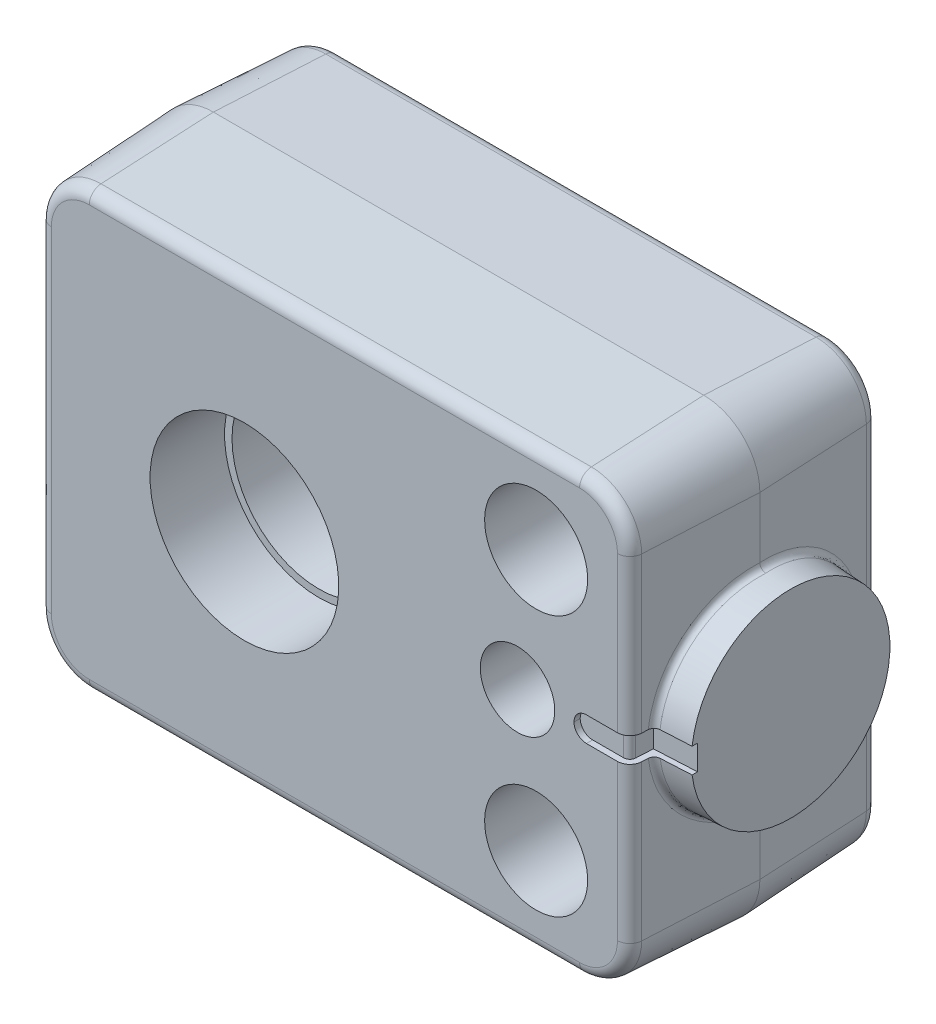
ISO-10303-21;
HEADER;
FILE_DESCRIPTION(('STEP AP214'),'2;1');
FILE_NAME('part.step','',(''),(''),'','','');
FILE_SCHEMA(('AUTOMOTIVE_DESIGN { 1 0 10303 214 1 1 1 1 }'));
ENDSEC;
DATA;
#1=APPLICATION_CONTEXT('core data for automotive mechanical design processes');
#2=APPLICATION_PROTOCOL_DEFINITION('international standard','automotive_design',2000,#1);
#3=PRODUCT_CONTEXT('',#1,'mechanical');
#4=PRODUCT('Part','Part','',(#3));
#5=PRODUCT_RELATED_PRODUCT_CATEGORY('part','',(#4));
#6=PRODUCT_DEFINITION_FORMATION('','',#4);
#7=PRODUCT_DEFINITION_CONTEXT('part definition',#1,'design');
#8=PRODUCT_DEFINITION('design','',#6,#7);
#9=PRODUCT_DEFINITION_SHAPE('','',#8);
#10=(LENGTH_UNIT() NAMED_UNIT(*) SI_UNIT(.MILLI.,.METRE.));
#11=(NAMED_UNIT(*) PLANE_ANGLE_UNIT() SI_UNIT($,.RADIAN.));
#12=(NAMED_UNIT(*) SI_UNIT($,.STERADIAN.) SOLID_ANGLE_UNIT());
#13=UNCERTAINTY_MEASURE_WITH_UNIT(LENGTH_MEASURE(1.E-05),#10,'distance_accuracy_value','');
#14=(GEOMETRIC_REPRESENTATION_CONTEXT(3) GLOBAL_UNCERTAINTY_ASSIGNED_CONTEXT((#13)) GLOBAL_UNIT_ASSIGNED_CONTEXT((#10,
#11,#12)) REPRESENTATION_CONTEXT('',''));
#15=CARTESIAN_POINT('',(0.,0.,0.));
#16=DIRECTION('',(0.,0.,1.));
#17=DIRECTION('',(1.,0.,0.));
#18=AXIS2_PLACEMENT_3D('',#15,#16,#17);
#19=CARTESIAN_POINT('',(-16.5,-17.5,0.));
#20=DIRECTION('',(0.,0.,-1.));
#21=DIRECTION('',(0.,1.,0.));
#22=AXIS2_PLACEMENT_3D('',#19,#20,#21);
#23=PLANE('',#22);
#24=CARTESIAN_POINT('',(23.5,-10.5,0.));
#25=DIRECTION('',(0.,0.,1.));
#26=DIRECTION('',(0.,-1.,0.));
#27=AXIS2_PLACEMENT_3D('',#24,#25,#26);
#28=CIRCLE('',#27,2.3);
#29=CARTESIAN_POINT('',(23.5,-12.8,0.));
#30=VERTEX_POINT('',#29);
#31=EDGE_CURVE('E306',#30,#30,#28,.T.);
#32=ORIENTED_EDGE('',*,*,#31,.T.);
#33=EDGE_LOOP('',(#32));
#34=FACE_BOUND('',#33,.T.);
#35=DIRECTION('',(1.,0.,0.));
#36=VECTOR('',#35,1.);
#37=CARTESIAN_POINT('',(-16.5,-16.5510354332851,0.));
#38=LINE('',#37,#36);
#39=CARTESIAN_POINT('',(27.,-16.5510354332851,0.));
#40=VERTEX_POINT('',#39);
#41=CARTESIAN_POINT('',(-12.5,-16.5510354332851,0.));
#42=VERTEX_POINT('',#41);
#43=EDGE_CURVE('E246',#40,#42,#38,.F.);
#44=ORIENTED_EDGE('',*,*,#43,.T.);
#45=CARTESIAN_POINT('',(-12.5,-13.5,0.));
#46=DIRECTION('',(0.,0.,-1.));
#47=DIRECTION('',(0.,1.,0.));
#48=AXIS2_PLACEMENT_3D('',#45,#46,#47);
#49=CIRCLE('',#48,3.05103543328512);
#50=CARTESIAN_POINT('',(-15.5510354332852,-13.5,0.));
#51=VERTEX_POINT('',#50);
#52=EDGE_CURVE('E285',#42,#51,#49,.T.);
#53=ORIENTED_EDGE('',*,*,#52,.T.);
#54=DIRECTION('',(0.,-1.,0.));
#55=VECTOR('',#54,1.);
#56=CARTESIAN_POINT('',(-15.5510354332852,-17.5,0.));
#57=LINE('',#56,#55);
#58=CARTESIAN_POINT('',(-15.5510354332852,13.5,0.));
#59=VERTEX_POINT('',#58);
#60=EDGE_CURVE('E283',#51,#59,#57,.F.);
#61=ORIENTED_EDGE('',*,*,#60,.T.);
#62=CARTESIAN_POINT('',(-12.5,13.5,0.));
#63=DIRECTION('',(0.,0.,-1.));
#64=DIRECTION('',(0.,1.,0.));
#65=AXIS2_PLACEMENT_3D('',#62,#63,#64);
#66=CIRCLE('',#65,3.05103543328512);
#67=CARTESIAN_POINT('',(-12.5,16.5510354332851,0.));
#68=VERTEX_POINT('',#67);
#69=EDGE_CURVE('E281',#59,#68,#66,.T.);
#70=ORIENTED_EDGE('',*,*,#69,.T.);
#71=DIRECTION('',(-1.,0.,0.));
#72=VECTOR('',#71,1.);
#73=CARTESIAN_POINT('',(-16.5,16.5510354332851,0.));
#74=LINE('',#73,#72);
#75=CARTESIAN_POINT('',(27.,16.5510354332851,0.));
#76=VERTEX_POINT('',#75);
#77=EDGE_CURVE('E279',#68,#76,#74,.F.);
#78=ORIENTED_EDGE('',*,*,#77,.T.);
#79=CARTESIAN_POINT('',(27.,13.5,0.));
#80=DIRECTION('',(0.,0.,-1.));
#81=DIRECTION('',(0.,1.,0.));
#82=AXIS2_PLACEMENT_3D('',#79,#80,#81);
#83=CIRCLE('',#82,3.05103543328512);
#84=CARTESIAN_POINT('',(30.0510354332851,13.5,0.));
#85=VERTEX_POINT('',#84);
#86=EDGE_CURVE('E277',#76,#85,#83,.T.);
#87=ORIENTED_EDGE('',*,*,#86,.T.);
#88=DIRECTION('',(0.,1.,0.));
#89=VECTOR('',#88,1.);
#90=CARTESIAN_POINT('',(30.0510354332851,-17.5,0.));
#91=LINE('',#90,#89);
#92=CARTESIAN_POINT('',(30.0510354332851,-13.5,0.));
#93=VERTEX_POINT('',#92);
#94=EDGE_CURVE('E249',#85,#93,#91,.F.);
#95=ORIENTED_EDGE('',*,*,#94,.T.);
#96=CARTESIAN_POINT('',(27.,-13.5,0.));
#97=DIRECTION('',(0.,0.,-1.));
#98=DIRECTION('',(0.,1.,0.));
#99=AXIS2_PLACEMENT_3D('',#96,#97,#98);
#100=CIRCLE('',#99,3.05103543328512);
#101=EDGE_CURVE('E241',#93,#40,#100,.T.);
#102=ORIENTED_EDGE('',*,*,#101,.T.);
#103=EDGE_LOOP('',(#44,#53,#61,#70,#78,#87,#95,#102));
#104=FACE_BOUND('',#103,.T.);
#105=CARTESIAN_POINT('',(23.5,10.5,0.));
#106=DIRECTION('',(0.,0.,1.));
#107=DIRECTION('',(0.,-1.,0.));
#108=AXIS2_PLACEMENT_3D('',#105,#106,#107);
#109=CIRCLE('',#108,2.3);
#110=CARTESIAN_POINT('',(23.5,8.2,0.));
#111=VERTEX_POINT('',#110);
#112=EDGE_CURVE('E843',#111,#111,#109,.T.);
#113=ORIENTED_EDGE('',*,*,#112,.T.);
#114=EDGE_LOOP('',(#113));
#115=FACE_BOUND('',#114,.T.);
#116=CARTESIAN_POINT('',(0.,0.,0.));
#117=DIRECTION('',(0.,0.,1.));
#118=DIRECTION('',(0.,-1.,0.));
#119=AXIS2_PLACEMENT_3D('',#116,#117,#118);
#120=CIRCLE('',#119,7.6);
#121=CARTESIAN_POINT('',(0.,-7.6,0.));
#122=VERTEX_POINT('',#121);
#123=EDGE_CURVE('E862',#122,#122,#120,.T.);
#124=ORIENTED_EDGE('',*,*,#123,.T.);
#125=EDGE_LOOP('',(#124));
#126=FACE_BOUND('',#125,.T.);
#127=ADVANCED_FACE('F16',(#34,#104,#115,#126),#23,.T.);
#128=CARTESIAN_POINT('',(27.55,0.,12.4957615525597));
#129=DIRECTION('',(0.,0.,1.));
#130=DIRECTION('',(0.,-1.,0.));
#131=AXIS2_PLACEMENT_3D('',#128,#129,#130);
#132=CYLINDRICAL_SURFACE('',#131,1.);
#133=DIRECTION('',(0.,0.,1.));
#134=VECTOR('',#133,1.);
#135=CARTESIAN_POINT('',(27.55,1.,12.4957615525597));
#136=LINE('',#135,#134);
#137=CARTESIAN_POINT('',(27.55,1.,20.));
#138=VERTEX_POINT('',#137);
#139=CARTESIAN_POINT('',(27.55,1.,19.5));
#140=VERTEX_POINT('',#139);
#141=EDGE_CURVE('E705',#138,#140,#136,.F.);
#142=ORIENTED_EDGE('',*,*,#141,.F.);
#143=CARTESIAN_POINT('',(27.55,0.,20.));
#144=DIRECTION('',(0.,0.,-1.));
#145=DIRECTION('',(0.,1.,0.));
#146=AXIS2_PLACEMENT_3D('',#143,#144,#145);
#147=CIRCLE('',#146,1.);
#148=CARTESIAN_POINT('',(26.55,0.,20.));
#149=VERTEX_POINT('',#148);
#150=EDGE_CURVE('E550',#138,#149,#147,.F.);
#151=ORIENTED_EDGE('',*,*,#150,.T.);
#152=DIRECTION('',(0.,0.,1.));
#153=VECTOR('',#152,1.);
#154=CARTESIAN_POINT('',(26.55,0.,12.4957615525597));
#155=LINE('',#154,#153);
#156=CARTESIAN_POINT('',(26.55,0.,19.5));
#157=VERTEX_POINT('',#156);
#158=EDGE_CURVE('E698',#149,#157,#155,.F.);
#159=ORIENTED_EDGE('',*,*,#158,.T.);
#160=CARTESIAN_POINT('',(27.55,0.,19.5));
#161=DIRECTION('',(0.,0.,1.));
#162=DIRECTION('',(-1.,0.,0.));
#163=AXIS2_PLACEMENT_3D('',#160,#161,#162);
#164=CIRCLE('',#163,1.);
#165=EDGE_CURVE('E707',#140,#157,#164,.T.);
#166=ORIENTED_EDGE('',*,*,#165,.F.);
#167=EDGE_LOOP('',(#142,#151,#159,#166));
#168=FACE_BOUND('',#167,.T.);
#169=ADVANCED_FACE('F493',(#168),#132,.F.);
#170=CARTESIAN_POINT('',(27.55,0.,12.4957615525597));
#171=DIRECTION('',(0.,0.,-1.));
#172=DIRECTION('',(0.,1.,0.));
#173=AXIS2_PLACEMENT_3D('',#170,#171,#172);
#174=CYLINDRICAL_SURFACE('',#173,1.);
#175=DIRECTION('',(0.,0.,1.));
#176=VECTOR('',#175,1.);
#177=CARTESIAN_POINT('',(27.55,-1.,12.4957615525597));
#178=LINE('',#177,#176);
#179=CARTESIAN_POINT('',(27.55,-1.,19.5));
#180=VERTEX_POINT('',#179);
#181=CARTESIAN_POINT('',(27.55,-1.,20.));
#182=VERTEX_POINT('',#181);
#183=EDGE_CURVE('E695',#180,#182,#178,.T.);
#184=ORIENTED_EDGE('',*,*,#183,.F.);
#185=CARTESIAN_POINT('',(27.55,0.,19.5));
#186=DIRECTION('',(0.,0.,1.));
#187=DIRECTION('',(-1.,0.,0.));
#188=AXIS2_PLACEMENT_3D('',#185,#186,#187);
#189=CIRCLE('',#188,1.);
#190=EDGE_CURVE('E701',#157,#180,#189,.T.);
#191=ORIENTED_EDGE('',*,*,#190,.F.);
#192=ORIENTED_EDGE('',*,*,#158,.F.);
#193=CARTESIAN_POINT('',(27.55,0.,20.));
#194=DIRECTION('',(0.,0.,-1.));
#195=DIRECTION('',(0.,1.,0.));
#196=AXIS2_PLACEMENT_3D('',#193,#194,#195);
#197=CIRCLE('',#196,1.);
#198=EDGE_CURVE('E703',#149,#182,#197,.F.);
#199=ORIENTED_EDGE('',*,*,#198,.T.);
#200=EDGE_LOOP('',(#184,#191,#192,#199));
#201=FACE_BOUND('',#200,.T.);
#202=ADVANCED_FACE('F500',(#201),#174,.F.);
#203=CARTESIAN_POINT('',(31.,17.5,20.));
#204=DIRECTION('',(0.998629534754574,0.,0.052335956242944));
#205=DIRECTION('',(-0.052335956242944,0.,0.998629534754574));
#206=AXIS2_PLACEMENT_3D('',#203,#204,#205);
#207=PLANE('',#206);
#208=DIRECTION('',(-0.0523359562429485,0.,0.998629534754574));
#209=VECTOR('',#208,1.);
#210=CARTESIAN_POINT('',(31.3902174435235,1.,12.5542076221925));
#211=LINE('',#210,#209);
#212=CARTESIAN_POINT('',(31.0763358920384,1.,18.5434244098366));
#213=VERTEX_POINT('',#212);
#214=CARTESIAN_POINT('',(31.0496649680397,1.,19.0523359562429));
#215=VERTEX_POINT('',#214);
#216=EDGE_CURVE('E375',#213,#215,#211,.T.);
#217=ORIENTED_EDGE('',*,*,#216,.F.);
#218=CARTESIAN_POINT('',(31.5242106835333,0.,9.99746429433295));
#219=DIRECTION('',(0.998629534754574,0.,0.052335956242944));
#220=DIRECTION('',(-0.0523359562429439,0.,0.998629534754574));
#221=AXIS2_PLACEMENT_3D('',#218,#219,#220);
#222=ELLIPSE('',#221,8.61607684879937,8.60423636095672);
#223=CARTESIAN_POINT('',(31.5240777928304,8.60423598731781,10.));
#224=VERTEX_POINT('',#223);
#225=EDGE_CURVE('E537',#213,#224,#222,.F.);
#226=ORIENTED_EDGE('',*,*,#225,.T.);
#227=DIRECTION('',(0.,1.,0.));
#228=VECTOR('',#227,1.);
#229=CARTESIAN_POINT('',(31.5240777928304,17.5,10.));
#230=LINE('',#229,#228);
#231=CARTESIAN_POINT('',(31.5240777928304,13.5,10.));
#232=VERTEX_POINT('',#231);
#233=EDGE_CURVE('E527',#224,#232,#230,.T.);
#234=ORIENTED_EDGE('',*,*,#233,.T.);
#235=DIRECTION('',(0.0523359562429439,0.,-0.998629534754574));
#236=VECTOR('',#235,1.);
#237=CARTESIAN_POINT('',(31.,13.5,20.));
#238=LINE('',#237,#236);
#239=CARTESIAN_POINT('',(31.0496649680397,13.5,19.0523359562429));
#240=VERTEX_POINT('',#239);
#241=EDGE_CURVE('E637',#232,#240,#238,.F.);
#242=ORIENTED_EDGE('',*,*,#241,.T.);
#243=DIRECTION('',(0.,1.,0.));
#244=VECTOR('',#243,1.);
#245=CARTESIAN_POINT('',(31.0496649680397,17.5,19.0523359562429));
#246=LINE('',#245,#244);
#247=EDGE_CURVE('E666',#240,#215,#246,.F.);
#248=ORIENTED_EDGE('',*,*,#247,.T.);
#249=EDGE_LOOP('',(#217,#226,#234,#242,#248));
#250=FACE_BOUND('',#249,.T.);
#251=ADVANCED_FACE('F463',(#250),#207,.T.);
#252=CARTESIAN_POINT('',(-16.5,-17.5,20.));
#253=DIRECTION('',(0.,0.,-1.));
#254=DIRECTION('',(0.,1.,0.));
#255=AXIS2_PLACEMENT_3D('',#252,#253,#254);
#256=PLANE('',#255);
#257=CARTESIAN_POINT('',(22.,0.,20.));
#258=DIRECTION('',(0.,0.,1.));
#259=DIRECTION('',(0.,-1.,0.));
#260=AXIS2_PLACEMENT_3D('',#257,#258,#259);
#261=CIRCLE('',#260,3.);
#262=CARTESIAN_POINT('',(22.,-3.,20.));
#263=VERTEX_POINT('',#262);
#264=EDGE_CURVE('E868',#263,#263,#261,.T.);
#265=ORIENTED_EDGE('',*,*,#264,.F.);
#266=EDGE_LOOP('',(#265));
#267=FACE_BOUND('',#266,.T.);
#268=CARTESIAN_POINT('',(0.,0.,20.));
#269=DIRECTION('',(0.,0.,1.));
#270=DIRECTION('',(0.,-1.,0.));
#271=AXIS2_PLACEMENT_3D('',#268,#269,#270);
#272=CIRCLE('',#271,7.6);
#273=CARTESIAN_POINT('',(0.,-7.6,20.));
#274=VERTEX_POINT('',#273);
#275=EDGE_CURVE('E856',#274,#274,#272,.T.);
#276=ORIENTED_EDGE('',*,*,#275,.F.);
#277=EDGE_LOOP('',(#276));
#278=FACE_BOUND('',#277,.T.);
#279=CARTESIAN_POINT('',(23.5,10.5,20.));
#280=DIRECTION('',(0.,0.,1.));
#281=DIRECTION('',(0.,-1.,0.));
#282=AXIS2_PLACEMENT_3D('',#279,#280,#281);
#283=CIRCLE('',#282,4.15);
#284=CARTESIAN_POINT('',(23.5,6.35,20.));
#285=VERTEX_POINT('',#284);
#286=EDGE_CURVE('E852',#285,#285,#283,.T.);
#287=ORIENTED_EDGE('',*,*,#286,.F.);
#288=EDGE_LOOP('',(#287));
#289=FACE_BOUND('',#288,.T.);
#290=CARTESIAN_POINT('',(23.5,-10.5,20.));
#291=DIRECTION('',(0.,0.,1.));
#292=DIRECTION('',(0.,-1.,0.));
#293=AXIS2_PLACEMENT_3D('',#290,#291,#292);
#294=CIRCLE('',#293,4.15);
#295=CARTESIAN_POINT('',(23.5,-14.65,20.));
#296=VERTEX_POINT('',#295);
#297=EDGE_CURVE('E840',#296,#296,#294,.T.);
#298=ORIENTED_EDGE('',*,*,#297,.F.);
#299=EDGE_LOOP('',(#298));
#300=FACE_BOUND('',#299,.T.);
#301=DIRECTION('',(-1.,0.,0.));
#302=VECTOR('',#301,1.);
#303=CARTESIAN_POINT('',(30.275,1.,20.));
#304=LINE('',#303,#302);
#305=CARTESIAN_POINT('',(30.0510354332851,1.,20.));
#306=VERTEX_POINT('',#305);
#307=EDGE_CURVE('E379',#306,#138,#304,.T.);
#308=ORIENTED_EDGE('',*,*,#307,.F.);
#309=DIRECTION('',(0.,-1.,0.));
#310=VECTOR('',#309,1.);
#311=CARTESIAN_POINT('',(30.0510354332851,-17.5,20.));
#312=LINE('',#311,#310);
#313=CARTESIAN_POINT('',(30.0510354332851,13.5,20.));
#314=VERTEX_POINT('',#313);
#315=EDGE_CURVE('E647',#306,#314,#312,.F.);
#316=ORIENTED_EDGE('',*,*,#315,.T.);
#317=CARTESIAN_POINT('',(27.,13.5,20.));
#318=DIRECTION('',(0.,0.,-1.));
#319=DIRECTION('',(0.,1.,0.));
#320=AXIS2_PLACEMENT_3D('',#317,#318,#319);
#321=CIRCLE('',#320,3.05103543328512);
#322=CARTESIAN_POINT('',(27.,16.5510354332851,20.));
#323=VERTEX_POINT('',#322);
#324=EDGE_CURVE('E651',#314,#323,#321,.F.);
#325=ORIENTED_EDGE('',*,*,#324,.T.);
#326=DIRECTION('',(1.,0.,0.));
#327=VECTOR('',#326,1.);
#328=CARTESIAN_POINT('',(-16.5,16.5510354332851,20.));
#329=LINE('',#328,#327);
#330=CARTESIAN_POINT('',(-12.5,16.5510354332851,20.));
#331=VERTEX_POINT('',#330);
#332=EDGE_CURVE('E653',#323,#331,#329,.F.);
#333=ORIENTED_EDGE('',*,*,#332,.T.);
#334=CARTESIAN_POINT('',(-12.5,13.5,20.));
#335=DIRECTION('',(0.,0.,-1.));
#336=DIRECTION('',(0.,1.,0.));
#337=AXIS2_PLACEMENT_3D('',#334,#335,#336);
#338=CIRCLE('',#337,3.05103543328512);
#339=CARTESIAN_POINT('',(-15.5510354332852,13.5,20.));
#340=VERTEX_POINT('',#339);
#341=EDGE_CURVE('E655',#331,#340,#338,.F.);
#342=ORIENTED_EDGE('',*,*,#341,.T.);
#343=DIRECTION('',(0.,1.,0.));
#344=VECTOR('',#343,1.);
#345=CARTESIAN_POINT('',(-15.5510354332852,-17.5,20.));
#346=LINE('',#345,#344);
#347=CARTESIAN_POINT('',(-15.5510354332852,-13.5,20.));
#348=VERTEX_POINT('',#347);
#349=EDGE_CURVE('E657',#340,#348,#346,.F.);
#350=ORIENTED_EDGE('',*,*,#349,.T.);
#351=CARTESIAN_POINT('',(-12.5,-13.5,20.));
#352=DIRECTION('',(0.,0.,-1.));
#353=DIRECTION('',(0.,1.,0.));
#354=AXIS2_PLACEMENT_3D('',#351,#352,#353);
#355=CIRCLE('',#354,3.05103543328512);
#356=CARTESIAN_POINT('',(-12.5,-16.5510354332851,20.));
#357=VERTEX_POINT('',#356);
#358=EDGE_CURVE('E602',#348,#357,#355,.F.);
#359=ORIENTED_EDGE('',*,*,#358,.T.);
#360=DIRECTION('',(-1.,0.,0.));
#361=VECTOR('',#360,1.);
#362=CARTESIAN_POINT('',(-16.5,-16.5510354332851,20.));
#363=LINE('',#362,#361);
#364=CARTESIAN_POINT('',(27.,-16.5510354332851,20.));
#365=VERTEX_POINT('',#364);
#366=EDGE_CURVE('E643',#357,#365,#363,.F.);
#367=ORIENTED_EDGE('',*,*,#366,.T.);
#368=CARTESIAN_POINT('',(27.,-13.5,20.));
#369=DIRECTION('',(0.,0.,-1.));
#370=DIRECTION('',(0.,1.,0.));
#371=AXIS2_PLACEMENT_3D('',#368,#369,#370);
#372=CIRCLE('',#371,3.05103543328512);
#373=CARTESIAN_POINT('',(30.0510354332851,-13.5,20.));
#374=VERTEX_POINT('',#373);
#375=EDGE_CURVE('E645',#365,#374,#372,.F.);
#376=ORIENTED_EDGE('',*,*,#375,.T.);
#377=CARTESIAN_POINT('',(30.0510354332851,-1.,20.));
#378=VERTEX_POINT('',#377);
#379=EDGE_CURVE('E648',#374,#378,#312,.F.);
#380=ORIENTED_EDGE('',*,*,#379,.T.);
#381=DIRECTION('',(-1.,0.,0.));
#382=VECTOR('',#381,1.);
#383=CARTESIAN_POINT('',(30.275,-1.,20.));
#384=LINE('',#383,#382);
#385=EDGE_CURVE('E396',#378,#182,#384,.T.);
#386=ORIENTED_EDGE('',*,*,#385,.T.);
#387=ORIENTED_EDGE('',*,*,#198,.F.);
#388=ORIENTED_EDGE('',*,*,#150,.F.);
#389=EDGE_LOOP('',(#308,#316,#325,#333,#342,#350,#359,#367,#376,#380,#386,#387,#388));
#390=FACE_BOUND('',#389,.T.);
#391=ADVANCED_FACE('F715',(#267,#278,#289,#300,#390),#256,.F.);
#392=CARTESIAN_POINT('',(30.0510354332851,-17.5,19.));
#393=DIRECTION('',(0.,-1.,0.));
#394=DIRECTION('',(0.,0.,-1.));
#395=AXIS2_PLACEMENT_3D('',#392,#393,#394);
#396=CYLINDRICAL_SURFACE('',#395,1.);
#397=ORIENTED_EDGE('',*,*,#315,.F.);
#398=CARTESIAN_POINT('',(30.0510354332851,1.,19.));
#399=DIRECTION('',(0.,-1.,0.));
#400=DIRECTION('',(0.,0.,-1.));
#401=AXIS2_PLACEMENT_3D('',#398,#399,#400);
#402=CIRCLE('',#401,1.);
#403=EDGE_CURVE('E377',#215,#306,#402,.T.);
#404=ORIENTED_EDGE('',*,*,#403,.F.);
#405=ORIENTED_EDGE('',*,*,#247,.F.);
#406=CARTESIAN_POINT('',(30.0510354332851,13.5,19.));
#407=DIRECTION('',(0.,-1.,0.));
#408=DIRECTION('',(0.,0.,-1.));
#409=AXIS2_PLACEMENT_3D('',#406,#407,#408);
#410=CIRCLE('',#409,1.);
#411=EDGE_CURVE('E685',#240,#314,#410,.T.);
#412=ORIENTED_EDGE('',*,*,#411,.T.);
#413=EDGE_LOOP('',(#397,#404,#405,#412));
#414=FACE_BOUND('',#413,.T.);
#415=ADVANCED_FACE('F570',(#414),#396,.T.);
#416=CARTESIAN_POINT('',(34.,3.13139604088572,10.));
#417=DIRECTION('',(-1.,0.,0.));
#418=DIRECTION('',(0.,0.,-1.));
#419=AXIS2_PLACEMENT_3D('',#416,#417,#418);
#420=PLANE('',#419);
#421=DIRECTION('',(0.,0.,1.));
#422=VECTOR('',#421,1.);
#423=CARTESIAN_POINT('',(34.,1.,10.));
#424=LINE('',#423,#422);
#425=CARTESIAN_POINT('',(34.,1.,17.499313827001));
#426=VERTEX_POINT('',#425);
#427=CARTESIAN_POINT('',(34.,1.,17.9372539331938));
#428=VERTEX_POINT('',#427);
#429=EDGE_CURVE('E692',#426,#428,#424,.T.);
#430=ORIENTED_EDGE('',*,*,#429,.F.);
#431=DIRECTION('',(0.,-1.,0.));
#432=VECTOR('',#431,1.);
#433=CARTESIAN_POINT('',(34.,1.,17.499313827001));
#434=LINE('',#433,#432);
#435=CARTESIAN_POINT('',(34.,-1.,17.499313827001));
#436=VERTEX_POINT('',#435);
#437=EDGE_CURVE('E405',#426,#436,#434,.T.);
#438=ORIENTED_EDGE('',*,*,#437,.T.);
#439=DIRECTION('',(0.,0.,1.));
#440=VECTOR('',#439,1.);
#441=CARTESIAN_POINT('',(34.,-1.,10.));
#442=LINE('',#441,#440);
#443=CARTESIAN_POINT('',(34.,-1.,17.9372539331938));
#444=VERTEX_POINT('',#443);
#445=EDGE_CURVE('E673',#436,#444,#442,.T.);
#446=ORIENTED_EDGE('',*,*,#445,.T.);
#447=CARTESIAN_POINT('',(34.,0.,10.));
#448=DIRECTION('',(-1.,0.,0.));
#449=DIRECTION('',(0.,0.,-1.));
#450=AXIS2_PLACEMENT_3D('',#447,#448,#449);
#451=CIRCLE('',#450,8.);
#452=EDGE_CURVE('E624',#428,#444,#451,.T.);
#453=ORIENTED_EDGE('',*,*,#452,.F.);
#454=EDGE_LOOP('',(#430,#438,#446,#453));
#455=FACE_BOUND('',#454,.T.);
#456=ADVANCED_FACE('F462',(#455),#420,.F.);
#457=CARTESIAN_POINT('',(31.5240777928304,-13.5,10.));
#458=VERTEX_POINT('',#457);
#459=CARTESIAN_POINT('',(31.5240777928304,-8.60423598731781,10.));
#460=VERTEX_POINT('',#459);
#461=EDGE_CURVE('E524',#458,#460,#230,.T.);
#462=ORIENTED_EDGE('',*,*,#461,.T.);
#463=CARTESIAN_POINT('',(31.5242106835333,0.,9.99746429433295));
#464=DIRECTION('',(0.998629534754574,0.,0.052335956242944));
#465=DIRECTION('',(-0.0523359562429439,0.,0.998629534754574));
#466=AXIS2_PLACEMENT_3D('',#463,#464,#465);
#467=ELLIPSE('',#466,8.61607684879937,8.60423636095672);
#468=CARTESIAN_POINT('',(31.0763358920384,-1.,18.5434244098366));
#469=VERTEX_POINT('',#468);
#470=EDGE_CURVE('E36',#460,#469,#467,.F.);
#471=ORIENTED_EDGE('',*,*,#470,.T.);
#472=DIRECTION('',(0.052335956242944,0.,-0.998629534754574));
#473=VECTOR('',#472,1.);
#474=CARTESIAN_POINT('',(31.,-1.,20.));
#475=LINE('',#474,#473);
#476=CARTESIAN_POINT('',(31.0496649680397,-1.,19.0523359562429));
#477=VERTEX_POINT('',#476);
#478=EDGE_CURVE('E419',#469,#477,#475,.F.);
#479=ORIENTED_EDGE('',*,*,#478,.T.);
#480=CARTESIAN_POINT('',(31.0496649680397,-13.5,19.0523359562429));
#481=VERTEX_POINT('',#480);
#482=EDGE_CURVE('E665',#477,#481,#246,.F.);
#483=ORIENTED_EDGE('',*,*,#482,.T.);
#484=DIRECTION('',(0.0523359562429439,0.,-0.998629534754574));
#485=VECTOR('',#484,1.);
#486=CARTESIAN_POINT('',(31.,-13.5,20.));
#487=LINE('',#486,#485);
#488=EDGE_CURVE('E640',#481,#458,#487,.T.);
#489=ORIENTED_EDGE('',*,*,#488,.T.);
#490=EDGE_LOOP('',(#462,#471,#479,#483,#489));
#491=FACE_BOUND('',#490,.T.);
#492=ADVANCED_FACE('F456',(#491),#207,.T.);
#493=CARTESIAN_POINT('',(31.,-17.5,20.));
#494=DIRECTION('',(0.,-0.998629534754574,0.052335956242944));
#495=DIRECTION('',(0.,-0.052335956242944,-0.998629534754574));
#496=AXIS2_PLACEMENT_3D('',#493,#494,#495);
#497=PLANE('',#496);
#498=DIRECTION('',(0.,-0.0523359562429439,-0.998629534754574));
#499=VECTOR('',#498,1.);
#500=CARTESIAN_POINT('',(27.,-17.5,20.));
#501=LINE('',#500,#499);
#502=CARTESIAN_POINT('',(27.,-18.0240777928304,10.));
#503=VERTEX_POINT('',#502);
#504=CARTESIAN_POINT('',(27.,-17.5496649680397,19.0523359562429));
#505=VERTEX_POINT('',#504);
#506=EDGE_CURVE('E636',#503,#505,#501,.F.);
#507=ORIENTED_EDGE('',*,*,#506,.T.);
#508=DIRECTION('',(1.,0.,0.));
#509=VECTOR('',#508,1.);
#510=CARTESIAN_POINT('',(31.,-17.5496649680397,19.0523359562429));
#511=LINE('',#510,#509);
#512=CARTESIAN_POINT('',(-12.5,-17.5496649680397,19.0523359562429));
#513=VERTEX_POINT('',#512);
#514=EDGE_CURVE('E671',#505,#513,#511,.F.);
#515=ORIENTED_EDGE('',*,*,#514,.T.);
#516=DIRECTION('',(0.,-0.0523359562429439,-0.998629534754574));
#517=VECTOR('',#516,1.);
#518=CARTESIAN_POINT('',(-12.5,-17.5,20.));
#519=LINE('',#518,#517);
#520=CARTESIAN_POINT('',(-12.5,-18.0240777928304,10.));
#521=VERTEX_POINT('',#520);
#522=EDGE_CURVE('E619',#513,#521,#519,.T.);
#523=ORIENTED_EDGE('',*,*,#522,.T.);
#524=DIRECTION('',(1.,0.,0.));
#525=VECTOR('',#524,1.);
#526=CARTESIAN_POINT('',(31.,-18.0240777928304,10.));
#527=LINE('',#526,#525);
#528=EDGE_CURVE('E320',#521,#503,#527,.T.);
#529=ORIENTED_EDGE('',*,*,#528,.T.);
#530=EDGE_LOOP('',(#507,#515,#523,#529));
#531=FACE_BOUND('',#530,.T.);
#532=ADVANCED_FACE('F461',(#531),#497,.T.);
#533=CARTESIAN_POINT('',(31.,17.5,20.));
#534=DIRECTION('',(0.,0.998629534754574,0.052335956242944));
#535=DIRECTION('',(0.,-0.052335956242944,0.998629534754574));
#536=AXIS2_PLACEMENT_3D('',#533,#534,#535);
#537=PLANE('',#536);
#538=DIRECTION('',(0.,0.0523359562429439,-0.998629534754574));
#539=VECTOR('',#538,1.);
#540=CARTESIAN_POINT('',(-12.5,17.5,20.));
#541=LINE('',#540,#539);
#542=CARTESIAN_POINT('',(-12.5,18.0240777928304,10.));
#543=VERTEX_POINT('',#542);
#544=CARTESIAN_POINT('',(-12.5,17.5496649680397,19.0523359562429));
#545=VERTEX_POINT('',#544);
#546=EDGE_CURVE('E633',#543,#545,#541,.F.);
#547=ORIENTED_EDGE('',*,*,#546,.T.);
#548=DIRECTION('',(-1.,0.,0.));
#549=VECTOR('',#548,1.);
#550=CARTESIAN_POINT('',(31.,17.5496649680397,19.0523359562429));
#551=LINE('',#550,#549);
#552=CARTESIAN_POINT('',(27.,17.5496649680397,19.0523359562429));
#553=VERTEX_POINT('',#552);
#554=EDGE_CURVE('E661',#545,#553,#551,.F.);
#555=ORIENTED_EDGE('',*,*,#554,.T.);
#556=DIRECTION('',(0.,0.0523359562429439,-0.998629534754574));
#557=VECTOR('',#556,1.);
#558=CARTESIAN_POINT('',(27.,17.5,20.));
#559=LINE('',#558,#557);
#560=CARTESIAN_POINT('',(27.,18.0240777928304,10.));
#561=VERTEX_POINT('',#560);
#562=EDGE_CURVE('E626',#553,#561,#559,.T.);
#563=ORIENTED_EDGE('',*,*,#562,.T.);
#564=DIRECTION('',(-1.,0.,0.));
#565=VECTOR('',#564,1.);
#566=CARTESIAN_POINT('',(31.,18.0240777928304,10.));
#567=LINE('',#566,#565);
#568=EDGE_CURVE('E775',#561,#543,#567,.T.);
#569=ORIENTED_EDGE('',*,*,#568,.T.);
#570=EDGE_LOOP('',(#547,#555,#563,#569));
#571=FACE_BOUND('',#570,.T.);
#572=ADVANCED_FACE('F465',(#571),#537,.T.);
#573=CARTESIAN_POINT('',(-16.5,-17.5,20.));
#574=DIRECTION('',(-0.998629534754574,0.,0.052335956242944));
#575=DIRECTION('',(-0.052335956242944,0.,-0.998629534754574));
#576=AXIS2_PLACEMENT_3D('',#573,#574,#575);
#577=PLANE('',#576);
#578=DIRECTION('',(-0.0523359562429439,0.,-0.998629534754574));
#579=VECTOR('',#578,1.);
#580=CARTESIAN_POINT('',(-16.5,-13.5,20.));
#581=LINE('',#580,#579);
#582=CARTESIAN_POINT('',(-17.0240777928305,-13.5,10.));
#583=VERTEX_POINT('',#582);
#584=CARTESIAN_POINT('',(-16.5496649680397,-13.5,19.0523359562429));
#585=VERTEX_POINT('',#584);
#586=EDGE_CURVE('E617',#583,#585,#581,.F.);
#587=ORIENTED_EDGE('',*,*,#586,.T.);
#588=DIRECTION('',(0.,-1.,0.));
#589=VECTOR('',#588,1.);
#590=CARTESIAN_POINT('',(-16.5496649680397,-17.5,19.0523359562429));
#591=LINE('',#590,#589);
#592=CARTESIAN_POINT('',(-16.5496649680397,13.5,19.0523359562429));
#593=VERTEX_POINT('',#592);
#594=EDGE_CURVE('E608',#585,#593,#591,.F.);
#595=ORIENTED_EDGE('',*,*,#594,.T.);
#596=DIRECTION('',(-0.0523359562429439,0.,-0.998629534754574));
#597=VECTOR('',#596,1.);
#598=CARTESIAN_POINT('',(-16.5,13.5,20.));
#599=LINE('',#598,#597);
#600=CARTESIAN_POINT('',(-17.0240777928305,13.5,10.));
#601=VERTEX_POINT('',#600);
#602=EDGE_CURVE('E623',#593,#601,#599,.T.);
#603=ORIENTED_EDGE('',*,*,#602,.T.);
#604=DIRECTION('',(0.,-1.,0.));
#605=VECTOR('',#604,1.);
#606=CARTESIAN_POINT('',(-17.0240777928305,-17.5,10.));
#607=LINE('',#606,#605);
#608=EDGE_CURVE('E622',#601,#583,#607,.T.);
#609=ORIENTED_EDGE('',*,*,#608,.T.);
#610=EDGE_LOOP('',(#587,#595,#603,#609));
#611=FACE_BOUND('',#610,.T.);
#612=ADVANCED_FACE('F469',(#611),#577,.T.);
#613=CARTESIAN_POINT('',(-12.5,13.5,20.));
#614=DIRECTION('',(0.,0.,-1.));
#615=DIRECTION('',(0.,1.,0.));
#616=AXIS2_PLACEMENT_3D('',#613,#614,#615);
#617=CONICAL_SURFACE('',#616,4.,0.05235987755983);
#618=ORIENTED_EDGE('',*,*,#602,.F.);
#619=CARTESIAN_POINT('',(-12.5,13.5,19.0523359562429));
#620=DIRECTION('',(0.,0.,-1.));
#621=DIRECTION('',(0.,1.,0.));
#622=AXIS2_PLACEMENT_3D('',#619,#620,#621);
#623=CIRCLE('',#622,4.04966496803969);
#624=EDGE_CURVE('E612',#593,#545,#623,.T.);
#625=ORIENTED_EDGE('',*,*,#624,.T.);
#626=ORIENTED_EDGE('',*,*,#546,.F.);
#627=CARTESIAN_POINT('',(-12.5,13.5,10.));
#628=DIRECTION('',(0.,0.,-1.));
#629=DIRECTION('',(0.,1.,0.));
#630=AXIS2_PLACEMENT_3D('',#627,#628,#629);
#631=CIRCLE('',#630,4.52407779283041);
#632=EDGE_CURVE('E778',#543,#601,#631,.F.);
#633=ORIENTED_EDGE('',*,*,#632,.T.);
#634=EDGE_LOOP('',(#618,#625,#626,#633));
#635=FACE_BOUND('',#634,.T.);
#636=ADVANCED_FACE('F475',(#635),#617,.T.);
#637=CARTESIAN_POINT('',(-12.5,-13.5,20.));
#638=DIRECTION('',(0.,0.,-1.));
#639=DIRECTION('',(0.,1.,0.));
#640=AXIS2_PLACEMENT_3D('',#637,#638,#639);
#641=CONICAL_SURFACE('',#640,4.,0.05235987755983);
#642=ORIENTED_EDGE('',*,*,#522,.F.);
#643=CARTESIAN_POINT('',(-12.5,-13.5,19.0523359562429));
#644=DIRECTION('',(0.,0.,-1.));
#645=DIRECTION('',(0.,1.,0.));
#646=AXIS2_PLACEMENT_3D('',#643,#644,#645);
#647=CIRCLE('',#646,4.04966496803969);
#648=EDGE_CURVE('E599',#513,#585,#647,.T.);
#649=ORIENTED_EDGE('',*,*,#648,.T.);
#650=ORIENTED_EDGE('',*,*,#586,.F.);
#651=CARTESIAN_POINT('',(-12.5,-13.5,10.));
#652=DIRECTION('',(0.,0.,-1.));
#653=DIRECTION('',(0.,1.,0.));
#654=AXIS2_PLACEMENT_3D('',#651,#652,#653);
#655=CIRCLE('',#654,4.52407779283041);
#656=EDGE_CURVE('E764',#583,#521,#655,.F.);
#657=ORIENTED_EDGE('',*,*,#656,.T.);
#658=EDGE_LOOP('',(#642,#649,#650,#657));
#659=FACE_BOUND('',#658,.T.);
#660=ADVANCED_FACE('F471',(#659),#641,.T.);
#661=CARTESIAN_POINT('',(27.,-13.5,20.));
#662=DIRECTION('',(0.,0.,-1.));
#663=DIRECTION('',(0.,1.,0.));
#664=AXIS2_PLACEMENT_3D('',#661,#662,#663);
#665=CONICAL_SURFACE('',#664,4.,0.05235987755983);
#666=ORIENTED_EDGE('',*,*,#488,.F.);
#667=CARTESIAN_POINT('',(27.,-13.5,19.0523359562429));
#668=DIRECTION('',(0.,0.,-1.));
#669=DIRECTION('',(0.,1.,0.));
#670=AXIS2_PLACEMENT_3D('',#667,#668,#669);
#671=CIRCLE('',#670,4.04966496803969);
#672=EDGE_CURVE('E669',#481,#505,#671,.T.);
#673=ORIENTED_EDGE('',*,*,#672,.T.);
#674=ORIENTED_EDGE('',*,*,#506,.F.);
#675=CARTESIAN_POINT('',(27.,-13.5,10.));
#676=DIRECTION('',(0.,0.,-1.));
#677=DIRECTION('',(0.,1.,0.));
#678=AXIS2_PLACEMENT_3D('',#675,#676,#677);
#679=CIRCLE('',#678,4.52407779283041);
#680=EDGE_CURVE('E755',#503,#458,#679,.F.);
#681=ORIENTED_EDGE('',*,*,#680,.T.);
#682=EDGE_LOOP('',(#666,#673,#674,#681));
#683=FACE_BOUND('',#682,.T.);
#684=ADVANCED_FACE('F474',(#683),#665,.T.);
#685=CARTESIAN_POINT('',(27.,13.5,20.));
#686=DIRECTION('',(0.,0.,-1.));
#687=DIRECTION('',(0.,1.,0.));
#688=AXIS2_PLACEMENT_3D('',#685,#686,#687);
#689=CONICAL_SURFACE('',#688,4.,0.05235987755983);
#690=ORIENTED_EDGE('',*,*,#562,.F.);
#691=CARTESIAN_POINT('',(27.,13.5,19.0523359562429));
#692=DIRECTION('',(0.,0.,-1.));
#693=DIRECTION('',(0.,1.,0.));
#694=AXIS2_PLACEMENT_3D('',#691,#692,#693);
#695=CIRCLE('',#694,4.04966496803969);
#696=EDGE_CURVE('E663',#553,#240,#695,.T.);
#697=ORIENTED_EDGE('',*,*,#696,.T.);
#698=ORIENTED_EDGE('',*,*,#241,.F.);
#699=CARTESIAN_POINT('',(27.,13.5,10.));
#700=DIRECTION('',(0.,0.,-1.));
#701=DIRECTION('',(0.,1.,0.));
#702=AXIS2_PLACEMENT_3D('',#699,#700,#701);
#703=CIRCLE('',#702,4.52407779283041);
#704=EDGE_CURVE('E767',#232,#561,#703,.F.);
#705=ORIENTED_EDGE('',*,*,#704,.T.);
#706=EDGE_LOOP('',(#690,#697,#698,#705));
#707=FACE_BOUND('',#706,.T.);
#708=ADVANCED_FACE('F477',(#707),#689,.T.);
#709=CARTESIAN_POINT('',(34.,0.,10.));
#710=DIRECTION('',(-1.,0.,0.));
#711=DIRECTION('',(0.,0.,-1.));
#712=AXIS2_PLACEMENT_3D('',#709,#710,#711);
#713=CONICAL_SURFACE('',#712,8.,0.052359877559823);
#714=CARTESIAN_POINT('',(37.0455675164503,-1.,17.7763547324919));
#715=CARTESIAN_POINT('',(35.1879401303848,-1.,17.8745084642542));
#716=CARTESIAN_POINT('',(33.3303113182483,-1.,17.9726351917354));
#717=CARTESIAN_POINT('',(29.6150508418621,-1.,18.1688346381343));
#718=CARTESIAN_POINT('',(27.7574191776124,-1.,18.2669073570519));
#719=CARTESIAN_POINT('',(25.8997860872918,-1.,18.3649530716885));
#720=B_SPLINE_CURVE_WITH_KNOTS('',3,(#714,#715,#716,#717,#718,#719),.UNSPECIFIED.,.F.,.F.,(4,2,
4),(0.,5.58065613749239,11.1613122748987),.UNSPECIFIED.);
#721=CARTESIAN_POINT('',(31.5498711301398,-1.,18.0666586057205));
#722=VERTEX_POINT('',#721);
#723=EDGE_CURVE('E404',#444,#722,#720,.T.);
#724=ORIENTED_EDGE('',*,*,#723,.T.);
#725=CARTESIAN_POINT('',(31.5464268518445,0.,18.1285863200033));
#726=CARTESIAN_POINT('',(31.0968418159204,0.,18.152148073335));
#727=CARTESIAN_POINT('',(31.0732800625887,0.,18.6017331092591));
#728=CARTESIAN_POINT('',(31.5464268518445,-0.353705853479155,18.1285863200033));
#729=CARTESIAN_POINT('',(31.0968418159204,-0.355761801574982,18.152148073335));
#730=CARTESIAN_POINT('',(31.0732800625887,-0.37543294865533,18.6017331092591));
#731=CARTESIAN_POINT('',(31.547716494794,-0.707411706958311,18.1053986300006));
#732=CARTESIAN_POINT('',(31.0980677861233,-0.711571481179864,18.128755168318));
#733=CARTESIAN_POINT('',(31.0745697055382,-0.750865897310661,18.577125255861));
#734=CARTESIAN_POINT('',(31.552852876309,-1.40876818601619,18.0130472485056));
#735=CARTESIAN_POINT('',(31.1029489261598,-1.41695771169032,18.0356174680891));
#736=CARTESIAN_POINT('',(31.0797060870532,-1.49530783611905,18.4791172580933));
#737=CARTESIAN_POINT('',(31.5566997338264,-1.75641852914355,17.9438814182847));
#738=CARTESIAN_POINT('',(31.1066055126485,-1.76662652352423,17.965845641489));
#739=CARTESIAN_POINT('',(31.0835529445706,-1.86431652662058,18.4057148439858));
#740=CARTESIAN_POINT('',(31.5668846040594,-2.43971316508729,17.7607605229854));
#741=CARTESIAN_POINT('',(31.1162829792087,-2.45370866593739,17.7811885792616));
#742=CARTESIAN_POINT('',(31.0937378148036,-2.58959653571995,18.2113759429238));
#743=CARTESIAN_POINT('',(31.5732228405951,-2.77535637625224,17.6468014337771));
#744=CARTESIAN_POINT('',(31.1223065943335,-2.79120402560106,17.6662511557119));
#745=CARTESIAN_POINT('',(31.1000760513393,-2.94586670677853,18.0904351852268));
#746=CARTESIAN_POINT('',(31.588281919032,-3.428892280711,17.3760475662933));
#747=CARTESIAN_POINT('',(31.1366122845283,-3.44813745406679,17.3932823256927));
#748=CARTESIAN_POINT('',(31.1151351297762,-3.63957476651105,17.8030908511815));
#749=CARTESIAN_POINT('',(31.5970030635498,-3.74678271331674,17.2192473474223));
#750=CARTESIAN_POINT('',(31.1448982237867,-3.76764132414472,17.2351771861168));
#751=CARTESIAN_POINT('',(31.123856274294,-3.97701025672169,17.6366815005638));
#752=CARTESIAN_POINT('',(31.6166786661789,-4.35937325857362,16.8654978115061));
#753=CARTESIAN_POINT('',(31.1635837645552,-4.38311160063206,16.8786358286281));
#754=CARTESIAN_POINT('',(31.1435318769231,-4.62727668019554,17.2612486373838));
#755=CARTESIAN_POINT('',(31.6276334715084,-4.6540697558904,16.6685422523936));
#756=CARTESIAN_POINT('',(31.1739880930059,-4.67912275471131,16.6801094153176));
#757=CARTESIAN_POINT('',(31.1544866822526,-4.94010377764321,17.052218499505));
#758=CARTESIAN_POINT('',(31.6515889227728,-5.21523029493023,16.2378554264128));
#759=CARTESIAN_POINT('',(31.1967292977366,-5.24254391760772,16.2461813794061));
#760=CARTESIAN_POINT('',(31.178442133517,-5.53580232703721,16.5951212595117));
#761=CARTESIAN_POINT('',(31.6645899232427,-5.48168943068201,16.0041177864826));
#762=CARTESIAN_POINT('',(31.2090714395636,-5.50997430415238,16.0106792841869));
#763=CARTESIAN_POINT('',(31.1914431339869,-5.81866857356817,16.3470473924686));
#764=CARTESIAN_POINT('',(31.6924153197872,-5.98181690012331,15.5038690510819));
#765=CARTESIAN_POINT('',(31.2354741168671,-6.01167368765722,15.5068861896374));
#766=CARTESIAN_POINT('',(31.2192685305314,-6.34960683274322,15.8161071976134));
#767=CARTESIAN_POINT('',(31.7072400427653,-6.21547933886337,15.2373520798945));
#768=CARTESIAN_POINT('',(31.2495400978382,-6.24593711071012,15.2384912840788));
#769=CARTESIAN_POINT('',(31.2340932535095,-6.59767259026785,15.5332346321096));
#770=CARTESIAN_POINT('',(31.7384592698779,-6.64601665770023,14.6761071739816));
#771=CARTESIAN_POINT('',(31.2791471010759,-6.67732329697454,14.6735560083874));
#772=CARTESIAN_POINT('',(31.2653124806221,-7.05476633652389,14.9375362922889));
#773=CARTESIAN_POINT('',(31.7548540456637,-6.8428851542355,14.3813743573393));
#774=CARTESIAN_POINT('',(31.2946933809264,-6.87441478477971,14.3769153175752));
#775=CARTESIAN_POINT('',(31.2817072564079,-7.26378755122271,14.6247053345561));
#776=CARTESIAN_POINT('',(31.7889329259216,-7.19646760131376,13.7687423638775));
#777=CARTESIAN_POINT('',(31.3269927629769,-7.22812562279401,13.76060639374));
#778=CARTESIAN_POINT('',(31.3157861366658,-7.63921614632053,13.9744415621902));
#779=CARTESIAN_POINT('',(31.8066172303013,-7.35317530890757,13.4508395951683));
#780=CARTESIAN_POINT('',(31.3437505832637,-7.38469004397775,13.4408481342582));
#781=CARTESIAN_POINT('',(31.3334704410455,-7.80561690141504,13.637004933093));
#782=CARTESIAN_POINT('',(31.8429726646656,-7.62375638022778,12.7973081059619));
#783=CARTESIAN_POINT('',(31.3781846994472,-7.65471806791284,12.7838060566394));
#784=CARTESIAN_POINT('',(31.3698258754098,-8.09295704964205,12.9433019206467));
#785=CARTESIAN_POINT('',(31.8616439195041,-7.73762430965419,12.4616771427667));
#786=CARTESIAN_POINT('',(31.3958648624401,-7.76810677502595,12.4464484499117));
#787=CARTESIAN_POINT('',(31.3884971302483,-8.21389067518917,12.5870331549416));
#788=CARTESIAN_POINT('',(31.8996538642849,-7.92057891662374,11.7784324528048));
#789=CARTESIAN_POINT('',(31.4318402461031,-7.94989981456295,11.7599972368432));
#790=CARTESIAN_POINT('',(31.4265070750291,-8.40822626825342,11.8617602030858));
#791=CARTESIAN_POINT('',(31.9189926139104,-7.98966157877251,11.4308176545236));
#792=CARTESIAN_POINT('',(31.4501382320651,-8.01821434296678,11.4108508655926));
#793=CARTESIAN_POINT('',(31.4458458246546,-8.4816239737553,11.4927548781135));
#794=CARTESIAN_POINT('',(31.9580067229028,-8.08186484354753,10.729553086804));
#795=CARTESIAN_POINT('',(31.4870360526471,-8.10874963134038,10.7067985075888));
#796=CARTESIAN_POINT('',(31.484859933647,-8.57963015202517,10.7483213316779));
#797=CARTESIAN_POINT('',(31.977682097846,-8.10498331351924,10.3759030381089));
#798=CARTESIAN_POINT('',(31.505637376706,-8.13087175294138,10.3518641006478));
#799=CARTESIAN_POINT('',(31.5045353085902,-8.60423636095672,10.3728928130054));
#800=CARTESIAN_POINT('',(32.0170328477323,-8.10486364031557,9.66861869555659));
#801=CARTESIAN_POINT('',(31.5428242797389,-8.12870239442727,9.64229572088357));
#802=CARTESIAN_POINT('',(31.5438860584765,-8.60423636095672,9.62203577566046));
#803=CARTESIAN_POINT('',(32.0367082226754,-8.0816254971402,9.31498440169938));
#804=CARTESIAN_POINT('',(31.5614099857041,-8.10431011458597,9.2876593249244));
#805=CARTESIAN_POINT('',(31.5635614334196,-8.57963015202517,9.24660725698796));
#806=CARTESIAN_POINT('',(32.0757223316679,-7.98919104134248,8.61378178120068));
#807=CARTESIAN_POINT('',(31.5982491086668,-8.00958335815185,8.58472698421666));
#808=CARTESIAN_POINT('',(31.6025755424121,-8.4816239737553,8.50217371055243));
#809=CARTESIAN_POINT('',(32.0950610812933,-7.91999686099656,8.26621317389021));
#810=CARTESIAN_POINT('',(31.6165012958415,-7.93915274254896,8.23645450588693));
#811=CARTESIAN_POINT('',(31.6219142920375,-8.40822626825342,8.13316838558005));
#812=CARTESIAN_POINT('',(32.1330710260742,-7.73683497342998,7.58308815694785));
#813=CARTESIAN_POINT('',(31.652363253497,-7.7536001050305,7.55216758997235));
#814=CARTESIAN_POINT('',(31.6599242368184,-8.21389067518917,7.40789543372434));
#815=CARTESIAN_POINT('',(32.1517422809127,-7.62287128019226,7.24753067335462));
#816=CARTESIAN_POINT('',(31.6699705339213,-7.63839312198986,7.21620066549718));
#817=CARTESIAN_POINT('',(31.6785954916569,-8.09295704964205,7.0516266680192));
#818=CARTESIAN_POINT('',(32.1880977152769,-7.35212096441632,6.59416842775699));
#819=CARTESIAN_POINT('',(31.7042441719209,-7.36529299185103,6.56222069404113));
#820=CARTESIAN_POINT('',(31.7149509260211,-7.80561690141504,6.3579236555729));
#821=CARTESIAN_POINT('',(32.2057820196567,-7.19533977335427,6.27636142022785));
#822=CARTESIAN_POINT('',(31.7209069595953,-7.2073318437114,6.24427576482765));
#823=CARTESIAN_POINT('',(31.7326352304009,-7.63921614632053,6.02048702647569));
#824=CARTESIAN_POINT('',(32.2398608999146,-6.84163765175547,5.66393670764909));
#825=CARTESIAN_POINT('',(31.7530096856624,-6.85144575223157,5.63171926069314));
#826=CARTESIAN_POINT('',(31.7667141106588,-7.26378755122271,5.37022325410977));
#827=CARTESIAN_POINT('',(32.2562556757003,-6.64472295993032,5.36931540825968));
#828=CARTESIAN_POINT('',(31.7684452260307,-6.65347443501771,5.3371916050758));
#829=CARTESIAN_POINT('',(31.7831088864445,-7.05476633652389,5.05739229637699));
#830=CARTESIAN_POINT('',(32.2874749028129,-6.21412369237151,4.80830169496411));
#831=CARTESIAN_POINT('',(31.7978327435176,-6.22095868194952,4.77644436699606));
#832=CARTESIAN_POINT('',(31.8143281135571,-6.59767259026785,4.46169395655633));
#833=CARTESIAN_POINT('',(32.3022996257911,-5.98044549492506,4.54190439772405));
#834=CARTESIAN_POINT('',(31.811779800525,-5.98639274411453,4.51031866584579));
#835=CARTESIAN_POINT('',(31.8291528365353,-6.34960683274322,4.1788213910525));
#836=CARTESIAN_POINT('',(32.3301250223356,-5.48031802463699,4.04189501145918));
#837=CARTESIAN_POINT('',(31.8379550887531,-5.48468748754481,4.01086441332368));
#838=CARTESIAN_POINT('',(31.8569782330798,-5.81866857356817,3.64788119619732));
#839=CARTESIAN_POINT('',(32.3431260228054,-5.21387464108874,3.80827704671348));
#840=CARTESIAN_POINT('',(31.8501782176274,-5.21755314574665,3.77763322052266));
#841=CARTESIAN_POINT('',(31.8699792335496,-5.53580232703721,3.39980732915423));
#842=CARTESIAN_POINT('',(32.3670814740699,-4.65277604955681,3.37782141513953));
#843=CARTESIAN_POINT('',(31.8726996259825,-4.65525139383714,3.34789914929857));
#844=CARTESIAN_POINT('',(31.8939346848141,-4.94010377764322,2.94271008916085));
#845=CARTESIAN_POINT('',(32.3780362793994,-4.35812574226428,3.18097737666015));
#846=CARTESIAN_POINT('',(31.8829929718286,-4.36011529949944,3.15149041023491));
#847=CARTESIAN_POINT('',(31.9048894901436,-4.62727668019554,2.73367995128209));
#848=CARTESIAN_POINT('',(32.3977118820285,-3.74565487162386,2.82743512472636));
#849=CARTESIAN_POINT('',(31.9014813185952,-3.74681446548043,2.79871173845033));
#850=CARTESIAN_POINT('',(31.9245650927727,-3.97701025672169,2.35824708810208));
#851=CARTESIAN_POINT('',(32.4064330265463,-3.42783791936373,2.67073067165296));
#852=CARTESIAN_POINT('',(31.9096718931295,-3.42870549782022,2.64242626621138));
#853=CARTESIAN_POINT('',(31.9332862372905,-3.63957476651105,2.19183773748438));
#854=CARTESIAN_POINT('',(32.4214921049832,-2.77447126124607,2.40014605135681));
#855=CARTESIAN_POINT('',(31.9238164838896,-2.77484429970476,2.37253139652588));
#856=CARTESIAN_POINT('',(31.9483453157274,-2.94586670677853,1.90449340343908));
#857=CARTESIAN_POINT('',(32.4278303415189,-2.43892381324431,2.28626044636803));
#858=CARTESIAN_POINT('',(31.9297668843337,-2.43916879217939,2.25899099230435));
#859=CARTESIAN_POINT('',(31.9546835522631,-2.58959653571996,1.78355264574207));
#860=CARTESIAN_POINT('',(32.4380152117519,-1.75583646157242,2.10325922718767));
#861=CARTESIAN_POINT('',(31.939330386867,-1.75585230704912,2.07650849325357));
#862=CARTESIAN_POINT('',(31.9648684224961,-1.86431652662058,1.58921374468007));
#863=CARTESIAN_POINT('',(32.4418620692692,-1.40829763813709,2.03413959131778));
#864=CARTESIAN_POINT('',(31.9429409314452,-1.40830410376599,2.00761519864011));
#865=CARTESIAN_POINT('',(31.9687152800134,-1.49530783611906,1.51581133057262));
#866=CARTESIAN_POINT('',(32.4469984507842,-0.707172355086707,1.94185015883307));
#867=CARTESIAN_POINT('',(31.9477630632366,-0.707119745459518,1.91560344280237));
#868=CARTESIAN_POINT('',(31.9738516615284,-0.750865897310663,1.41780333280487));
#869=CARTESIAN_POINT('',(32.4482880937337,-0.353586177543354,1.91867822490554));
#870=CARTESIAN_POINT('',(31.9489733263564,-0.353586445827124,1.89251024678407));
#871=CARTESIAN_POINT('',(31.9751413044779,-0.375432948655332,1.39319547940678));
#872=CARTESIAN_POINT('',(32.4482880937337,0.353586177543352,1.91867822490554));
#873=CARTESIAN_POINT('',(31.9489733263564,0.353586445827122,1.89251024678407));
#874=CARTESIAN_POINT('',(31.9751413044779,0.37543294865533,1.39319547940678));
#875=CARTESIAN_POINT('',(32.4469984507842,0.707172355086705,1.94185015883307));
#876=CARTESIAN_POINT('',(31.9477630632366,0.707119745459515,1.91560344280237));
#877=CARTESIAN_POINT('',(31.9738516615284,0.750865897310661,1.41780333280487));
#878=CARTESIAN_POINT('',(32.4418620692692,1.40829763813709,2.03413959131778));
#879=CARTESIAN_POINT('',(31.9429409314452,1.40830410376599,2.0076151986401));
#880=CARTESIAN_POINT('',(31.9687152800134,1.49530783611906,1.51581133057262));
#881=CARTESIAN_POINT('',(32.4380152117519,1.75583646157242,2.10325922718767));
#882=CARTESIAN_POINT('',(31.939330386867,1.75585230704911,2.07650849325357));
#883=CARTESIAN_POINT('',(31.9648684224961,1.86431652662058,1.58921374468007));
#884=CARTESIAN_POINT('',(32.4278303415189,2.43892381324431,2.28626044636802));
#885=CARTESIAN_POINT('',(31.9297668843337,2.43916879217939,2.25899099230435));
#886=CARTESIAN_POINT('',(31.9546835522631,2.58959653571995,1.78355264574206));
#887=CARTESIAN_POINT('',(32.4214921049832,2.77447126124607,2.40014605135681));
#888=CARTESIAN_POINT('',(31.9238164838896,2.77484429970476,2.37253139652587));
#889=CARTESIAN_POINT('',(31.9483453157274,2.94586670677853,1.90449340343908));
#890=CARTESIAN_POINT('',(32.4064330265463,3.42783791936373,2.67073067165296));
#891=CARTESIAN_POINT('',(31.9096718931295,3.42870549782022,2.64242626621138));
#892=CARTESIAN_POINT('',(31.9332862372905,3.63957476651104,2.19183773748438));
#893=CARTESIAN_POINT('',(32.3977118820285,3.74565487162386,2.82743512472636));
#894=CARTESIAN_POINT('',(31.9014813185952,3.74681446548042,2.79871173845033));
#895=CARTESIAN_POINT('',(31.9245650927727,3.97701025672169,2.35824708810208));
#896=CARTESIAN_POINT('',(32.3780362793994,4.35812574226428,3.18097737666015));
#897=CARTESIAN_POINT('',(31.8829929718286,4.36011529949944,3.15149041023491));
#898=CARTESIAN_POINT('',(31.9048894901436,4.62727668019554,2.73367995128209));
#899=CARTESIAN_POINT('',(32.3670814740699,4.6527760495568,3.37782141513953));
#900=CARTESIAN_POINT('',(31.8726996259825,4.65525139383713,3.34789914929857));
#901=CARTESIAN_POINT('',(31.8939346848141,4.94010377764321,2.94271008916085));
#902=CARTESIAN_POINT('',(32.3431260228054,5.21387464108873,3.80827704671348));
#903=CARTESIAN_POINT('',(31.8501782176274,5.21755314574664,3.77763322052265));
#904=CARTESIAN_POINT('',(31.8699792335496,5.53580232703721,3.39980732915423));
#905=CARTESIAN_POINT('',(32.3301250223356,5.48031802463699,4.04189501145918));
#906=CARTESIAN_POINT('',(31.8379550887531,5.48468748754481,4.01086441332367));
#907=CARTESIAN_POINT('',(31.8569782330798,5.81866857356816,3.64788119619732));
#908=CARTESIAN_POINT('',(32.3022996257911,5.98044549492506,4.54190439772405));
#909=CARTESIAN_POINT('',(31.811779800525,5.98639274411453,4.51031866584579));
#910=CARTESIAN_POINT('',(31.8291528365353,6.34960683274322,4.1788213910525));
#911=CARTESIAN_POINT('',(32.2874749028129,6.21412369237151,4.8083016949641));
#912=CARTESIAN_POINT('',(31.7978327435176,6.22095868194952,4.77644436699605));
#913=CARTESIAN_POINT('',(31.8143281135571,6.59767259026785,4.46169395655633));
#914=CARTESIAN_POINT('',(32.2562556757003,6.64472295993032,5.36931540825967));
#915=CARTESIAN_POINT('',(31.7684452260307,6.65347443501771,5.3371916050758));
#916=CARTESIAN_POINT('',(31.7831088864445,7.05476633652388,5.05739229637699));
#917=CARTESIAN_POINT('',(32.2398608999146,6.84163765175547,5.66393670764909));
#918=CARTESIAN_POINT('',(31.7530096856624,6.85144575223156,5.63171926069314));
#919=CARTESIAN_POINT('',(31.7667141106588,7.26378755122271,5.37022325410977));
#920=CARTESIAN_POINT('',(32.2057820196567,7.19533977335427,6.27636142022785));
#921=CARTESIAN_POINT('',(31.7209069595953,7.2073318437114,6.24427576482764));
#922=CARTESIAN_POINT('',(31.7326352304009,7.63921614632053,6.02048702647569));
#923=CARTESIAN_POINT('',(32.1880977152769,7.35212096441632,6.59416842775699));
#924=CARTESIAN_POINT('',(31.7042441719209,7.36529299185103,6.56222069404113));
#925=CARTESIAN_POINT('',(31.7149509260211,7.80561690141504,6.35792365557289));
#926=CARTESIAN_POINT('',(32.1517422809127,7.62287128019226,7.24753067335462));
#927=CARTESIAN_POINT('',(31.6699705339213,7.63839312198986,7.21620066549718));
#928=CARTESIAN_POINT('',(31.6785954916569,8.09295704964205,7.0516266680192));
#929=CARTESIAN_POINT('',(32.1330710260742,7.73683497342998,7.58308815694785));
#930=CARTESIAN_POINT('',(31.652363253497,7.7536001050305,7.55216758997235));
#931=CARTESIAN_POINT('',(31.6599242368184,8.21389067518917,7.40789543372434));
#932=CARTESIAN_POINT('',(32.0950610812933,7.91999686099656,8.26621317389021));
#933=CARTESIAN_POINT('',(31.6165012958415,7.93915274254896,8.23645450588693));
#934=CARTESIAN_POINT('',(31.6219142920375,8.40822626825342,8.13316838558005));
#935=CARTESIAN_POINT('',(32.0757223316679,7.98919104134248,8.61378178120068));
#936=CARTESIAN_POINT('',(31.5982491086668,8.00958335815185,8.58472698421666));
#937=CARTESIAN_POINT('',(31.6025755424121,8.4816239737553,8.50217371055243));
#938=CARTESIAN_POINT('',(32.0367082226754,8.0816254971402,9.31498440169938));
#939=CARTESIAN_POINT('',(31.5614099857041,8.10431011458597,9.28765932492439));
#940=CARTESIAN_POINT('',(31.5635614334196,8.57963015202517,9.24660725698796));
#941=CARTESIAN_POINT('',(32.0170328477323,8.10486364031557,9.66861869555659));
#942=CARTESIAN_POINT('',(31.5428242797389,8.12870239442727,9.64229572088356));
#943=CARTESIAN_POINT('',(31.5438860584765,8.60423636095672,9.62203577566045));
#944=CARTESIAN_POINT('',(31.977682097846,8.10498331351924,10.3759030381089));
#945=CARTESIAN_POINT('',(31.505637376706,8.13087175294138,10.3518641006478));
#946=CARTESIAN_POINT('',(31.5045353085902,8.60423636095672,10.3728928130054));
#947=CARTESIAN_POINT('',(31.9580067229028,8.08186484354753,10.729553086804));
#948=CARTESIAN_POINT('',(31.4870360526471,8.10874963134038,10.7067985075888));
#949=CARTESIAN_POINT('',(31.484859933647,8.57963015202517,10.7483213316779));
#950=CARTESIAN_POINT('',(31.9189926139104,7.98966157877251,11.4308176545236));
#951=CARTESIAN_POINT('',(31.4501382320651,8.01821434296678,11.4108508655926));
#952=CARTESIAN_POINT('',(31.4458458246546,8.4816239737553,11.4927548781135));
#953=CARTESIAN_POINT('',(31.8996538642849,7.92057891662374,11.7784324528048));
#954=CARTESIAN_POINT('',(31.4318402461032,7.94989981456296,11.7599972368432));
#955=CARTESIAN_POINT('',(31.4265070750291,8.40822626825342,11.8617602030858));
#956=CARTESIAN_POINT('',(31.8616439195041,7.73762430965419,12.4616771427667));
#957=CARTESIAN_POINT('',(31.3958648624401,7.76810677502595,12.4464484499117));
#958=CARTESIAN_POINT('',(31.3884971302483,8.21389067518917,12.5870331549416));
#959=CARTESIAN_POINT('',(31.8429726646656,7.62375638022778,12.7973081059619));
#960=CARTESIAN_POINT('',(31.3781846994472,7.65471806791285,12.7838060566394));
#961=CARTESIAN_POINT('',(31.3698258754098,8.09295704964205,12.9433019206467));
#962=CARTESIAN_POINT('',(31.8066172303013,7.35317530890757,13.4508395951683));
#963=CARTESIAN_POINT('',(31.3437505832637,7.38469004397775,13.4408481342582));
#964=CARTESIAN_POINT('',(31.3334704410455,7.80561690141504,13.637004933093));
#965=CARTESIAN_POINT('',(31.7889329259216,7.19646760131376,13.7687423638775));
#966=CARTESIAN_POINT('',(31.3269927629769,7.22812562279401,13.76060639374));
#967=CARTESIAN_POINT('',(31.3157861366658,7.63921614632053,13.9744415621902));
#968=CARTESIAN_POINT('',(31.7548540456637,6.8428851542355,14.3813743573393));
#969=CARTESIAN_POINT('',(31.2946933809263,6.87441478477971,14.3769153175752));
#970=CARTESIAN_POINT('',(31.2817072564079,7.26378755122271,14.6247053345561));
#971=CARTESIAN_POINT('',(31.7384592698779,6.64601665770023,14.6761071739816));
#972=CARTESIAN_POINT('',(31.2791471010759,6.67732329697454,14.6735560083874));
#973=CARTESIAN_POINT('',(31.2653124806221,7.05476633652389,14.9375362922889));
#974=CARTESIAN_POINT('',(31.7072400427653,6.21547933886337,15.2373520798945));
#975=CARTESIAN_POINT('',(31.2495400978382,6.24593711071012,15.2384912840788));
#976=CARTESIAN_POINT('',(31.2340932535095,6.59767259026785,15.5332346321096));
#977=CARTESIAN_POINT('',(31.6924153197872,5.98181690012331,15.5038690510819));
#978=CARTESIAN_POINT('',(31.235474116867,6.01167368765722,15.5068861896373));
#979=CARTESIAN_POINT('',(31.2192685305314,6.34960683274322,15.8161071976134));
#980=CARTESIAN_POINT('',(31.6645899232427,5.48168943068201,16.0041177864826));
#981=CARTESIAN_POINT('',(31.2090714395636,5.50997430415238,16.0106792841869));
#982=CARTESIAN_POINT('',(31.1914431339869,5.81866857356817,16.3470473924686));
#983=CARTESIAN_POINT('',(31.6515889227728,5.21523029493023,16.2378554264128));
#984=CARTESIAN_POINT('',(31.1967292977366,5.24254391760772,16.2461813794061));
#985=CARTESIAN_POINT('',(31.178442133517,5.53580232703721,16.5951212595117));
#986=CARTESIAN_POINT('',(31.6276334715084,4.6540697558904,16.6685422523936));
#987=CARTESIAN_POINT('',(31.1739880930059,4.67912275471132,16.6801094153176));
#988=CARTESIAN_POINT('',(31.1544866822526,4.94010377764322,17.052218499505));
#989=CARTESIAN_POINT('',(31.6166786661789,4.35937325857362,16.8654978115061));
#990=CARTESIAN_POINT('',(31.1635837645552,4.38311160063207,16.8786358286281));
#991=CARTESIAN_POINT('',(31.1435318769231,4.62727668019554,17.2612486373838));
#992=CARTESIAN_POINT('',(31.5970030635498,3.74678271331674,17.2192473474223));
#993=CARTESIAN_POINT('',(31.1448982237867,3.76764132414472,17.2351771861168));
#994=CARTESIAN_POINT('',(31.123856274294,3.97701025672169,17.6366815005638));
#995=CARTESIAN_POINT('',(31.588281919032,3.428892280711,17.3760475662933));
#996=CARTESIAN_POINT('',(31.1366122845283,3.44813745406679,17.3932823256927));
#997=CARTESIAN_POINT('',(31.1151351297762,3.63957476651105,17.8030908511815));
#998=CARTESIAN_POINT('',(31.5732228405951,2.77535637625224,17.6468014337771));
#999=CARTESIAN_POINT('',(31.1223065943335,2.79120402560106,17.6662511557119));
#1000=CARTESIAN_POINT('',(31.1000760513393,2.94586670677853,18.0904351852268));
#1001=CARTESIAN_POINT('',(31.5668846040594,2.43971316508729,17.7607605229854));
#1002=CARTESIAN_POINT('',(31.1162829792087,2.4537086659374,17.7811885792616));
#1003=CARTESIAN_POINT('',(31.0937378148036,2.58959653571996,18.2113759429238));
#1004=CARTESIAN_POINT('',(31.5566997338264,1.75641852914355,17.9438814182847));
#1005=CARTESIAN_POINT('',(31.1066055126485,1.76662652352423,17.965845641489));
#1006=CARTESIAN_POINT('',(31.0835529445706,1.86431652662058,18.4057148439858));
#1007=CARTESIAN_POINT('',(31.552852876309,1.4087681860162,18.0130472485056));
#1008=CARTESIAN_POINT('',(31.1029489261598,1.41695771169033,18.0356174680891));
#1009=CARTESIAN_POINT('',(31.0797060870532,1.49530783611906,18.4791172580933));
#1010=CARTESIAN_POINT('',(31.547716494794,0.707411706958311,18.1053986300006));
#1011=CARTESIAN_POINT('',(31.0980677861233,0.711571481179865,18.128755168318));
#1012=CARTESIAN_POINT('',(31.0745697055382,0.750865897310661,18.577125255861));
#1013=CARTESIAN_POINT('',(31.5464268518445,0.353705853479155,18.1285863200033));
#1014=CARTESIAN_POINT('',(31.0968418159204,0.355761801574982,18.152148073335));
#1015=CARTESIAN_POINT('',(31.0732800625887,0.37543294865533,18.6017331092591));
#1016=CARTESIAN_POINT('',(31.5464268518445,0.,18.1285863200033));
#1017=CARTESIAN_POINT('',(31.0968418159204,0.,18.152148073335));
#1018=CARTESIAN_POINT('',(31.0732800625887,0.,18.6017331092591));
#1019=(BOUNDED_SURFACE() B_SPLINE_SURFACE(3,2,((#725,#726,#727),(#728,#729,#730),(#731,#732,
#733),(#734,#735,#736),(#737,#738,#739),(#740,#741,#742),(#743,#744,#745),(#746,#747,#748),
(#749,#750,#751),(#752,#753,#754),(#755,#756,#757),(#758,#759,#760),(#761,#762,#763),(#764,#765,
#766),(#767,#768,#769),(#770,#771,#772),(#773,#774,#775),(#776,#777,#778),(#779,#780,#781),
(#782,#783,#784),(#785,#786,#787),(#788,#789,#790),(#791,#792,#793),(#794,#795,#796),(#797,#798,
#799),(#800,#801,#802),(#803,#804,#805),(#806,#807,#808),(#809,#810,#811),(#812,#813,#814),
(#815,#816,#817),(#818,#819,#820),(#821,#822,#823),(#824,#825,#826),(#827,#828,#829),(#830,#831,
#832),(#833,#834,#835),(#836,#837,#838),(#839,#840,#841),(#842,#843,#844),(#845,#846,#847),
(#848,#849,#850),(#851,#852,#853),(#854,#855,#856),(#857,#858,#859),(#860,#861,#862),(#863,#864,
#865),(#866,#867,#868),(#869,#870,#871),(#872,#873,#874),(#875,#876,#877),(#878,#879,#880),
(#881,#882,#883),(#884,#885,#886),(#887,#888,#889),(#890,#891,#892),(#893,#894,#895),(#896,#897,
#898),(#899,#900,#901),(#902,#903,#904),(#905,#906,#907),(#908,#909,#910),(#911,#912,#913),
(#914,#915,#916),(#917,#918,#919),(#920,#921,#922),(#923,#924,#925),(#926,#927,#928),(#929,#930,
#931),(#932,#933,#934),(#935,#936,#937),(#938,#939,#940),(#941,#942,#943),(#944,#945,#946),
(#947,#948,#949),(#950,#951,#952),(#953,#954,#955),(#956,#957,#958),(#959,#960,#961),(#962,#963,
#964),(#965,#966,#967),(#968,#969,#970),(#971,#972,#973),(#974,#975,#976),(#977,#978,#979),
(#980,#981,#982),(#983,#984,#985),(#986,#987,#988),(#989,#990,#991),(#992,#993,#994),(#995,#996,
#997),(#998,#999,#1000),(#1001,#1002,#1003),(#1004,#1005,#1006),(#1007,#1008,#1009),(#1010,
#1011,#1012),(#1013,#1014,#1015),(#1016,#1017,#1018)),.UNSPECIFIED.,.T.,.F.,
.F.) B_SPLINE_SURFACE_WITH_KNOTS((4,2,2,2,2,2,2,2,2,2,2,2,2,2,2,2,2,2,2,2,2,2,2,2,2,2,2,2,2,2,2,
2,2,2,2,2,2,2,2,2,2,2,2,2,2,2,2,2,4),(3,3),(0.,1.12549459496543,2.25104154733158,
3.37668963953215,4.502480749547,5.62844699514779,6.75460854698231,7.88097225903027,
9.00753120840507,10.1342651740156,11.2611420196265,12.3881198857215,13.5151500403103,
14.6421801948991,15.7691580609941,16.896034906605,18.0227688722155,19.1493278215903,
20.2756915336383,21.4018530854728,22.5278193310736,23.6536104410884,24.779258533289,
25.9048054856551,27.0303000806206,28.155794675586,29.2813416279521,30.4069897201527,
31.5327808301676,32.6587470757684,33.7849086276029,34.9112723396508,36.0378312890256,
37.1645652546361,38.2914421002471,39.4184199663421,40.5454501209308,41.6724802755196,
42.7994581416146,43.9263349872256,45.053068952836,46.1796279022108,47.3059916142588,
48.4321531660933,49.5581194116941,50.683910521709,51.8095586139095,52.9351055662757,
54.0606001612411),(0.,1.),
.UNSPECIFIED.) GEOMETRIC_REPRESENTATION_ITEM() RATIONAL_B_SPLINE_SURFACE(((1.,0.74314482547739,
1.),(1.,0.74314482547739,1.),(1.,0.743094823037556,1.),(1.,0.742895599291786,1.),(1.,
0.74274637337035,1.),(1.,0.742351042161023,1.),(1.,0.742104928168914,1.),(1.,0.741519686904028,
1.),(1.,0.741180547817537,1.),(1.,0.74041460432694,1.),(1.,0.739987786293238,1.),(1.,
0.739053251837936,1.),(1.,0.73854552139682,1.),(1.,0.737457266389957,1.),(1.,0.736876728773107,
1.),(1.,0.73565220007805,1.),(1.,0.735008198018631,1.),(1.,0.733667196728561,1.),(1.,
0.732970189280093,1.),(1.,0.731534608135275,1.),(1.,0.73079602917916,1.),(1.,0.729289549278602,
1.),(1.,0.728521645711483,1.),(1.,0.726969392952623,1.),(1.,0.726185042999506,1.),(1.,
0.724613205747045,1.),(1.,0.723825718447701,1.),(1.,0.722261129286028,1.),(1.,0.721484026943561,
1.),(1.,0.719953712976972,1.),(1.,0.719200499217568,1.),(1.,0.717731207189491,1.),(1.,
0.717015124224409,1.),(1.,0.715632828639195,1.),(1.,0.71496660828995,1.),(1.,0.713696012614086,
1.),(1.,0.713091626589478,1.),(1.,0.711955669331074,1.),(1.,0.711424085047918,1.),(1.,
0.710443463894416,1.),(1.,0.70999441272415,1.),(1.,0.709187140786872,1.),(1.,0.708828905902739,
1.),(1.,0.708209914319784,1.),(1.,0.707949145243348,1.),(1.,0.707529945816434,1.),(1.,
0.707371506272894,1.),(1.,0.707159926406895,1.),(1.,0.707106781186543,1.),(1.,0.707106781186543,
1.),(1.,0.707159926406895,1.),(1.,0.707371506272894,1.),(1.,0.707529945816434,1.),(1.,
0.707949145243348,1.),(1.,0.708209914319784,1.),(1.,0.708828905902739,1.),(1.,0.709187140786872,
1.),(1.,0.70999441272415,1.),(1.,0.710443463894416,1.),(1.,0.711424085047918,1.),(1.,
0.711955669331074,1.),(1.,0.713091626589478,1.),(1.,0.713696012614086,1.),(1.,0.71496660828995,
1.),(1.,0.715632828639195,1.),(1.,0.717015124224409,1.),(1.,0.717731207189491,1.),(1.,
0.719200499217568,1.),(1.,0.719953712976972,1.),(1.,0.721484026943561,1.),(1.,0.722261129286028,
1.),(1.,0.723825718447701,1.),(1.,0.724613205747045,1.),(1.,0.726185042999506,1.),(1.,
0.726969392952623,1.),(1.,0.728521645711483,1.),(1.,0.729289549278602,1.),(1.,0.73079602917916,
1.),(1.,0.731534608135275,1.),(1.,0.732970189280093,1.),(1.,0.733667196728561,1.),(1.,
0.735008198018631,1.),(1.,0.73565220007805,1.),(1.,0.736876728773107,1.),(1.,0.737457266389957,
1.),(1.,0.73854552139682,1.),(1.,0.739053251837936,1.),(1.,0.739987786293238,1.),(1.,
0.74041460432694,1.),(1.,0.741180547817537,1.),(1.,0.741519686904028,1.),(1.,0.742104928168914,
1.),(1.,0.742351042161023,1.),(1.,0.74274637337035,1.),(1.,0.742895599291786,1.),(1.,
0.743094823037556,1.),(1.,0.74314482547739,1.),(1.,0.74314482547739,1.))) REPRESENTATION_ITEM('') SURFACE());
#1020=CARTESIAN_POINT('',(31.5464268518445,0.,18.1285863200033));
#1021=CARTESIAN_POINT('',(31.5464268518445,-0.353705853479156,18.1285863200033));
#1022=CARTESIAN_POINT('',(31.547716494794,-0.707411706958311,18.1053986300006));
#1023=CARTESIAN_POINT('',(31.552852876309,-1.40876818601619,18.0130472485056));
#1024=CARTESIAN_POINT('',(31.5566997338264,-1.75641852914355,17.9438814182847));
#1025=CARTESIAN_POINT('',(31.5668846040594,-2.43971316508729,17.7607605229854));
#1026=CARTESIAN_POINT('',(31.5732228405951,-2.77535637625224,17.6468014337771));
#1027=CARTESIAN_POINT('',(31.588281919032,-3.428892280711,17.3760475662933));
#1028=CARTESIAN_POINT('',(31.5970030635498,-3.74678271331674,17.2192473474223));
#1029=CARTESIAN_POINT('',(31.6166786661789,-4.35937325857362,16.8654978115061));
#1030=CARTESIAN_POINT('',(31.6276334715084,-4.6540697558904,16.6685422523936));
#1031=CARTESIAN_POINT('',(31.6515889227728,-5.21523029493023,16.2378554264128));
#1032=CARTESIAN_POINT('',(31.6645899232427,-5.48168943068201,16.0041177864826));
#1033=CARTESIAN_POINT('',(31.6924153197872,-5.98181690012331,15.5038690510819));
#1034=CARTESIAN_POINT('',(31.7072400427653,-6.21547933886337,15.2373520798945));
#1035=CARTESIAN_POINT('',(31.7384592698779,-6.64601665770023,14.6761071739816));
#1036=CARTESIAN_POINT('',(31.7548540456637,-6.8428851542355,14.3813743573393));
#1037=CARTESIAN_POINT('',(31.7889329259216,-7.19646760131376,13.7687423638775));
#1038=CARTESIAN_POINT('',(31.8066172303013,-7.35317530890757,13.4508395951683));
#1039=CARTESIAN_POINT('',(31.8429726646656,-7.62375638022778,12.7973081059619));
#1040=CARTESIAN_POINT('',(31.8616439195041,-7.73762430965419,12.4616771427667));
#1041=CARTESIAN_POINT('',(31.8996538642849,-7.92057891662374,11.7784324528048));
#1042=CARTESIAN_POINT('',(31.9189926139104,-7.98966157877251,11.4308176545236));
#1043=CARTESIAN_POINT('',(31.9580067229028,-8.08186484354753,10.729553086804));
#1044=CARTESIAN_POINT('',(31.977682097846,-8.10498331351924,10.3759030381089));
#1045=CARTESIAN_POINT('',(32.0170328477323,-8.10486364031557,9.66861869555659));
#1046=CARTESIAN_POINT('',(32.0367082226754,-8.0816254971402,9.31498440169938));
#1047=CARTESIAN_POINT('',(32.0757223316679,-7.98919104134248,8.61378178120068));
#1048=CARTESIAN_POINT('',(32.0950610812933,-7.91999686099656,8.26621317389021));
#1049=CARTESIAN_POINT('',(32.1330710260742,-7.73683497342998,7.58308815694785));
#1050=CARTESIAN_POINT('',(32.1517422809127,-7.62287128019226,7.24753067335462));
#1051=CARTESIAN_POINT('',(32.1880977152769,-7.35212096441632,6.59416842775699));
#1052=CARTESIAN_POINT('',(32.2057820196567,-7.19533977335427,6.27636142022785));
#1053=CARTESIAN_POINT('',(32.2398608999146,-6.84163765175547,5.66393670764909));
#1054=CARTESIAN_POINT('',(32.2562556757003,-6.64472295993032,5.36931540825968));
#1055=CARTESIAN_POINT('',(32.2874749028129,-6.21412369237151,4.80830169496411));
#1056=CARTESIAN_POINT('',(32.3022996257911,-5.98044549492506,4.54190439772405));
#1057=CARTESIAN_POINT('',(32.3301250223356,-5.48031802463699,4.04189501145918));
#1058=CARTESIAN_POINT('',(32.3431260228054,-5.21387464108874,3.80827704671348));
#1059=CARTESIAN_POINT('',(32.3670814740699,-4.65277604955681,3.37782141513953));
#1060=CARTESIAN_POINT('',(32.3780362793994,-4.35812574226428,3.18097737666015));
#1061=CARTESIAN_POINT('',(32.3977118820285,-3.74565487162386,2.82743512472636));
#1062=CARTESIAN_POINT('',(32.4064330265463,-3.42783791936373,2.67073067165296));
#1063=CARTESIAN_POINT('',(32.4214921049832,-2.77447126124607,2.40014605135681));
#1064=CARTESIAN_POINT('',(32.4278303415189,-2.43892381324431,2.28626044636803));
#1065=CARTESIAN_POINT('',(32.4380152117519,-1.75583646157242,2.10325922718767));
#1066=CARTESIAN_POINT('',(32.4418620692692,-1.40829763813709,2.03413959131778));
#1067=CARTESIAN_POINT('',(32.4469984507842,-0.707172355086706,1.94185015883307));
#1068=CARTESIAN_POINT('',(32.4482880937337,-0.353586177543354,1.91867822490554));
#1069=CARTESIAN_POINT('',(32.4482880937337,0.353586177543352,1.91867822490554));
#1070=CARTESIAN_POINT('',(32.4469984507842,0.707172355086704,1.94185015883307));
#1071=CARTESIAN_POINT('',(32.4418620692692,1.40829763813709,2.03413959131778));
#1072=CARTESIAN_POINT('',(32.4380152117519,1.75583646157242,2.10325922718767));
#1073=CARTESIAN_POINT('',(32.4278303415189,2.43892381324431,2.28626044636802));
#1074=CARTESIAN_POINT('',(32.4214921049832,2.77447126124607,2.40014605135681));
#1075=CARTESIAN_POINT('',(32.4064330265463,3.42783791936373,2.67073067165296));
#1076=CARTESIAN_POINT('',(32.3977118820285,3.74565487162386,2.82743512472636));
#1077=CARTESIAN_POINT('',(32.3780362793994,4.35812574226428,3.18097737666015));
#1078=CARTESIAN_POINT('',(32.3670814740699,4.6527760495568,3.37782141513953));
#1079=CARTESIAN_POINT('',(32.3431260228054,5.21387464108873,3.80827704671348));
#1080=CARTESIAN_POINT('',(32.3301250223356,5.48031802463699,4.04189501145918));
#1081=CARTESIAN_POINT('',(32.3022996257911,5.98044549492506,4.54190439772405));
#1082=CARTESIAN_POINT('',(32.2874749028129,6.21412369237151,4.8083016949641));
#1083=CARTESIAN_POINT('',(32.2562556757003,6.64472295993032,5.36931540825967));
#1084=CARTESIAN_POINT('',(32.2398608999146,6.84163765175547,5.66393670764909));
#1085=CARTESIAN_POINT('',(32.2057820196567,7.19533977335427,6.27636142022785));
#1086=CARTESIAN_POINT('',(32.1880977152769,7.35212096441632,6.59416842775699));
#1087=CARTESIAN_POINT('',(32.1517422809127,7.62287128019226,7.24753067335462));
#1088=CARTESIAN_POINT('',(32.1330710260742,7.73683497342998,7.58308815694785));
#1089=CARTESIAN_POINT('',(32.0950610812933,7.91999686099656,8.26621317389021));
#1090=CARTESIAN_POINT('',(32.0757223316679,7.98919104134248,8.61378178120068));
#1091=CARTESIAN_POINT('',(32.0367082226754,8.0816254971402,9.31498440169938));
#1092=CARTESIAN_POINT('',(32.0170328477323,8.10486364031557,9.66861869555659));
#1093=CARTESIAN_POINT('',(31.977682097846,8.10498331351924,10.3759030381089));
#1094=CARTESIAN_POINT('',(31.9580067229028,8.08186484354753,10.729553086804));
#1095=CARTESIAN_POINT('',(31.9189926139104,7.98966157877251,11.4308176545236));
#1096=CARTESIAN_POINT('',(31.8996538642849,7.92057891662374,11.7784324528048));
#1097=CARTESIAN_POINT('',(31.8616439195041,7.73762430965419,12.4616771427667));
#1098=CARTESIAN_POINT('',(31.8429726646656,7.62375638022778,12.7973081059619));
#1099=CARTESIAN_POINT('',(31.8066172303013,7.35317530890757,13.4508395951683));
#1100=CARTESIAN_POINT('',(31.7889329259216,7.19646760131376,13.7687423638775));
#1101=CARTESIAN_POINT('',(31.7548540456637,6.8428851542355,14.3813743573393));
#1102=CARTESIAN_POINT('',(31.7384592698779,6.64601665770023,14.6761071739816));
#1103=CARTESIAN_POINT('',(31.7072400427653,6.21547933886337,15.2373520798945));
#1104=CARTESIAN_POINT('',(31.6924153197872,5.98181690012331,15.5038690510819));
#1105=CARTESIAN_POINT('',(31.6645899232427,5.48168943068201,16.0041177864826));
#1106=CARTESIAN_POINT('',(31.6515889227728,5.21523029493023,16.2378554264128));
#1107=CARTESIAN_POINT('',(31.6276334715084,4.6540697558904,16.6685422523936));
#1108=CARTESIAN_POINT('',(31.6166786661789,4.35937325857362,16.8654978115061));
#1109=CARTESIAN_POINT('',(31.5970030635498,3.74678271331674,17.2192473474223));
#1110=CARTESIAN_POINT('',(31.588281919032,3.428892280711,17.3760475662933));
#1111=CARTESIAN_POINT('',(31.5732228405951,2.77535637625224,17.6468014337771));
#1112=CARTESIAN_POINT('',(31.5668846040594,2.43971316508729,17.7607605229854));
#1113=CARTESIAN_POINT('',(31.5566997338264,1.75641852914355,17.9438814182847));
#1114=CARTESIAN_POINT('',(31.552852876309,1.4087681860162,18.0130472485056));
#1115=CARTESIAN_POINT('',(31.547716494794,0.707411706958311,18.1053986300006));
#1116=CARTESIAN_POINT('',(31.5464268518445,0.353705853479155,18.1285863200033));
#1117=CARTESIAN_POINT('',(31.5464268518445,0.,18.1285863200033));
#1118=B_SPLINE_CURVE_WITH_KNOTS('',3,(#1020,#1021,#1022,#1023,#1024,#1025,#1026,#1027,#1028,
#1029,#1030,#1031,#1032,#1033,#1034,#1035,#1036,#1037,#1038,#1039,#1040,#1041,#1042,#1043,#1044,
#1045,#1046,#1047,#1048,#1049,#1050,#1051,#1052,#1053,#1054,#1055,#1056,#1057,#1058,#1059,#1060,
#1061,#1062,#1063,#1064,#1065,#1066,#1067,#1068,#1069,#1070,#1071,#1072,#1073,#1074,#1075,#1076,
#1077,#1078,#1079,#1080,#1081,#1082,#1083,#1084,#1085,#1086,#1087,#1088,#1089,#1090,#1091,#1092,
#1093,#1094,#1095,#1096,#1097,#1098,#1099,#1100,#1101,#1102,#1103,#1104,#1105,#1106,#1107,#1108,
#1109,#1110,#1111,#1112,#1113,#1114,#1115,#1116,#1117),.UNSPECIFIED.,.T.,.F.,(4,2,2,2,2,2,2,2,2,
2,2,2,2,2,2,2,2,2,2,2,2,2,2,2,2,2,2,2,2,2,2,2,2,2,2,2,2,2,2,2,2,2,2,2,2,2,2,2,4),(0.,
1.12549459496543,2.25104154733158,3.37668963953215,4.502480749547,5.62844699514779,
6.75460854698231,7.88097225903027,9.00753120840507,10.1342651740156,11.2611420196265,
12.3881198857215,13.5151500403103,14.6421801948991,15.7691580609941,16.896034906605,
18.0227688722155,19.1493278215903,20.2756915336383,21.4018530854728,22.5278193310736,
23.6536104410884,24.779258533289,25.9048054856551,27.0303000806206,28.155794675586,
29.2813416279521,30.4069897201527,31.5327808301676,32.6587470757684,33.7849086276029,
34.9112723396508,36.0378312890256,37.1645652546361,38.2914421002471,39.4184199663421,
40.5454501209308,41.6724802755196,42.7994581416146,43.9263349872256,45.053068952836,
46.1796279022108,47.3059916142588,48.4321531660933,49.5581194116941,50.683910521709,
51.8095586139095,52.9351055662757,54.0606001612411),.UNSPECIFIED.);
#1119=CARTESIAN_POINT('',(31.9985959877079,-8.10488913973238,10.));
#1120=VERTEX_POINT('',#1119);
#1121=EDGE_CURVE('E534',#722,#1120,#1118,.T.);
#1122=ORIENTED_EDGE('',*,*,#1121,.T.);
#1123=CARTESIAN_POINT('',(31.5464268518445,0.,1.87141367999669));
#1124=CARTESIAN_POINT('',(31.0968418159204,0.,1.84785192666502));
#1125=CARTESIAN_POINT('',(31.0732800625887,0.,1.39826689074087));
#1126=CARTESIAN_POINT('',(31.5464268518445,0.353705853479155,1.87141367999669));
#1127=CARTESIAN_POINT('',(31.0968418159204,0.355761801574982,1.84785192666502));
#1128=CARTESIAN_POINT('',(31.0732800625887,0.37543294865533,1.39826689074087));
#1129=CARTESIAN_POINT('',(31.547716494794,0.70741170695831,1.89460136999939));
#1130=CARTESIAN_POINT('',(31.0980677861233,0.711571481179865,1.87124483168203));
#1131=CARTESIAN_POINT('',(31.0745697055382,0.750865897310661,1.42287474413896));
#1132=CARTESIAN_POINT('',(31.552852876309,1.40876818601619,1.98695275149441));
#1133=CARTESIAN_POINT('',(31.1029489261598,1.41695771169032,1.96438253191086));
#1134=CARTESIAN_POINT('',(31.0797060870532,1.49530783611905,1.52088274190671));
#1135=CARTESIAN_POINT('',(31.5566997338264,1.75641852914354,2.05611858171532));
#1136=CARTESIAN_POINT('',(31.1066055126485,1.76662652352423,2.03415435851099));
#1137=CARTESIAN_POINT('',(31.0835529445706,1.86431652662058,1.59428515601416));
#1138=CARTESIAN_POINT('',(31.5668846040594,2.43971316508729,2.23923947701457));
#1139=CARTESIAN_POINT('',(31.1162829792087,2.45370866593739,2.21881142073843));
#1140=CARTESIAN_POINT('',(31.0937378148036,2.58959653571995,1.78862405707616));
#1141=CARTESIAN_POINT('',(31.5732228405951,2.77535637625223,2.35319856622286));
#1142=CARTESIAN_POINT('',(31.1223065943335,2.79120402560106,2.33374884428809));
#1143=CARTESIAN_POINT('',(31.1000760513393,2.94586670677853,1.90956481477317));
#1144=CARTESIAN_POINT('',(31.588281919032,3.428892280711,2.62395243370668));
#1145=CARTESIAN_POINT('',(31.1366122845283,3.44813745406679,2.60671767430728));
#1146=CARTESIAN_POINT('',(31.1151351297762,3.63957476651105,2.19690914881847));
#1147=CARTESIAN_POINT('',(31.5970030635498,3.74678271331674,2.78075265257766));
#1148=CARTESIAN_POINT('',(31.1448982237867,3.76764132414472,2.76482281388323));
#1149=CARTESIAN_POINT('',(31.123856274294,3.97701025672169,2.36331849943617));
#1150=CARTESIAN_POINT('',(31.6166786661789,4.35937325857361,3.13450218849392));
#1151=CARTESIAN_POINT('',(31.1635837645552,4.38311160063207,3.12136417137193));
#1152=CARTESIAN_POINT('',(31.1435318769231,4.62727668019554,2.73875136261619));
#1153=CARTESIAN_POINT('',(31.6276334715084,4.65406975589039,3.33145774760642));
#1154=CARTESIAN_POINT('',(31.1739880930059,4.67912275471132,3.31989058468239));
#1155=CARTESIAN_POINT('',(31.1544866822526,4.94010377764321,2.94778150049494));
#1156=CARTESIAN_POINT('',(31.6515889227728,5.21523029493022,3.76214457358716));
#1157=CARTESIAN_POINT('',(31.1967292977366,5.24254391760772,3.75381862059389));
#1158=CARTESIAN_POINT('',(31.178442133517,5.53580232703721,3.40487874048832));
#1159=CARTESIAN_POINT('',(31.6645899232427,5.481689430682,3.99588221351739));
#1160=CARTESIAN_POINT('',(31.2090714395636,5.50997430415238,3.98932071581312));
#1161=CARTESIAN_POINT('',(31.1914431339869,5.81866857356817,3.65295260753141));
#1162=CARTESIAN_POINT('',(31.6924153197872,5.9818169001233,4.49613094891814));
#1163=CARTESIAN_POINT('',(31.235474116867,6.01167368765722,4.49311381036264));
#1164=CARTESIAN_POINT('',(31.2192685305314,6.34960683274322,4.18389280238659));
#1165=CARTESIAN_POINT('',(31.7072400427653,6.21547933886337,4.76264792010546));
#1166=CARTESIAN_POINT('',(31.2495400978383,6.24593711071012,4.7615087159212));
#1167=CARTESIAN_POINT('',(31.2340932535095,6.59767259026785,4.46676536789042));
#1168=CARTESIAN_POINT('',(31.7384592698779,6.64601665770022,5.32389282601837));
#1169=CARTESIAN_POINT('',(31.2791471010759,6.67732329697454,5.32644399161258));
#1170=CARTESIAN_POINT('',(31.2653124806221,7.05476633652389,5.06246370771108));
#1171=CARTESIAN_POINT('',(31.7548540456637,6.8428851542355,5.61862564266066));
#1172=CARTESIAN_POINT('',(31.2946933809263,6.87441478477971,5.62308468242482));
#1173=CARTESIAN_POINT('',(31.2817072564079,7.26378755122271,5.37529466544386));
#1174=CARTESIAN_POINT('',(31.7889329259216,7.19646760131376,6.23125763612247));
#1175=CARTESIAN_POINT('',(31.3269927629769,7.22812562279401,6.23939360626));
#1176=CARTESIAN_POINT('',(31.3157861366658,7.63921614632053,6.02555843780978));
#1177=CARTESIAN_POINT('',(31.8066172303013,7.35317530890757,6.5491604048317));
#1178=CARTESIAN_POINT('',(31.3437505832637,7.38469004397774,6.55915186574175));
#1179=CARTESIAN_POINT('',(31.3334704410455,7.80561690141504,6.36299506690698));
#1180=CARTESIAN_POINT('',(31.8429726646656,7.62375638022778,7.20269189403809));
#1181=CARTESIAN_POINT('',(31.3781846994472,7.65471806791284,7.21619394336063));
#1182=CARTESIAN_POINT('',(31.3698258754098,8.09295704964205,7.05669807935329));
#1183=CARTESIAN_POINT('',(31.8616439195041,7.73762430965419,7.53832285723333));
#1184=CARTESIAN_POINT('',(31.3958648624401,7.76810677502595,7.55355155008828));
#1185=CARTESIAN_POINT('',(31.3884971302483,8.21389067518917,7.41296684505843));
#1186=CARTESIAN_POINT('',(31.8996538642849,7.92057891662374,8.22156754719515));
#1187=CARTESIAN_POINT('',(31.4318402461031,7.94989981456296,8.24000276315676));
#1188=CARTESIAN_POINT('',(31.4265070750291,8.40822626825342,8.13823979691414));
#1189=CARTESIAN_POINT('',(31.9189926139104,7.98966157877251,8.5691823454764));
#1190=CARTESIAN_POINT('',(31.4501382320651,8.01821434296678,8.58914913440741));
#1191=CARTESIAN_POINT('',(31.4458458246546,8.4816239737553,8.50724512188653));
#1192=CARTESIAN_POINT('',(31.9580067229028,8.08186484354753,9.27044691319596));
#1193=CARTESIAN_POINT('',(31.4870360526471,8.10874963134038,9.29320149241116));
#1194=CARTESIAN_POINT('',(31.484859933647,8.57963015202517,9.25167866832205));
#1195=CARTESIAN_POINT('',(31.977682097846,8.10498331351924,9.62409696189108));
#1196=CARTESIAN_POINT('',(31.505637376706,8.13087175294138,9.6481358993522));
#1197=CARTESIAN_POINT('',(31.5045353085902,8.60423636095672,9.62710718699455));
#1198=CARTESIAN_POINT('',(32.0170328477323,8.10486364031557,10.3313813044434));
#1199=CARTESIAN_POINT('',(31.5428242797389,8.12870239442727,10.3577042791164));
#1200=CARTESIAN_POINT('',(31.5438860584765,8.60423636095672,10.3779642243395));
#1201=CARTESIAN_POINT('',(32.0367082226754,8.0816254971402,10.6850155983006));
#1202=CARTESIAN_POINT('',(31.5614099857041,8.10431011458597,10.7123406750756));
#1203=CARTESIAN_POINT('',(31.5635614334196,8.57963015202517,10.753392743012));
#1204=CARTESIAN_POINT('',(32.0757223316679,7.98919104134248,11.3862182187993));
#1205=CARTESIAN_POINT('',(31.5982491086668,8.00958335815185,11.4152730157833));
#1206=CARTESIAN_POINT('',(31.6025755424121,8.4816239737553,11.4978262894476));
#1207=CARTESIAN_POINT('',(32.0950610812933,7.91999686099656,11.7337868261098));
#1208=CARTESIAN_POINT('',(31.6165012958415,7.93915274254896,11.7635454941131));
#1209=CARTESIAN_POINT('',(31.6219142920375,8.40822626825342,11.8668316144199));
#1210=CARTESIAN_POINT('',(32.1330710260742,7.73683497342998,12.4169118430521));
#1211=CARTESIAN_POINT('',(31.652363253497,7.7536001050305,12.4478324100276));
#1212=CARTESIAN_POINT('',(31.6599242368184,8.21389067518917,12.5921045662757));
#1213=CARTESIAN_POINT('',(32.1517422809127,7.62287128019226,12.7524693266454));
#1214=CARTESIAN_POINT('',(31.6699705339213,7.63839312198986,12.7837993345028));
#1215=CARTESIAN_POINT('',(31.6785954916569,8.09295704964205,12.9483733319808));
#1216=CARTESIAN_POINT('',(32.1880977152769,7.35212096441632,13.405831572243));
#1217=CARTESIAN_POINT('',(31.7042441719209,7.36529299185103,13.4377793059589));
#1218=CARTESIAN_POINT('',(31.7149509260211,7.80561690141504,13.6420763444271));
#1219=CARTESIAN_POINT('',(32.2057820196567,7.19533977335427,13.7236385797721));
#1220=CARTESIAN_POINT('',(31.7209069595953,7.2073318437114,13.7557242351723));
#1221=CARTESIAN_POINT('',(31.7326352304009,7.63921614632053,13.9795129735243));
#1222=CARTESIAN_POINT('',(32.2398608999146,6.84163765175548,14.3360632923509));
#1223=CARTESIAN_POINT('',(31.7530096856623,6.85144575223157,14.3682807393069));
#1224=CARTESIAN_POINT('',(31.7667141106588,7.26378755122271,14.6297767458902));
#1225=CARTESIAN_POINT('',(32.2562556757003,6.64472295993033,14.6306845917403));
#1226=CARTESIAN_POINT('',(31.7684452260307,6.65347443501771,14.6628083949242));
#1227=CARTESIAN_POINT('',(31.7831088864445,7.05476633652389,14.942607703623));
#1228=CARTESIAN_POINT('',(32.2874749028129,6.21412369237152,15.1916983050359));
#1229=CARTESIAN_POINT('',(31.7978327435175,6.22095868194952,15.2235556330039));
#1230=CARTESIAN_POINT('',(31.8143281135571,6.59767259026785,15.5383060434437));
#1231=CARTESIAN_POINT('',(32.3022996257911,5.98044549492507,15.4580956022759));
#1232=CARTESIAN_POINT('',(31.811779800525,5.98639274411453,15.4896813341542));
#1233=CARTESIAN_POINT('',(31.8291528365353,6.34960683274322,15.8211786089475));
#1234=CARTESIAN_POINT('',(32.3301250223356,5.480318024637,15.9581049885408));
#1235=CARTESIAN_POINT('',(31.8379550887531,5.48468748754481,15.9891355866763));
#1236=CARTESIAN_POINT('',(31.8569782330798,5.81866857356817,16.3521188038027));
#1237=CARTESIAN_POINT('',(32.3431260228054,5.21387464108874,16.1917229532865));
#1238=CARTESIAN_POINT('',(31.8501782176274,5.21755314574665,16.2223667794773));
#1239=CARTESIAN_POINT('',(31.8699792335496,5.53580232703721,16.6001926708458));
#1240=CARTESIAN_POINT('',(32.3670814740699,4.65277604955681,16.6221785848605));
#1241=CARTESIAN_POINT('',(31.8726996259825,4.65525139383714,16.6521008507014));
#1242=CARTESIAN_POINT('',(31.8939346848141,4.94010377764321,17.0572899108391));
#1243=CARTESIAN_POINT('',(32.3780362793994,4.35812574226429,16.8190226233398));
#1244=CARTESIAN_POINT('',(31.8829929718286,4.36011529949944,16.8485095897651));
#1245=CARTESIAN_POINT('',(31.9048894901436,4.62727668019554,17.2663200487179));
#1246=CARTESIAN_POINT('',(32.3977118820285,3.74565487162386,17.1725648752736));
#1247=CARTESIAN_POINT('',(31.9014813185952,3.74681446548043,17.2012882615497));
#1248=CARTESIAN_POINT('',(31.9245650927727,3.97701025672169,17.6417529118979));
#1249=CARTESIAN_POINT('',(32.4064330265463,3.42783791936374,17.329269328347));
#1250=CARTESIAN_POINT('',(31.9096718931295,3.42870549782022,17.3575737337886));
#1251=CARTESIAN_POINT('',(31.9332862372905,3.63957476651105,17.8081622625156));
#1252=CARTESIAN_POINT('',(32.4214921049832,2.77447126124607,17.5998539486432));
#1253=CARTESIAN_POINT('',(31.9238164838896,2.77484429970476,17.6274686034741));
#1254=CARTESIAN_POINT('',(31.9483453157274,2.94586670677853,18.0955065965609));
#1255=CARTESIAN_POINT('',(32.4278303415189,2.43892381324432,17.713739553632));
#1256=CARTESIAN_POINT('',(31.9297668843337,2.43916879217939,17.7410090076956));
#1257=CARTESIAN_POINT('',(31.9546835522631,2.58959653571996,18.2164473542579));
#1258=CARTESIAN_POINT('',(32.4380152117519,1.75583646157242,17.8967407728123));
#1259=CARTESIAN_POINT('',(31.939330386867,1.75585230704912,17.9234915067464));
#1260=CARTESIAN_POINT('',(31.9648684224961,1.86431652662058,18.4107862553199));
#1261=CARTESIAN_POINT('',(32.4418620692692,1.4082976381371,17.9658604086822));
#1262=CARTESIAN_POINT('',(31.9429409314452,1.40830410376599,17.9923848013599));
#1263=CARTESIAN_POINT('',(31.9687152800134,1.49530783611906,18.4841886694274));
#1264=CARTESIAN_POINT('',(32.4469984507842,0.707172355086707,18.0581498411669));
#1265=CARTESIAN_POINT('',(31.9477630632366,0.707119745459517,18.0843965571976));
#1266=CARTESIAN_POINT('',(31.9738516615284,0.750865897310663,18.5821966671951));
#1267=CARTESIAN_POINT('',(32.4482880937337,0.353586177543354,18.0813217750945));
#1268=CARTESIAN_POINT('',(31.9489733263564,0.353586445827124,18.1074897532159));
#1269=CARTESIAN_POINT('',(31.9751413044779,0.375432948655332,18.6068045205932));
#1270=CARTESIAN_POINT('',(32.4482880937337,-0.353586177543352,18.0813217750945));
#1271=CARTESIAN_POINT('',(31.9489733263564,-0.353586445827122,18.1074897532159));
#1272=CARTESIAN_POINT('',(31.9751413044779,-0.37543294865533,18.6068045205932));
#1273=CARTESIAN_POINT('',(32.4469984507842,-0.707172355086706,18.0581498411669));
#1274=CARTESIAN_POINT('',(31.9477630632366,-0.707119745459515,18.0843965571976));
#1275=CARTESIAN_POINT('',(31.9738516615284,-0.750865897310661,18.5821966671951));
#1276=CARTESIAN_POINT('',(32.4418620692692,-1.40829763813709,17.9658604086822));
#1277=CARTESIAN_POINT('',(31.9429409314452,-1.40830410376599,17.9923848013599));
#1278=CARTESIAN_POINT('',(31.9687152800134,-1.49530783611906,18.4841886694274));
#1279=CARTESIAN_POINT('',(32.4380152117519,-1.75583646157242,17.8967407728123));
#1280=CARTESIAN_POINT('',(31.939330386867,-1.75585230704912,17.9234915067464));
#1281=CARTESIAN_POINT('',(31.9648684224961,-1.86431652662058,18.4107862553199));
#1282=CARTESIAN_POINT('',(32.4278303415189,-2.43892381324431,17.713739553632));
#1283=CARTESIAN_POINT('',(31.9297668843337,-2.43916879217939,17.7410090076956));
#1284=CARTESIAN_POINT('',(31.9546835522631,-2.58959653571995,18.2164473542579));
#1285=CARTESIAN_POINT('',(32.4214921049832,-2.77447126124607,17.5998539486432));
#1286=CARTESIAN_POINT('',(31.9238164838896,-2.77484429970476,17.6274686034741));
#1287=CARTESIAN_POINT('',(31.9483453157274,-2.94586670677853,18.0955065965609));
#1288=CARTESIAN_POINT('',(32.4064330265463,-3.42783791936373,17.329269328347));
#1289=CARTESIAN_POINT('',(31.9096718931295,-3.42870549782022,17.3575737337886));
#1290=CARTESIAN_POINT('',(31.9332862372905,-3.63957476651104,17.8081622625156));
#1291=CARTESIAN_POINT('',(32.3977118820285,-3.74565487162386,17.1725648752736));
#1292=CARTESIAN_POINT('',(31.9014813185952,-3.74681446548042,17.2012882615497));
#1293=CARTESIAN_POINT('',(31.9245650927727,-3.97701025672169,17.6417529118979));
#1294=CARTESIAN_POINT('',(32.3780362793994,-4.35812574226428,16.8190226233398));
#1295=CARTESIAN_POINT('',(31.8829929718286,-4.36011529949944,16.8485095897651));
#1296=CARTESIAN_POINT('',(31.9048894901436,-4.62727668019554,17.2663200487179));
#1297=CARTESIAN_POINT('',(32.3670814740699,-4.65277604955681,16.6221785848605));
#1298=CARTESIAN_POINT('',(31.8726996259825,-4.65525139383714,16.6521008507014));
#1299=CARTESIAN_POINT('',(31.8939346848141,-4.94010377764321,17.0572899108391));
#1300=CARTESIAN_POINT('',(32.3431260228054,-5.21387464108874,16.1917229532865));
#1301=CARTESIAN_POINT('',(31.8501782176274,-5.21755314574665,16.2223667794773));
#1302=CARTESIAN_POINT('',(31.8699792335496,-5.53580232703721,16.6001926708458));
#1303=CARTESIAN_POINT('',(32.3301250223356,-5.480318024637,15.9581049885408));
#1304=CARTESIAN_POINT('',(31.8379550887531,-5.48468748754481,15.9891355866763));
#1305=CARTESIAN_POINT('',(31.8569782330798,-5.81866857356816,16.3521188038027));
#1306=CARTESIAN_POINT('',(32.3022996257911,-5.98044549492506,15.4580956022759));
#1307=CARTESIAN_POINT('',(31.811779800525,-5.98639274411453,15.4896813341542));
#1308=CARTESIAN_POINT('',(31.8291528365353,-6.34960683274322,15.8211786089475));
#1309=CARTESIAN_POINT('',(32.2874749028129,-6.21412369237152,15.1916983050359));
#1310=CARTESIAN_POINT('',(31.7978327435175,-6.22095868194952,15.2235556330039));
#1311=CARTESIAN_POINT('',(31.8143281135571,-6.59767259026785,15.5383060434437));
#1312=CARTESIAN_POINT('',(32.2562556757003,-6.64472295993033,14.6306845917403));
#1313=CARTESIAN_POINT('',(31.7684452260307,-6.65347443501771,14.6628083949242));
#1314=CARTESIAN_POINT('',(31.7831088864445,-7.05476633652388,14.942607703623));
#1315=CARTESIAN_POINT('',(32.2398608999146,-6.84163765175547,14.3360632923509));
#1316=CARTESIAN_POINT('',(31.7530096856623,-6.85144575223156,14.3682807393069));
#1317=CARTESIAN_POINT('',(31.7667141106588,-7.26378755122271,14.6297767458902));
#1318=CARTESIAN_POINT('',(32.2057820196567,-7.19533977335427,13.7236385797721));
#1319=CARTESIAN_POINT('',(31.7209069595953,-7.2073318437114,13.7557242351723));
#1320=CARTESIAN_POINT('',(31.7326352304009,-7.63921614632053,13.9795129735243));
#1321=CARTESIAN_POINT('',(32.1880977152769,-7.35212096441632,13.405831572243));
#1322=CARTESIAN_POINT('',(31.7042441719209,-7.36529299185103,13.4377793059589));
#1323=CARTESIAN_POINT('',(31.7149509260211,-7.80561690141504,13.6420763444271));
#1324=CARTESIAN_POINT('',(32.1517422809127,-7.62287128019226,12.7524693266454));
#1325=CARTESIAN_POINT('',(31.6699705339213,-7.63839312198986,12.7837993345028));
#1326=CARTESIAN_POINT('',(31.6785954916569,-8.09295704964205,12.9483733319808));
#1327=CARTESIAN_POINT('',(32.1330710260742,-7.73683497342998,12.4169118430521));
#1328=CARTESIAN_POINT('',(31.652363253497,-7.7536001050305,12.4478324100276));
#1329=CARTESIAN_POINT('',(31.6599242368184,-8.21389067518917,12.5921045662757));
#1330=CARTESIAN_POINT('',(32.0950610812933,-7.91999686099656,11.7337868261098));
#1331=CARTESIAN_POINT('',(31.6165012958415,-7.93915274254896,11.7635454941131));
#1332=CARTESIAN_POINT('',(31.6219142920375,-8.40822626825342,11.8668316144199));
#1333=CARTESIAN_POINT('',(32.0757223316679,-7.98919104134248,11.3862182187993));
#1334=CARTESIAN_POINT('',(31.5982491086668,-8.00958335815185,11.4152730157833));
#1335=CARTESIAN_POINT('',(31.6025755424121,-8.4816239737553,11.4978262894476));
#1336=CARTESIAN_POINT('',(32.0367082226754,-8.0816254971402,10.6850155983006));
#1337=CARTESIAN_POINT('',(31.5614099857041,-8.10431011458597,10.7123406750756));
#1338=CARTESIAN_POINT('',(31.5635614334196,-8.57963015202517,10.753392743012));
#1339=CARTESIAN_POINT('',(32.0170328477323,-8.10486364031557,10.3313813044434));
#1340=CARTESIAN_POINT('',(31.5428242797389,-8.12870239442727,10.3577042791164));
#1341=CARTESIAN_POINT('',(31.5438860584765,-8.60423636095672,10.3779642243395));
#1342=CARTESIAN_POINT('',(31.977682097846,-8.10498331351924,9.62409696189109));
#1343=CARTESIAN_POINT('',(31.505637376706,-8.13087175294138,9.6481358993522));
#1344=CARTESIAN_POINT('',(31.5045353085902,-8.60423636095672,9.62710718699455));
#1345=CARTESIAN_POINT('',(31.9580067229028,-8.08186484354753,9.27044691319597));
#1346=CARTESIAN_POINT('',(31.4870360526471,-8.10874963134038,9.29320149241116));
#1347=CARTESIAN_POINT('',(31.484859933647,-8.57963015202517,9.25167866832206));
#1348=CARTESIAN_POINT('',(31.9189926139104,-7.98966157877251,8.5691823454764));
#1349=CARTESIAN_POINT('',(31.4501382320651,-8.01821434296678,8.58914913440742));
#1350=CARTESIAN_POINT('',(31.4458458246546,-8.4816239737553,8.50724512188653));
#1351=CARTESIAN_POINT('',(31.8996538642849,-7.92057891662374,8.22156754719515));
#1352=CARTESIAN_POINT('',(31.4318402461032,-7.94989981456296,8.24000276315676));
#1353=CARTESIAN_POINT('',(31.4265070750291,-8.40822626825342,8.13823979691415));
#1354=CARTESIAN_POINT('',(31.8616439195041,-7.73762430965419,7.53832285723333));
#1355=CARTESIAN_POINT('',(31.3958648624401,-7.76810677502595,7.55355155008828));
#1356=CARTESIAN_POINT('',(31.3884971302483,-8.21389067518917,7.41296684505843));
#1357=CARTESIAN_POINT('',(31.8429726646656,-7.62375638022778,7.20269189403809));
#1358=CARTESIAN_POINT('',(31.3781846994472,-7.65471806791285,7.21619394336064));
#1359=CARTESIAN_POINT('',(31.3698258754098,-8.09295704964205,7.0566980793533));
#1360=CARTESIAN_POINT('',(31.8066172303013,-7.35317530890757,6.5491604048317));
#1361=CARTESIAN_POINT('',(31.3437505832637,-7.38469004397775,6.55915186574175));
#1362=CARTESIAN_POINT('',(31.3334704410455,-7.80561690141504,6.36299506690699));
#1363=CARTESIAN_POINT('',(31.7889329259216,-7.19646760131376,6.23125763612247));
#1364=CARTESIAN_POINT('',(31.3269927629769,-7.22812562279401,6.23939360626));
#1365=CARTESIAN_POINT('',(31.3157861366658,-7.63921614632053,6.02555843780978));
#1366=CARTESIAN_POINT('',(31.7548540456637,-6.8428851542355,5.61862564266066));
#1367=CARTESIAN_POINT('',(31.2946933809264,-6.87441478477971,5.62308468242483));
#1368=CARTESIAN_POINT('',(31.2817072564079,-7.26378755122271,5.37529466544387));
#1369=CARTESIAN_POINT('',(31.7384592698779,-6.64601665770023,5.32389282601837));
#1370=CARTESIAN_POINT('',(31.2791471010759,-6.67732329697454,5.32644399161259));
#1371=CARTESIAN_POINT('',(31.2653124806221,-7.05476633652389,5.06246370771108));
#1372=CARTESIAN_POINT('',(31.7072400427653,-6.21547933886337,4.76264792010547));
#1373=CARTESIAN_POINT('',(31.2495400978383,-6.24593711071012,4.7615087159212));
#1374=CARTESIAN_POINT('',(31.2340932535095,-6.59767259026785,4.46676536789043));
#1375=CARTESIAN_POINT('',(31.6924153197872,-5.98181690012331,4.49613094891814));
#1376=CARTESIAN_POINT('',(31.235474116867,-6.01167368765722,4.49311381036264));
#1377=CARTESIAN_POINT('',(31.2192685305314,-6.34960683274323,4.1838928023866));
#1378=CARTESIAN_POINT('',(31.6645899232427,-5.48168943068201,3.99588221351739));
#1379=CARTESIAN_POINT('',(31.2090714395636,-5.50997430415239,3.98932071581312));
#1380=CARTESIAN_POINT('',(31.1914431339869,-5.81866857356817,3.65295260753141));
#1381=CARTESIAN_POINT('',(31.6515889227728,-5.21523029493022,3.76214457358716));
#1382=CARTESIAN_POINT('',(31.1967292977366,-5.24254391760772,3.75381862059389));
#1383=CARTESIAN_POINT('',(31.178442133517,-5.53580232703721,3.40487874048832));
#1384=CARTESIAN_POINT('',(31.6276334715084,-4.6540697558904,3.33145774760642));
#1385=CARTESIAN_POINT('',(31.1739880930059,-4.67912275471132,3.31989058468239));
#1386=CARTESIAN_POINT('',(31.1544866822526,-4.94010377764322,2.94778150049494));
#1387=CARTESIAN_POINT('',(31.6166786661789,-4.35937325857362,3.13450218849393));
#1388=CARTESIAN_POINT('',(31.1635837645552,-4.38311160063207,3.12136417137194));
#1389=CARTESIAN_POINT('',(31.1435318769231,-4.62727668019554,2.73875136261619));
#1390=CARTESIAN_POINT('',(31.5970030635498,-3.74678271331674,2.78075265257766));
#1391=CARTESIAN_POINT('',(31.1448982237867,-3.76764132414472,2.76482281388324));
#1392=CARTESIAN_POINT('',(31.123856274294,-3.97701025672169,2.36331849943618));
#1393=CARTESIAN_POINT('',(31.588281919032,-3.428892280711,2.62395243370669));
#1394=CARTESIAN_POINT('',(31.1366122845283,-3.44813745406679,2.60671767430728));
#1395=CARTESIAN_POINT('',(31.1151351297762,-3.63957476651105,2.19690914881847));
#1396=CARTESIAN_POINT('',(31.5732228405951,-2.77535637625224,2.35319856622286));
#1397=CARTESIAN_POINT('',(31.1223065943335,-2.79120402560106,2.33374884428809));
#1398=CARTESIAN_POINT('',(31.1000760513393,-2.94586670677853,1.90956481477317));
#1399=CARTESIAN_POINT('',(31.5668846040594,-2.43971316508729,2.23923947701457));
#1400=CARTESIAN_POINT('',(31.1162829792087,-2.4537086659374,2.21881142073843));
#1401=CARTESIAN_POINT('',(31.0937378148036,-2.58959653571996,1.78862405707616));
#1402=CARTESIAN_POINT('',(31.5566997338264,-1.75641852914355,2.05611858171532));
#1403=CARTESIAN_POINT('',(31.1066055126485,-1.76662652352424,2.03415435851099));
#1404=CARTESIAN_POINT('',(31.0835529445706,-1.86431652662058,1.59428515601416));
#1405=CARTESIAN_POINT('',(31.552852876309,-1.40876818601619,1.98695275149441));
#1406=CARTESIAN_POINT('',(31.1029489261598,-1.41695771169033,1.96438253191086));
#1407=CARTESIAN_POINT('',(31.0797060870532,-1.49530783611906,1.52088274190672));
#1408=CARTESIAN_POINT('',(31.547716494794,-0.70741170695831,1.89460136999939));
#1409=CARTESIAN_POINT('',(31.0980677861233,-0.711571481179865,1.87124483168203));
#1410=CARTESIAN_POINT('',(31.0745697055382,-0.750865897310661,1.42287474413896));
#1411=CARTESIAN_POINT('',(31.5464268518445,-0.353705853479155,1.87141367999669));
#1412=CARTESIAN_POINT('',(31.0968418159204,-0.355761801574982,1.84785192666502));
#1413=CARTESIAN_POINT('',(31.0732800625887,-0.37543294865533,1.39826689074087));
#1414=CARTESIAN_POINT('',(31.5464268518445,0.,1.87141367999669));
#1415=CARTESIAN_POINT('',(31.0968418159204,0.,1.84785192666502));
#1416=CARTESIAN_POINT('',(31.0732800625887,0.,1.39826689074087));
#1417=(BOUNDED_SURFACE() B_SPLINE_SURFACE(3,2,((#1123,#1124,#1125),(#1126,#1127,#1128),(#1129,
#1130,#1131),(#1132,#1133,#1134),(#1135,#1136,#1137),(#1138,#1139,#1140),(#1141,#1142,#1143),
(#1144,#1145,#1146),(#1147,#1148,#1149),(#1150,#1151,#1152),(#1153,#1154,#1155),(#1156,#1157,
#1158),(#1159,#1160,#1161),(#1162,#1163,#1164),(#1165,#1166,#1167),(#1168,#1169,#1170),(#1171,
#1172,#1173),(#1174,#1175,#1176),(#1177,#1178,#1179),(#1180,#1181,#1182),(#1183,#1184,#1185),
(#1186,#1187,#1188),(#1189,#1190,#1191),(#1192,#1193,#1194),(#1195,#1196,#1197),(#1198,#1199,
#1200),(#1201,#1202,#1203),(#1204,#1205,#1206),(#1207,#1208,#1209),(#1210,#1211,#1212),(#1213,
#1214,#1215),(#1216,#1217,#1218),(#1219,#1220,#1221),(#1222,#1223,#1224),(#1225,#1226,#1227),
(#1228,#1229,#1230),(#1231,#1232,#1233),(#1234,#1235,#1236),(#1237,#1238,#1239),(#1240,#1241,
#1242),(#1243,#1244,#1245),(#1246,#1247,#1248),(#1249,#1250,#1251),(#1252,#1253,#1254),(#1255,
#1256,#1257),(#1258,#1259,#1260),(#1261,#1262,#1263),(#1264,#1265,#1266),(#1267,#1268,#1269),
(#1270,#1271,#1272),(#1273,#1274,#1275),(#1276,#1277,#1278),(#1279,#1280,#1281),(#1282,#1283,
#1284),(#1285,#1286,#1287),(#1288,#1289,#1290),(#1291,#1292,#1293),(#1294,#1295,#1296),(#1297,
#1298,#1299),(#1300,#1301,#1302),(#1303,#1304,#1305),(#1306,#1307,#1308),(#1309,#1310,#1311),
(#1312,#1313,#1314),(#1315,#1316,#1317),(#1318,#1319,#1320),(#1321,#1322,#1323),(#1324,#1325,
#1326),(#1327,#1328,#1329),(#1330,#1331,#1332),(#1333,#1334,#1335),(#1336,#1337,#1338),(#1339,
#1340,#1341),(#1342,#1343,#1344),(#1345,#1346,#1347),(#1348,#1349,#1350),(#1351,#1352,#1353),
(#1354,#1355,#1356),(#1357,#1358,#1359),(#1360,#1361,#1362),(#1363,#1364,#1365),(#1366,#1367,
#1368),(#1369,#1370,#1371),(#1372,#1373,#1374),(#1375,#1376,#1377),(#1378,#1379,#1380),(#1381,
#1382,#1383),(#1384,#1385,#1386),(#1387,#1388,#1389),(#1390,#1391,#1392),(#1393,#1394,#1395),
(#1396,#1397,#1398),(#1399,#1400,#1401),(#1402,#1403,#1404),(#1405,#1406,#1407),(#1408,#1409,
#1410),(#1411,#1412,#1413),(#1414,#1415,#1416)),.UNSPECIFIED.,.T.,.F.,
.F.) B_SPLINE_SURFACE_WITH_KNOTS((4,2,2,2,2,2,2,2,2,2,2,2,2,2,2,2,2,2,2,2,2,2,2,2,2,2,2,2,2,2,2,
2,2,2,2,2,2,2,2,2,2,2,2,2,2,2,2,2,4),(3,3),(0.,1.12549459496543,2.25104154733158,
3.37668963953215,4.502480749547,5.62844699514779,6.75460854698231,7.88097225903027,
9.00753120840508,10.1342651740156,11.2611420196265,12.3881198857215,13.5151500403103,
14.6421801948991,15.7691580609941,16.896034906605,18.0227688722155,19.1493278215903,
20.2756915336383,21.4018530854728,22.5278193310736,23.6536104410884,24.779258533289,
25.9048054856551,27.0303000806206,28.155794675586,29.2813416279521,30.4069897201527,
31.5327808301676,32.6587470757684,33.7849086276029,34.9112723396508,36.0378312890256,
37.1645652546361,38.2914421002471,39.4184199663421,40.5454501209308,41.6724802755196,
42.7994581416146,43.9263349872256,45.053068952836,46.1796279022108,47.3059916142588,
48.4321531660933,49.5581194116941,50.683910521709,51.8095586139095,52.9351055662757,
54.0606001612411),(0.,1.),
.UNSPECIFIED.) GEOMETRIC_REPRESENTATION_ITEM() RATIONAL_B_SPLINE_SURFACE(((1.,0.74314482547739,
1.),(1.,0.74314482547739,1.),(1.,0.743094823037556,1.),(1.,0.742895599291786,1.),(1.,
0.74274637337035,1.),(1.,0.742351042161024,1.),(1.,0.742104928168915,1.),(1.,0.741519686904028,
1.),(1.,0.741180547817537,1.),(1.,0.74041460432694,1.),(1.,0.739987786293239,1.),(1.,
0.739053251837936,1.),(1.,0.73854552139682,1.),(1.,0.737457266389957,1.),(1.,0.736876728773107,
1.),(1.,0.735652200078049,1.),(1.,0.735008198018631,1.),(1.,0.733667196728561,1.),(1.,
0.732970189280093,1.),(1.,0.731534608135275,1.),(1.,0.73079602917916,1.),(1.,0.729289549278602,
1.),(1.,0.728521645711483,1.),(1.,0.726969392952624,1.),(1.,0.726185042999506,1.),(1.,
0.724613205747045,1.),(1.,0.723825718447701,1.),(1.,0.722261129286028,1.),(1.,0.721484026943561,
1.),(1.,0.719953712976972,1.),(1.,0.719200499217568,1.),(1.,0.717731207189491,1.),(1.,
0.717015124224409,1.),(1.,0.715632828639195,1.),(1.,0.71496660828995,1.),(1.,0.713696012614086,
1.),(1.,0.713091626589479,1.),(1.,0.711955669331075,1.),(1.,0.711424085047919,1.),(1.,
0.710443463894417,1.),(1.,0.709994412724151,1.),(1.,0.709187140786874,1.),(1.,0.70882890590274,
1.),(1.,0.708209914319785,1.),(1.,0.707949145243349,1.),(1.,0.707529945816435,1.),(1.,
0.707371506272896,1.),(1.,0.707159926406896,1.),(1.,0.707106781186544,1.),(1.,0.707106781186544,
1.),(1.,0.707159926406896,1.),(1.,0.707371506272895,1.),(1.,0.707529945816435,1.),(1.,
0.707949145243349,1.),(1.,0.708209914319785,1.),(1.,0.70882890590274,1.),(1.,0.709187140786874,
1.),(1.,0.709994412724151,1.),(1.,0.710443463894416,1.),(1.,0.711424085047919,1.),(1.,
0.711955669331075,1.),(1.,0.713091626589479,1.),(1.,0.713696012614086,1.),(1.,0.71496660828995,
1.),(1.,0.715632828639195,1.),(1.,0.717015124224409,1.),(1.,0.717731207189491,1.),(1.,
0.719200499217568,1.),(1.,0.719953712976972,1.),(1.,0.721484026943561,1.),(1.,0.722261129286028,
1.),(1.,0.723825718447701,1.),(1.,0.724613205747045,1.),(1.,0.726185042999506,1.),(1.,
0.726969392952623,1.),(1.,0.728521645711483,1.),(1.,0.729289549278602,1.),(1.,0.73079602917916,
1.),(1.,0.731534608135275,1.),(1.,0.732970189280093,1.),(1.,0.733667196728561,1.),(1.,
0.735008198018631,1.),(1.,0.735652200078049,1.),(1.,0.736876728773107,1.),(1.,0.737457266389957,
1.),(1.,0.73854552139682,1.),(1.,0.739053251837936,1.),(1.,0.739987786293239,1.),(1.,
0.74041460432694,1.),(1.,0.741180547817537,1.),(1.,0.741519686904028,1.),(1.,0.742104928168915,
1.),(1.,0.742351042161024,1.),(1.,0.74274637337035,1.),(1.,0.742895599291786,1.),(1.,
0.743094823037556,1.),(1.,0.74314482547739,1.),(1.,0.74314482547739,1.))) REPRESENTATION_ITEM('') SURFACE());
#1418=CARTESIAN_POINT('',(31.9985959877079,-8.10488913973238,10.));
#1419=CARTESIAN_POINT('',(31.9800652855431,-8.10641071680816,9.66693286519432));
#1420=CARTESIAN_POINT('',(31.9614952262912,-8.08658039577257,9.33315054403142));
#1421=CARTESIAN_POINT('',(31.8927588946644,-7.93570886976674,8.09764278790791));
#1422=CARTESIAN_POINT('',(31.8433096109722,-7.67188541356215,7.20876011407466));
#1423=CARTESIAN_POINT('',(31.7521776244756,-6.86431501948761,5.57052370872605));
#1424=CARTESIAN_POINT('',(31.7104942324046,-6.32059294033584,4.82115759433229));
#1425=CARTESIAN_POINT('',(31.6395133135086,-5.01574378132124,3.54504985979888));
#1426=CARTESIAN_POINT('',(31.6102011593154,-4.25487524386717,3.01804532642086));
#1427=CARTESIAN_POINT('',(31.5672955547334,-2.60236138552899,2.24663127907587));
#1428=CARTESIAN_POINT('',(31.5536783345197,-1.71091613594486,2.0017944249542));
#1429=CARTESIAN_POINT('',(31.5436283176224,0.101811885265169,1.82109645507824));
#1430=CARTESIAN_POINT('',(31.5471752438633,1.02305817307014,1.8848707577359));
#1431=CARTESIAN_POINT('',(31.5710040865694,2.79203248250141,2.313306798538));
#1432=CARTESIAN_POINT('',(31.5912805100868,3.63978453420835,2.67786977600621));
#1433=CARTESIAN_POINT('',(31.6462690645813,5.1677730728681,3.66650542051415));
#1434=CARTESIAN_POINT('',(31.6809908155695,5.847897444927,4.29075102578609));
#1435=CARTESIAN_POINT('',(31.7610429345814,6.96277809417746,5.72989187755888));
#1436=CARTESIAN_POINT('',(31.8063877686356,7.39719700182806,6.54504709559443));
#1437=CARTESIAN_POINT('',(31.9007647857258,7.9673571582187,8.24155019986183));
#1438=CARTESIAN_POINT('',(31.949616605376,8.11285328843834,9.11965896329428));
#1439=CARTESIAN_POINT('',(31.9985959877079,8.10488913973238,10.));
#1440=B_SPLINE_CURVE_WITH_KNOTS('',3,(#1418,#1419,#1420,#1421,#1422,#1423,#1424,#1425,#1426,
#1427,#1428,#1429,#1430,#1431,#1432,#1433,#1434,#1435,#1436,#1437,#1438,#1439),.UNSPECIFIED.,
.F.,.F.,(4,2,2,2,2,2,2,2,2,2,4),(0.,1.00190380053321,3.73094689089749,6.45974764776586,
9.18531285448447,11.9067447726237,14.6249624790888,17.3422880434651,20.061426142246,
22.7842887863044,25.4135412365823),.UNSPECIFIED.);
#1441=CARTESIAN_POINT('',(31.9985959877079,8.10488913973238,10.));
#1442=VERTEX_POINT('',#1441);
#1443=EDGE_CURVE('E303',#1120,#1442,#1440,.T.);
#1444=ORIENTED_EDGE('',*,*,#1443,.T.);
#1445=CARTESIAN_POINT('',(31.5464268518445,0.,18.1285863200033));
#1446=CARTESIAN_POINT('',(31.0968418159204,0.,18.152148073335));
#1447=CARTESIAN_POINT('',(31.0732800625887,0.,18.6017331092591));
#1448=CARTESIAN_POINT('',(31.5464268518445,-0.353705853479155,18.1285863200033));
#1449=CARTESIAN_POINT('',(31.0968418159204,-0.355761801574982,18.152148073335));
#1450=CARTESIAN_POINT('',(31.0732800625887,-0.37543294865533,18.6017331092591));
#1451=CARTESIAN_POINT('',(31.547716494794,-0.707411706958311,18.1053986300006));
#1452=CARTESIAN_POINT('',(31.0980677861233,-0.711571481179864,18.128755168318));
#1453=CARTESIAN_POINT('',(31.0745697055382,-0.750865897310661,18.577125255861));
#1454=CARTESIAN_POINT('',(31.552852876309,-1.40876818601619,18.0130472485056));
#1455=CARTESIAN_POINT('',(31.1029489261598,-1.41695771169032,18.0356174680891));
#1456=CARTESIAN_POINT('',(31.0797060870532,-1.49530783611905,18.4791172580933));
#1457=CARTESIAN_POINT('',(31.5566997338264,-1.75641852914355,17.9438814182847));
#1458=CARTESIAN_POINT('',(31.1066055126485,-1.76662652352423,17.965845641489));
#1459=CARTESIAN_POINT('',(31.0835529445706,-1.86431652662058,18.4057148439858));
#1460=CARTESIAN_POINT('',(31.5668846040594,-2.43971316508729,17.7607605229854));
#1461=CARTESIAN_POINT('',(31.1162829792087,-2.45370866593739,17.7811885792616));
#1462=CARTESIAN_POINT('',(31.0937378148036,-2.58959653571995,18.2113759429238));
#1463=CARTESIAN_POINT('',(31.5732228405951,-2.77535637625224,17.6468014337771));
#1464=CARTESIAN_POINT('',(31.1223065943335,-2.79120402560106,17.6662511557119));
#1465=CARTESIAN_POINT('',(31.1000760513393,-2.94586670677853,18.0904351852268));
#1466=CARTESIAN_POINT('',(31.588281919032,-3.428892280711,17.3760475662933));
#1467=CARTESIAN_POINT('',(31.1366122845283,-3.44813745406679,17.3932823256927));
#1468=CARTESIAN_POINT('',(31.1151351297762,-3.63957476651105,17.8030908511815));
#1469=CARTESIAN_POINT('',(31.5970030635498,-3.74678271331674,17.2192473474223));
#1470=CARTESIAN_POINT('',(31.1448982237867,-3.76764132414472,17.2351771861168));
#1471=CARTESIAN_POINT('',(31.123856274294,-3.97701025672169,17.6366815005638));
#1472=CARTESIAN_POINT('',(31.6166786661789,-4.35937325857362,16.8654978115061));
#1473=CARTESIAN_POINT('',(31.1635837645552,-4.38311160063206,16.8786358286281));
#1474=CARTESIAN_POINT('',(31.1435318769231,-4.62727668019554,17.2612486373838));
#1475=CARTESIAN_POINT('',(31.6276334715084,-4.6540697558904,16.6685422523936));
#1476=CARTESIAN_POINT('',(31.1739880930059,-4.67912275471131,16.6801094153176));
#1477=CARTESIAN_POINT('',(31.1544866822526,-4.94010377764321,17.052218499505));
#1478=CARTESIAN_POINT('',(31.6515889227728,-5.21523029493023,16.2378554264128));
#1479=CARTESIAN_POINT('',(31.1967292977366,-5.24254391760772,16.2461813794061));
#1480=CARTESIAN_POINT('',(31.178442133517,-5.53580232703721,16.5951212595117));
#1481=CARTESIAN_POINT('',(31.6645899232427,-5.48168943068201,16.0041177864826));
#1482=CARTESIAN_POINT('',(31.2090714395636,-5.50997430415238,16.0106792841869));
#1483=CARTESIAN_POINT('',(31.1914431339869,-5.81866857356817,16.3470473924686));
#1484=CARTESIAN_POINT('',(31.6924153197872,-5.98181690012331,15.5038690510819));
#1485=CARTESIAN_POINT('',(31.2354741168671,-6.01167368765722,15.5068861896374));
#1486=CARTESIAN_POINT('',(31.2192685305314,-6.34960683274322,15.8161071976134));
#1487=CARTESIAN_POINT('',(31.7072400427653,-6.21547933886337,15.2373520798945));
#1488=CARTESIAN_POINT('',(31.2495400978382,-6.24593711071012,15.2384912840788));
#1489=CARTESIAN_POINT('',(31.2340932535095,-6.59767259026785,15.5332346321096));
#1490=CARTESIAN_POINT('',(31.7384592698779,-6.64601665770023,14.6761071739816));
#1491=CARTESIAN_POINT('',(31.2791471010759,-6.67732329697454,14.6735560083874));
#1492=CARTESIAN_POINT('',(31.2653124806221,-7.05476633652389,14.9375362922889));
#1493=CARTESIAN_POINT('',(31.7548540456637,-6.8428851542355,14.3813743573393));
#1494=CARTESIAN_POINT('',(31.2946933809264,-6.87441478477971,14.3769153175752));
#1495=CARTESIAN_POINT('',(31.2817072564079,-7.26378755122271,14.6247053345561));
#1496=CARTESIAN_POINT('',(31.7889329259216,-7.19646760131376,13.7687423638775));
#1497=CARTESIAN_POINT('',(31.3269927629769,-7.22812562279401,13.76060639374));
#1498=CARTESIAN_POINT('',(31.3157861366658,-7.63921614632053,13.9744415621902));
#1499=CARTESIAN_POINT('',(31.8066172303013,-7.35317530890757,13.4508395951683));
#1500=CARTESIAN_POINT('',(31.3437505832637,-7.38469004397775,13.4408481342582));
#1501=CARTESIAN_POINT('',(31.3334704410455,-7.80561690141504,13.637004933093));
#1502=CARTESIAN_POINT('',(31.8429726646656,-7.62375638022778,12.7973081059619));
#1503=CARTESIAN_POINT('',(31.3781846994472,-7.65471806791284,12.7838060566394));
#1504=CARTESIAN_POINT('',(31.3698258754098,-8.09295704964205,12.9433019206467));
#1505=CARTESIAN_POINT('',(31.8616439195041,-7.73762430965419,12.4616771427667));
#1506=CARTESIAN_POINT('',(31.3958648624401,-7.76810677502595,12.4464484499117));
#1507=CARTESIAN_POINT('',(31.3884971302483,-8.21389067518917,12.5870331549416));
#1508=CARTESIAN_POINT('',(31.8996538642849,-7.92057891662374,11.7784324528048));
#1509=CARTESIAN_POINT('',(31.4318402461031,-7.94989981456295,11.7599972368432));
#1510=CARTESIAN_POINT('',(31.4265070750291,-8.40822626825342,11.8617602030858));
#1511=CARTESIAN_POINT('',(31.9189926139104,-7.98966157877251,11.4308176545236));
#1512=CARTESIAN_POINT('',(31.4501382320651,-8.01821434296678,11.4108508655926));
#1513=CARTESIAN_POINT('',(31.4458458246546,-8.4816239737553,11.4927548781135));
#1514=CARTESIAN_POINT('',(31.9580067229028,-8.08186484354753,10.729553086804));
#1515=CARTESIAN_POINT('',(31.4870360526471,-8.10874963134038,10.7067985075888));
#1516=CARTESIAN_POINT('',(31.484859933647,-8.57963015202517,10.7483213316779));
#1517=CARTESIAN_POINT('',(31.977682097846,-8.10498331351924,10.3759030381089));
#1518=CARTESIAN_POINT('',(31.505637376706,-8.13087175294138,10.3518641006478));
#1519=CARTESIAN_POINT('',(31.5045353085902,-8.60423636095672,10.3728928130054));
#1520=CARTESIAN_POINT('',(32.0170328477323,-8.10486364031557,9.66861869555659));
#1521=CARTESIAN_POINT('',(31.5428242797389,-8.12870239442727,9.64229572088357));
#1522=CARTESIAN_POINT('',(31.5438860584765,-8.60423636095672,9.62203577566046));
#1523=CARTESIAN_POINT('',(32.0367082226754,-8.0816254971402,9.31498440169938));
#1524=CARTESIAN_POINT('',(31.5614099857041,-8.10431011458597,9.2876593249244));
#1525=CARTESIAN_POINT('',(31.5635614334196,-8.57963015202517,9.24660725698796));
#1526=CARTESIAN_POINT('',(32.0757223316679,-7.98919104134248,8.61378178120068));
#1527=CARTESIAN_POINT('',(31.5982491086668,-8.00958335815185,8.58472698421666));
#1528=CARTESIAN_POINT('',(31.6025755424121,-8.4816239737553,8.50217371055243));
#1529=CARTESIAN_POINT('',(32.0950610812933,-7.91999686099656,8.26621317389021));
#1530=CARTESIAN_POINT('',(31.6165012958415,-7.93915274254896,8.23645450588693));
#1531=CARTESIAN_POINT('',(31.6219142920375,-8.40822626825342,8.13316838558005));
#1532=CARTESIAN_POINT('',(32.1330710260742,-7.73683497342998,7.58308815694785));
#1533=CARTESIAN_POINT('',(31.652363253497,-7.7536001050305,7.55216758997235));
#1534=CARTESIAN_POINT('',(31.6599242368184,-8.21389067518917,7.40789543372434));
#1535=CARTESIAN_POINT('',(32.1517422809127,-7.62287128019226,7.24753067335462));
#1536=CARTESIAN_POINT('',(31.6699705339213,-7.63839312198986,7.21620066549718));
#1537=CARTESIAN_POINT('',(31.6785954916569,-8.09295704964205,7.0516266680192));
#1538=CARTESIAN_POINT('',(32.1880977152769,-7.35212096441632,6.59416842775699));
#1539=CARTESIAN_POINT('',(31.7042441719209,-7.36529299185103,6.56222069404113));
#1540=CARTESIAN_POINT('',(31.7149509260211,-7.80561690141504,6.3579236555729));
#1541=CARTESIAN_POINT('',(32.2057820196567,-7.19533977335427,6.27636142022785));
#1542=CARTESIAN_POINT('',(31.7209069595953,-7.2073318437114,6.24427576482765));
#1543=CARTESIAN_POINT('',(31.7326352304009,-7.63921614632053,6.02048702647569));
#1544=CARTESIAN_POINT('',(32.2398608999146,-6.84163765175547,5.66393670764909));
#1545=CARTESIAN_POINT('',(31.7530096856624,-6.85144575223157,5.63171926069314));
#1546=CARTESIAN_POINT('',(31.7667141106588,-7.26378755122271,5.37022325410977));
#1547=CARTESIAN_POINT('',(32.2562556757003,-6.64472295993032,5.36931540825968));
#1548=CARTESIAN_POINT('',(31.7684452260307,-6.65347443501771,5.3371916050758));
#1549=CARTESIAN_POINT('',(31.7831088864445,-7.05476633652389,5.05739229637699));
#1550=CARTESIAN_POINT('',(32.2874749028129,-6.21412369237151,4.80830169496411));
#1551=CARTESIAN_POINT('',(31.7978327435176,-6.22095868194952,4.77644436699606));
#1552=CARTESIAN_POINT('',(31.8143281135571,-6.59767259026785,4.46169395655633));
#1553=CARTESIAN_POINT('',(32.3022996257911,-5.98044549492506,4.54190439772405));
#1554=CARTESIAN_POINT('',(31.811779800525,-5.98639274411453,4.51031866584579));
#1555=CARTESIAN_POINT('',(31.8291528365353,-6.34960683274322,4.1788213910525));
#1556=CARTESIAN_POINT('',(32.3301250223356,-5.48031802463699,4.04189501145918));
#1557=CARTESIAN_POINT('',(31.8379550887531,-5.48468748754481,4.01086441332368));
#1558=CARTESIAN_POINT('',(31.8569782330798,-5.81866857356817,3.64788119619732));
#1559=CARTESIAN_POINT('',(32.3431260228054,-5.21387464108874,3.80827704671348));
#1560=CARTESIAN_POINT('',(31.8501782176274,-5.21755314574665,3.77763322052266));
#1561=CARTESIAN_POINT('',(31.8699792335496,-5.53580232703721,3.39980732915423));
#1562=CARTESIAN_POINT('',(32.3670814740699,-4.65277604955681,3.37782141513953));
#1563=CARTESIAN_POINT('',(31.8726996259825,-4.65525139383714,3.34789914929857));
#1564=CARTESIAN_POINT('',(31.8939346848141,-4.94010377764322,2.94271008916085));
#1565=CARTESIAN_POINT('',(32.3780362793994,-4.35812574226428,3.18097737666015));
#1566=CARTESIAN_POINT('',(31.8829929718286,-4.36011529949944,3.15149041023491));
#1567=CARTESIAN_POINT('',(31.9048894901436,-4.62727668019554,2.73367995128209));
#1568=CARTESIAN_POINT('',(32.3977118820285,-3.74565487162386,2.82743512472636));
#1569=CARTESIAN_POINT('',(31.9014813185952,-3.74681446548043,2.79871173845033));
#1570=CARTESIAN_POINT('',(31.9245650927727,-3.97701025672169,2.35824708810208));
#1571=CARTESIAN_POINT('',(32.4064330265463,-3.42783791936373,2.67073067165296));
#1572=CARTESIAN_POINT('',(31.9096718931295,-3.42870549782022,2.64242626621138));
#1573=CARTESIAN_POINT('',(31.9332862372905,-3.63957476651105,2.19183773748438));
#1574=CARTESIAN_POINT('',(32.4214921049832,-2.77447126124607,2.40014605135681));
#1575=CARTESIAN_POINT('',(31.9238164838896,-2.77484429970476,2.37253139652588));
#1576=CARTESIAN_POINT('',(31.9483453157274,-2.94586670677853,1.90449340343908));
#1577=CARTESIAN_POINT('',(32.4278303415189,-2.43892381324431,2.28626044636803));
#1578=CARTESIAN_POINT('',(31.9297668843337,-2.43916879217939,2.25899099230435));
#1579=CARTESIAN_POINT('',(31.9546835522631,-2.58959653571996,1.78355264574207));
#1580=CARTESIAN_POINT('',(32.4380152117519,-1.75583646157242,2.10325922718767));
#1581=CARTESIAN_POINT('',(31.939330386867,-1.75585230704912,2.07650849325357));
#1582=CARTESIAN_POINT('',(31.9648684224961,-1.86431652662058,1.58921374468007));
#1583=CARTESIAN_POINT('',(32.4418620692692,-1.40829763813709,2.03413959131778));
#1584=CARTESIAN_POINT('',(31.9429409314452,-1.40830410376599,2.00761519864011));
#1585=CARTESIAN_POINT('',(31.9687152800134,-1.49530783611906,1.51581133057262));
#1586=CARTESIAN_POINT('',(32.4469984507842,-0.707172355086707,1.94185015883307));
#1587=CARTESIAN_POINT('',(31.9477630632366,-0.707119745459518,1.91560344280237));
#1588=CARTESIAN_POINT('',(31.9738516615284,-0.750865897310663,1.41780333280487));
#1589=CARTESIAN_POINT('',(32.4482880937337,-0.353586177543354,1.91867822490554));
#1590=CARTESIAN_POINT('',(31.9489733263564,-0.353586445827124,1.89251024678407));
#1591=CARTESIAN_POINT('',(31.9751413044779,-0.375432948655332,1.39319547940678));
#1592=CARTESIAN_POINT('',(32.4482880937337,0.353586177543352,1.91867822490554));
#1593=CARTESIAN_POINT('',(31.9489733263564,0.353586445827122,1.89251024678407));
#1594=CARTESIAN_POINT('',(31.9751413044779,0.37543294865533,1.39319547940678));
#1595=CARTESIAN_POINT('',(32.4469984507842,0.707172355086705,1.94185015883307));
#1596=CARTESIAN_POINT('',(31.9477630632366,0.707119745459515,1.91560344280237));
#1597=CARTESIAN_POINT('',(31.9738516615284,0.750865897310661,1.41780333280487));
#1598=CARTESIAN_POINT('',(32.4418620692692,1.40829763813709,2.03413959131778));
#1599=CARTESIAN_POINT('',(31.9429409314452,1.40830410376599,2.0076151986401));
#1600=CARTESIAN_POINT('',(31.9687152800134,1.49530783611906,1.51581133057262));
#1601=CARTESIAN_POINT('',(32.4380152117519,1.75583646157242,2.10325922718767));
#1602=CARTESIAN_POINT('',(31.939330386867,1.75585230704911,2.07650849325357));
#1603=CARTESIAN_POINT('',(31.9648684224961,1.86431652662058,1.58921374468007));
#1604=CARTESIAN_POINT('',(32.4278303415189,2.43892381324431,2.28626044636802));
#1605=CARTESIAN_POINT('',(31.9297668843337,2.43916879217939,2.25899099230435));
#1606=CARTESIAN_POINT('',(31.9546835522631,2.58959653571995,1.78355264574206));
#1607=CARTESIAN_POINT('',(32.4214921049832,2.77447126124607,2.40014605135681));
#1608=CARTESIAN_POINT('',(31.9238164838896,2.77484429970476,2.37253139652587));
#1609=CARTESIAN_POINT('',(31.9483453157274,2.94586670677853,1.90449340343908));
#1610=CARTESIAN_POINT('',(32.4064330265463,3.42783791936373,2.67073067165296));
#1611=CARTESIAN_POINT('',(31.9096718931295,3.42870549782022,2.64242626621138));
#1612=CARTESIAN_POINT('',(31.9332862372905,3.63957476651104,2.19183773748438));
#1613=CARTESIAN_POINT('',(32.3977118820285,3.74565487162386,2.82743512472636));
#1614=CARTESIAN_POINT('',(31.9014813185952,3.74681446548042,2.79871173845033));
#1615=CARTESIAN_POINT('',(31.9245650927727,3.97701025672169,2.35824708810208));
#1616=CARTESIAN_POINT('',(32.3780362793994,4.35812574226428,3.18097737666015));
#1617=CARTESIAN_POINT('',(31.8829929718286,4.36011529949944,3.15149041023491));
#1618=CARTESIAN_POINT('',(31.9048894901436,4.62727668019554,2.73367995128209));
#1619=CARTESIAN_POINT('',(32.3670814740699,4.6527760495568,3.37782141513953));
#1620=CARTESIAN_POINT('',(31.8726996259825,4.65525139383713,3.34789914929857));
#1621=CARTESIAN_POINT('',(31.8939346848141,4.94010377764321,2.94271008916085));
#1622=CARTESIAN_POINT('',(32.3431260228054,5.21387464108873,3.80827704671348));
#1623=CARTESIAN_POINT('',(31.8501782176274,5.21755314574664,3.77763322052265));
#1624=CARTESIAN_POINT('',(31.8699792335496,5.53580232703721,3.39980732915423));
#1625=CARTESIAN_POINT('',(32.3301250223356,5.48031802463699,4.04189501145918));
#1626=CARTESIAN_POINT('',(31.8379550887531,5.48468748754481,4.01086441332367));
#1627=CARTESIAN_POINT('',(31.8569782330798,5.81866857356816,3.64788119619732));
#1628=CARTESIAN_POINT('',(32.3022996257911,5.98044549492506,4.54190439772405));
#1629=CARTESIAN_POINT('',(31.811779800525,5.98639274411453,4.51031866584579));
#1630=CARTESIAN_POINT('',(31.8291528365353,6.34960683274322,4.1788213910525));
#1631=CARTESIAN_POINT('',(32.2874749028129,6.21412369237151,4.8083016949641));
#1632=CARTESIAN_POINT('',(31.7978327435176,6.22095868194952,4.77644436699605));
#1633=CARTESIAN_POINT('',(31.8143281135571,6.59767259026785,4.46169395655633));
#1634=CARTESIAN_POINT('',(32.2562556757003,6.64472295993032,5.36931540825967));
#1635=CARTESIAN_POINT('',(31.7684452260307,6.65347443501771,5.3371916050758));
#1636=CARTESIAN_POINT('',(31.7831088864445,7.05476633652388,5.05739229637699));
#1637=CARTESIAN_POINT('',(32.2398608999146,6.84163765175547,5.66393670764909));
#1638=CARTESIAN_POINT('',(31.7530096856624,6.85144575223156,5.63171926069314));
#1639=CARTESIAN_POINT('',(31.7667141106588,7.26378755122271,5.37022325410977));
#1640=CARTESIAN_POINT('',(32.2057820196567,7.19533977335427,6.27636142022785));
#1641=CARTESIAN_POINT('',(31.7209069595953,7.2073318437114,6.24427576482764));
#1642=CARTESIAN_POINT('',(31.7326352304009,7.63921614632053,6.02048702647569));
#1643=CARTESIAN_POINT('',(32.1880977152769,7.35212096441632,6.59416842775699));
#1644=CARTESIAN_POINT('',(31.7042441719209,7.36529299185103,6.56222069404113));
#1645=CARTESIAN_POINT('',(31.7149509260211,7.80561690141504,6.35792365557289));
#1646=CARTESIAN_POINT('',(32.1517422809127,7.62287128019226,7.24753067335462));
#1647=CARTESIAN_POINT('',(31.6699705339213,7.63839312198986,7.21620066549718));
#1648=CARTESIAN_POINT('',(31.6785954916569,8.09295704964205,7.0516266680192));
#1649=CARTESIAN_POINT('',(32.1330710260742,7.73683497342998,7.58308815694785));
#1650=CARTESIAN_POINT('',(31.652363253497,7.7536001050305,7.55216758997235));
#1651=CARTESIAN_POINT('',(31.6599242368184,8.21389067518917,7.40789543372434));
#1652=CARTESIAN_POINT('',(32.0950610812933,7.91999686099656,8.26621317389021));
#1653=CARTESIAN_POINT('',(31.6165012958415,7.93915274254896,8.23645450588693));
#1654=CARTESIAN_POINT('',(31.6219142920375,8.40822626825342,8.13316838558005));
#1655=CARTESIAN_POINT('',(32.0757223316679,7.98919104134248,8.61378178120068));
#1656=CARTESIAN_POINT('',(31.5982491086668,8.00958335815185,8.58472698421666));
#1657=CARTESIAN_POINT('',(31.6025755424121,8.4816239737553,8.50217371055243));
#1658=CARTESIAN_POINT('',(32.0367082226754,8.0816254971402,9.31498440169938));
#1659=CARTESIAN_POINT('',(31.5614099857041,8.10431011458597,9.28765932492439));
#1660=CARTESIAN_POINT('',(31.5635614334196,8.57963015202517,9.24660725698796));
#1661=CARTESIAN_POINT('',(32.0170328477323,8.10486364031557,9.66861869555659));
#1662=CARTESIAN_POINT('',(31.5428242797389,8.12870239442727,9.64229572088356));
#1663=CARTESIAN_POINT('',(31.5438860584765,8.60423636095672,9.62203577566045));
#1664=CARTESIAN_POINT('',(31.977682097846,8.10498331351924,10.3759030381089));
#1665=CARTESIAN_POINT('',(31.505637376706,8.13087175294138,10.3518641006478));
#1666=CARTESIAN_POINT('',(31.5045353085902,8.60423636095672,10.3728928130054));
#1667=CARTESIAN_POINT('',(31.9580067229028,8.08186484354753,10.729553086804));
#1668=CARTESIAN_POINT('',(31.4870360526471,8.10874963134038,10.7067985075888));
#1669=CARTESIAN_POINT('',(31.484859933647,8.57963015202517,10.7483213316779));
#1670=CARTESIAN_POINT('',(31.9189926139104,7.98966157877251,11.4308176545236));
#1671=CARTESIAN_POINT('',(31.4501382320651,8.01821434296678,11.4108508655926));
#1672=CARTESIAN_POINT('',(31.4458458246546,8.4816239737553,11.4927548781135));
#1673=CARTESIAN_POINT('',(31.8996538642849,7.92057891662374,11.7784324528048));
#1674=CARTESIAN_POINT('',(31.4318402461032,7.94989981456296,11.7599972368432));
#1675=CARTESIAN_POINT('',(31.4265070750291,8.40822626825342,11.8617602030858));
#1676=CARTESIAN_POINT('',(31.8616439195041,7.73762430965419,12.4616771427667));
#1677=CARTESIAN_POINT('',(31.3958648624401,7.76810677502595,12.4464484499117));
#1678=CARTESIAN_POINT('',(31.3884971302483,8.21389067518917,12.5870331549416));
#1679=CARTESIAN_POINT('',(31.8429726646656,7.62375638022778,12.7973081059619));
#1680=CARTESIAN_POINT('',(31.3781846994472,7.65471806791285,12.7838060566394));
#1681=CARTESIAN_POINT('',(31.3698258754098,8.09295704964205,12.9433019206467));
#1682=CARTESIAN_POINT('',(31.8066172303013,7.35317530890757,13.4508395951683));
#1683=CARTESIAN_POINT('',(31.3437505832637,7.38469004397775,13.4408481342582));
#1684=CARTESIAN_POINT('',(31.3334704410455,7.80561690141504,13.637004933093));
#1685=CARTESIAN_POINT('',(31.7889329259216,7.19646760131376,13.7687423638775));
#1686=CARTESIAN_POINT('',(31.3269927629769,7.22812562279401,13.76060639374));
#1687=CARTESIAN_POINT('',(31.3157861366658,7.63921614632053,13.9744415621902));
#1688=CARTESIAN_POINT('',(31.7548540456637,6.8428851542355,14.3813743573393));
#1689=CARTESIAN_POINT('',(31.2946933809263,6.87441478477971,14.3769153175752));
#1690=CARTESIAN_POINT('',(31.2817072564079,7.26378755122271,14.6247053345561));
#1691=CARTESIAN_POINT('',(31.7384592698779,6.64601665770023,14.6761071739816));
#1692=CARTESIAN_POINT('',(31.2791471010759,6.67732329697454,14.6735560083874));
#1693=CARTESIAN_POINT('',(31.2653124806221,7.05476633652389,14.9375362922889));
#1694=CARTESIAN_POINT('',(31.7072400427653,6.21547933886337,15.2373520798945));
#1695=CARTESIAN_POINT('',(31.2495400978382,6.24593711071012,15.2384912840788));
#1696=CARTESIAN_POINT('',(31.2340932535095,6.59767259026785,15.5332346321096));
#1697=CARTESIAN_POINT('',(31.6924153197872,5.98181690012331,15.5038690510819));
#1698=CARTESIAN_POINT('',(31.235474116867,6.01167368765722,15.5068861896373));
#1699=CARTESIAN_POINT('',(31.2192685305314,6.34960683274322,15.8161071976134));
#1700=CARTESIAN_POINT('',(31.6645899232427,5.48168943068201,16.0041177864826));
#1701=CARTESIAN_POINT('',(31.2090714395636,5.50997430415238,16.0106792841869));
#1702=CARTESIAN_POINT('',(31.1914431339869,5.81866857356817,16.3470473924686));
#1703=CARTESIAN_POINT('',(31.6515889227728,5.21523029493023,16.2378554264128));
#1704=CARTESIAN_POINT('',(31.1967292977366,5.24254391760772,16.2461813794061));
#1705=CARTESIAN_POINT('',(31.178442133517,5.53580232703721,16.5951212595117));
#1706=CARTESIAN_POINT('',(31.6276334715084,4.6540697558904,16.6685422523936));
#1707=CARTESIAN_POINT('',(31.1739880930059,4.67912275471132,16.6801094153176));
#1708=CARTESIAN_POINT('',(31.1544866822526,4.94010377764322,17.052218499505));
#1709=CARTESIAN_POINT('',(31.6166786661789,4.35937325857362,16.8654978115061));
#1710=CARTESIAN_POINT('',(31.1635837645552,4.38311160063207,16.8786358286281));
#1711=CARTESIAN_POINT('',(31.1435318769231,4.62727668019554,17.2612486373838));
#1712=CARTESIAN_POINT('',(31.5970030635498,3.74678271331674,17.2192473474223));
#1713=CARTESIAN_POINT('',(31.1448982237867,3.76764132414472,17.2351771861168));
#1714=CARTESIAN_POINT('',(31.123856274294,3.97701025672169,17.6366815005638));
#1715=CARTESIAN_POINT('',(31.588281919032,3.428892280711,17.3760475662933));
#1716=CARTESIAN_POINT('',(31.1366122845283,3.44813745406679,17.3932823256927));
#1717=CARTESIAN_POINT('',(31.1151351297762,3.63957476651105,17.8030908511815));
#1718=CARTESIAN_POINT('',(31.5732228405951,2.77535637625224,17.6468014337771));
#1719=CARTESIAN_POINT('',(31.1223065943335,2.79120402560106,17.6662511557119));
#1720=CARTESIAN_POINT('',(31.1000760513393,2.94586670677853,18.0904351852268));
#1721=CARTESIAN_POINT('',(31.5668846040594,2.43971316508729,17.7607605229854));
#1722=CARTESIAN_POINT('',(31.1162829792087,2.4537086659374,17.7811885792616));
#1723=CARTESIAN_POINT('',(31.0937378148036,2.58959653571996,18.2113759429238));
#1724=CARTESIAN_POINT('',(31.5566997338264,1.75641852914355,17.9438814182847));
#1725=CARTESIAN_POINT('',(31.1066055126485,1.76662652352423,17.965845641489));
#1726=CARTESIAN_POINT('',(31.0835529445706,1.86431652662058,18.4057148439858));
#1727=CARTESIAN_POINT('',(31.552852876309,1.4087681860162,18.0130472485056));
#1728=CARTESIAN_POINT('',(31.1029489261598,1.41695771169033,18.0356174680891));
#1729=CARTESIAN_POINT('',(31.0797060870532,1.49530783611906,18.4791172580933));
#1730=CARTESIAN_POINT('',(31.547716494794,0.707411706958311,18.1053986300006));
#1731=CARTESIAN_POINT('',(31.0980677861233,0.711571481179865,18.128755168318));
#1732=CARTESIAN_POINT('',(31.0745697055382,0.750865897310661,18.577125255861));
#1733=CARTESIAN_POINT('',(31.5464268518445,0.353705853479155,18.1285863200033));
#1734=CARTESIAN_POINT('',(31.0968418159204,0.355761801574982,18.152148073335));
#1735=CARTESIAN_POINT('',(31.0732800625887,0.37543294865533,18.6017331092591));
#1736=CARTESIAN_POINT('',(31.5464268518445,0.,18.1285863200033));
#1737=CARTESIAN_POINT('',(31.0968418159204,0.,18.152148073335));
#1738=CARTESIAN_POINT('',(31.0732800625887,0.,18.6017331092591));
#1739=(BOUNDED_SURFACE() B_SPLINE_SURFACE(3,2,((#1445,#1446,#1447),(#1448,#1449,#1450),(#1451,
#1452,#1453),(#1454,#1455,#1456),(#1457,#1458,#1459),(#1460,#1461,#1462),(#1463,#1464,#1465),
(#1466,#1467,#1468),(#1469,#1470,#1471),(#1472,#1473,#1474),(#1475,#1476,#1477),(#1478,#1479,
#1480),(#1481,#1482,#1483),(#1484,#1485,#1486),(#1487,#1488,#1489),(#1490,#1491,#1492),(#1493,
#1494,#1495),(#1496,#1497,#1498),(#1499,#1500,#1501),(#1502,#1503,#1504),(#1505,#1506,#1507),
(#1508,#1509,#1510),(#1511,#1512,#1513),(#1514,#1515,#1516),(#1517,#1518,#1519),(#1520,#1521,
#1522),(#1523,#1524,#1525),(#1526,#1527,#1528),(#1529,#1530,#1531),(#1532,#1533,#1534),(#1535,
#1536,#1537),(#1538,#1539,#1540),(#1541,#1542,#1543),(#1544,#1545,#1546),(#1547,#1548,#1549),
(#1550,#1551,#1552),(#1553,#1554,#1555),(#1556,#1557,#1558),(#1559,#1560,#1561),(#1562,#1563,
#1564),(#1565,#1566,#1567),(#1568,#1569,#1570),(#1571,#1572,#1573),(#1574,#1575,#1576),(#1577,
#1578,#1579),(#1580,#1581,#1582),(#1583,#1584,#1585),(#1586,#1587,#1588),(#1589,#1590,#1591),
(#1592,#1593,#1594),(#1595,#1596,#1597),(#1598,#1599,#1600),(#1601,#1602,#1603),(#1604,#1605,
#1606),(#1607,#1608,#1609),(#1610,#1611,#1612),(#1613,#1614,#1615),(#1616,#1617,#1618),(#1619,
#1620,#1621),(#1622,#1623,#1624),(#1625,#1626,#1627),(#1628,#1629,#1630),(#1631,#1632,#1633),
(#1634,#1635,#1636),(#1637,#1638,#1639),(#1640,#1641,#1642),(#1643,#1644,#1645),(#1646,#1647,
#1648),(#1649,#1650,#1651),(#1652,#1653,#1654),(#1655,#1656,#1657),(#1658,#1659,#1660),(#1661,
#1662,#1663),(#1664,#1665,#1666),(#1667,#1668,#1669),(#1670,#1671,#1672),(#1673,#1674,#1675),
(#1676,#1677,#1678),(#1679,#1680,#1681),(#1682,#1683,#1684),(#1685,#1686,#1687),(#1688,#1689,
#1690),(#1691,#1692,#1693),(#1694,#1695,#1696),(#1697,#1698,#1699),(#1700,#1701,#1702),(#1703,
#1704,#1705),(#1706,#1707,#1708),(#1709,#1710,#1711),(#1712,#1713,#1714),(#1715,#1716,#1717),
(#1718,#1719,#1720),(#1721,#1722,#1723),(#1724,#1725,#1726),(#1727,#1728,#1729),(#1730,#1731,
#1732),(#1733,#1734,#1735),(#1736,#1737,#1738)),.UNSPECIFIED.,.T.,.F.,
.F.) B_SPLINE_SURFACE_WITH_KNOTS((4,2,2,2,2,2,2,2,2,2,2,2,2,2,2,2,2,2,2,2,2,2,2,2,2,2,2,2,2,2,2,
2,2,2,2,2,2,2,2,2,2,2,2,2,2,2,2,2,4),(3,3),(0.,1.12549459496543,2.25104154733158,
3.37668963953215,4.502480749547,5.62844699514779,6.75460854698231,7.88097225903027,
9.00753120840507,10.1342651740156,11.2611420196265,12.3881198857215,13.5151500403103,
14.6421801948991,15.7691580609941,16.896034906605,18.0227688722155,19.1493278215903,
20.2756915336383,21.4018530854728,22.5278193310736,23.6536104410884,24.779258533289,
25.9048054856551,27.0303000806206,28.155794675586,29.2813416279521,30.4069897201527,
31.5327808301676,32.6587470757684,33.7849086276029,34.9112723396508,36.0378312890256,
37.1645652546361,38.2914421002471,39.4184199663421,40.5454501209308,41.6724802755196,
42.7994581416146,43.9263349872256,45.053068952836,46.1796279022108,47.3059916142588,
48.4321531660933,49.5581194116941,50.683910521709,51.8095586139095,52.9351055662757,
54.0606001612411),(0.,1.),
.UNSPECIFIED.) GEOMETRIC_REPRESENTATION_ITEM() RATIONAL_B_SPLINE_SURFACE(((1.,0.74314482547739,
1.),(1.,0.74314482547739,1.),(1.,0.743094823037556,1.),(1.,0.742895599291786,1.),(1.,
0.74274637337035,1.),(1.,0.742351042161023,1.),(1.,0.742104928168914,1.),(1.,0.741519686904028,
1.),(1.,0.741180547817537,1.),(1.,0.74041460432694,1.),(1.,0.739987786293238,1.),(1.,
0.739053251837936,1.),(1.,0.73854552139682,1.),(1.,0.737457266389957,1.),(1.,0.736876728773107,
1.),(1.,0.73565220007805,1.),(1.,0.735008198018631,1.),(1.,0.733667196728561,1.),(1.,
0.732970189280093,1.),(1.,0.731534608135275,1.),(1.,0.73079602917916,1.),(1.,0.729289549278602,
1.),(1.,0.728521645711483,1.),(1.,0.726969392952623,1.),(1.,0.726185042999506,1.),(1.,
0.724613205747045,1.),(1.,0.723825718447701,1.),(1.,0.722261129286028,1.),(1.,0.721484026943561,
1.),(1.,0.719953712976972,1.),(1.,0.719200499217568,1.),(1.,0.717731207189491,1.),(1.,
0.717015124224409,1.),(1.,0.715632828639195,1.),(1.,0.71496660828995,1.),(1.,0.713696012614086,
1.),(1.,0.713091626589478,1.),(1.,0.711955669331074,1.),(1.,0.711424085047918,1.),(1.,
0.710443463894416,1.),(1.,0.70999441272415,1.),(1.,0.709187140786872,1.),(1.,0.708828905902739,
1.),(1.,0.708209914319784,1.),(1.,0.707949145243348,1.),(1.,0.707529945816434,1.),(1.,
0.707371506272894,1.),(1.,0.707159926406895,1.),(1.,0.707106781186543,1.),(1.,0.707106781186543,
1.),(1.,0.707159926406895,1.),(1.,0.707371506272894,1.),(1.,0.707529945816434,1.),(1.,
0.707949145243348,1.),(1.,0.708209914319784,1.),(1.,0.708828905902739,1.),(1.,0.709187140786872,
1.),(1.,0.70999441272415,1.),(1.,0.710443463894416,1.),(1.,0.711424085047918,1.),(1.,
0.711955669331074,1.),(1.,0.713091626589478,1.),(1.,0.713696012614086,1.),(1.,0.71496660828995,
1.),(1.,0.715632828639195,1.),(1.,0.717015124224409,1.),(1.,0.717731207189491,1.),(1.,
0.719200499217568,1.),(1.,0.719953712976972,1.),(1.,0.721484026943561,1.),(1.,0.722261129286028,
1.),(1.,0.723825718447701,1.),(1.,0.724613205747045,1.),(1.,0.726185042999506,1.),(1.,
0.726969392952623,1.),(1.,0.728521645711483,1.),(1.,0.729289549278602,1.),(1.,0.73079602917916,
1.),(1.,0.731534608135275,1.),(1.,0.732970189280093,1.),(1.,0.733667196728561,1.),(1.,
0.735008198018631,1.),(1.,0.73565220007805,1.),(1.,0.736876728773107,1.),(1.,0.737457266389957,
1.),(1.,0.73854552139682,1.),(1.,0.739053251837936,1.),(1.,0.739987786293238,1.),(1.,
0.74041460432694,1.),(1.,0.741180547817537,1.),(1.,0.741519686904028,1.),(1.,0.742104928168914,
1.),(1.,0.742351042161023,1.),(1.,0.74274637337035,1.),(1.,0.742895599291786,1.),(1.,
0.743094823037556,1.),(1.,0.74314482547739,1.),(1.,0.74314482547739,1.))) REPRESENTATION_ITEM('') SURFACE());
#1740=CARTESIAN_POINT('',(31.5464268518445,0.,18.1285863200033));
#1741=CARTESIAN_POINT('',(31.5464268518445,-0.353705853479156,18.1285863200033));
#1742=CARTESIAN_POINT('',(31.547716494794,-0.707411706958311,18.1053986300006));
#1743=CARTESIAN_POINT('',(31.552852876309,-1.40876818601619,18.0130472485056));
#1744=CARTESIAN_POINT('',(31.5566997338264,-1.75641852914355,17.9438814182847));
#1745=CARTESIAN_POINT('',(31.5668846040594,-2.43971316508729,17.7607605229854));
#1746=CARTESIAN_POINT('',(31.5732228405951,-2.77535637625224,17.6468014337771));
#1747=CARTESIAN_POINT('',(31.588281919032,-3.428892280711,17.3760475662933));
#1748=CARTESIAN_POINT('',(31.5970030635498,-3.74678271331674,17.2192473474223));
#1749=CARTESIAN_POINT('',(31.6166786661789,-4.35937325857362,16.8654978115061));
#1750=CARTESIAN_POINT('',(31.6276334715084,-4.6540697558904,16.6685422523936));
#1751=CARTESIAN_POINT('',(31.6515889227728,-5.21523029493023,16.2378554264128));
#1752=CARTESIAN_POINT('',(31.6645899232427,-5.48168943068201,16.0041177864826));
#1753=CARTESIAN_POINT('',(31.6924153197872,-5.98181690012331,15.5038690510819));
#1754=CARTESIAN_POINT('',(31.7072400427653,-6.21547933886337,15.2373520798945));
#1755=CARTESIAN_POINT('',(31.7384592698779,-6.64601665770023,14.6761071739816));
#1756=CARTESIAN_POINT('',(31.7548540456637,-6.8428851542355,14.3813743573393));
#1757=CARTESIAN_POINT('',(31.7889329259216,-7.19646760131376,13.7687423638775));
#1758=CARTESIAN_POINT('',(31.8066172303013,-7.35317530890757,13.4508395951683));
#1759=CARTESIAN_POINT('',(31.8429726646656,-7.62375638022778,12.7973081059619));
#1760=CARTESIAN_POINT('',(31.8616439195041,-7.73762430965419,12.4616771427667));
#1761=CARTESIAN_POINT('',(31.8996538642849,-7.92057891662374,11.7784324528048));
#1762=CARTESIAN_POINT('',(31.9189926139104,-7.98966157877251,11.4308176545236));
#1763=CARTESIAN_POINT('',(31.9580067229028,-8.08186484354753,10.729553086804));
#1764=CARTESIAN_POINT('',(31.977682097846,-8.10498331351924,10.3759030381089));
#1765=CARTESIAN_POINT('',(32.0170328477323,-8.10486364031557,9.66861869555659));
#1766=CARTESIAN_POINT('',(32.0367082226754,-8.0816254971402,9.31498440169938));
#1767=CARTESIAN_POINT('',(32.0757223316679,-7.98919104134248,8.61378178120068));
#1768=CARTESIAN_POINT('',(32.0950610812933,-7.91999686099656,8.26621317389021));
#1769=CARTESIAN_POINT('',(32.1330710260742,-7.73683497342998,7.58308815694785));
#1770=CARTESIAN_POINT('',(32.1517422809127,-7.62287128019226,7.24753067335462));
#1771=CARTESIAN_POINT('',(32.1880977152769,-7.35212096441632,6.59416842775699));
#1772=CARTESIAN_POINT('',(32.2057820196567,-7.19533977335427,6.27636142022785));
#1773=CARTESIAN_POINT('',(32.2398608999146,-6.84163765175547,5.66393670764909));
#1774=CARTESIAN_POINT('',(32.2562556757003,-6.64472295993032,5.36931540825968));
#1775=CARTESIAN_POINT('',(32.2874749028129,-6.21412369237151,4.80830169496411));
#1776=CARTESIAN_POINT('',(32.3022996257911,-5.98044549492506,4.54190439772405));
#1777=CARTESIAN_POINT('',(32.3301250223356,-5.48031802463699,4.04189501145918));
#1778=CARTESIAN_POINT('',(32.3431260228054,-5.21387464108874,3.80827704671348));
#1779=CARTESIAN_POINT('',(32.3670814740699,-4.65277604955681,3.37782141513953));
#1780=CARTESIAN_POINT('',(32.3780362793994,-4.35812574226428,3.18097737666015));
#1781=CARTESIAN_POINT('',(32.3977118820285,-3.74565487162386,2.82743512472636));
#1782=CARTESIAN_POINT('',(32.4064330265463,-3.42783791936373,2.67073067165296));
#1783=CARTESIAN_POINT('',(32.4214921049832,-2.77447126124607,2.40014605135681));
#1784=CARTESIAN_POINT('',(32.4278303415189,-2.43892381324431,2.28626044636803));
#1785=CARTESIAN_POINT('',(32.4380152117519,-1.75583646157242,2.10325922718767));
#1786=CARTESIAN_POINT('',(32.4418620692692,-1.40829763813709,2.03413959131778));
#1787=CARTESIAN_POINT('',(32.4469984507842,-0.707172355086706,1.94185015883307));
#1788=CARTESIAN_POINT('',(32.4482880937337,-0.353586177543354,1.91867822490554));
#1789=CARTESIAN_POINT('',(32.4482880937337,0.353586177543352,1.91867822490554));
#1790=CARTESIAN_POINT('',(32.4469984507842,0.707172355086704,1.94185015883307));
#1791=CARTESIAN_POINT('',(32.4418620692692,1.40829763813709,2.03413959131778));
#1792=CARTESIAN_POINT('',(32.4380152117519,1.75583646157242,2.10325922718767));
#1793=CARTESIAN_POINT('',(32.4278303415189,2.43892381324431,2.28626044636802));
#1794=CARTESIAN_POINT('',(32.4214921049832,2.77447126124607,2.40014605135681));
#1795=CARTESIAN_POINT('',(32.4064330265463,3.42783791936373,2.67073067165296));
#1796=CARTESIAN_POINT('',(32.3977118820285,3.74565487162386,2.82743512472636));
#1797=CARTESIAN_POINT('',(32.3780362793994,4.35812574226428,3.18097737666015));
#1798=CARTESIAN_POINT('',(32.3670814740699,4.6527760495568,3.37782141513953));
#1799=CARTESIAN_POINT('',(32.3431260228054,5.21387464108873,3.80827704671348));
#1800=CARTESIAN_POINT('',(32.3301250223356,5.48031802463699,4.04189501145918));
#1801=CARTESIAN_POINT('',(32.3022996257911,5.98044549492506,4.54190439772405));
#1802=CARTESIAN_POINT('',(32.2874749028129,6.21412369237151,4.8083016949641));
#1803=CARTESIAN_POINT('',(32.2562556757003,6.64472295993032,5.36931540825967));
#1804=CARTESIAN_POINT('',(32.2398608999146,6.84163765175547,5.66393670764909));
#1805=CARTESIAN_POINT('',(32.2057820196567,7.19533977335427,6.27636142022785));
#1806=CARTESIAN_POINT('',(32.1880977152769,7.35212096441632,6.59416842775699));
#1807=CARTESIAN_POINT('',(32.1517422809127,7.62287128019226,7.24753067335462));
#1808=CARTESIAN_POINT('',(32.1330710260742,7.73683497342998,7.58308815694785));
#1809=CARTESIAN_POINT('',(32.0950610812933,7.91999686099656,8.26621317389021));
#1810=CARTESIAN_POINT('',(32.0757223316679,7.98919104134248,8.61378178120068));
#1811=CARTESIAN_POINT('',(32.0367082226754,8.0816254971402,9.31498440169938));
#1812=CARTESIAN_POINT('',(32.0170328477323,8.10486364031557,9.66861869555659));
#1813=CARTESIAN_POINT('',(31.977682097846,8.10498331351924,10.3759030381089));
#1814=CARTESIAN_POINT('',(31.9580067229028,8.08186484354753,10.729553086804));
#1815=CARTESIAN_POINT('',(31.9189926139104,7.98966157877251,11.4308176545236));
#1816=CARTESIAN_POINT('',(31.8996538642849,7.92057891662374,11.7784324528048));
#1817=CARTESIAN_POINT('',(31.8616439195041,7.73762430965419,12.4616771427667));
#1818=CARTESIAN_POINT('',(31.8429726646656,7.62375638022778,12.7973081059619));
#1819=CARTESIAN_POINT('',(31.8066172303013,7.35317530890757,13.4508395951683));
#1820=CARTESIAN_POINT('',(31.7889329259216,7.19646760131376,13.7687423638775));
#1821=CARTESIAN_POINT('',(31.7548540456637,6.8428851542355,14.3813743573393));
#1822=CARTESIAN_POINT('',(31.7384592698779,6.64601665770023,14.6761071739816));
#1823=CARTESIAN_POINT('',(31.7072400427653,6.21547933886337,15.2373520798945));
#1824=CARTESIAN_POINT('',(31.6924153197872,5.98181690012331,15.5038690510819));
#1825=CARTESIAN_POINT('',(31.6645899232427,5.48168943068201,16.0041177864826));
#1826=CARTESIAN_POINT('',(31.6515889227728,5.21523029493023,16.2378554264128));
#1827=CARTESIAN_POINT('',(31.6276334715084,4.6540697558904,16.6685422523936));
#1828=CARTESIAN_POINT('',(31.6166786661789,4.35937325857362,16.8654978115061));
#1829=CARTESIAN_POINT('',(31.5970030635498,3.74678271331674,17.2192473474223));
#1830=CARTESIAN_POINT('',(31.588281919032,3.428892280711,17.3760475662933));
#1831=CARTESIAN_POINT('',(31.5732228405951,2.77535637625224,17.6468014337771));
#1832=CARTESIAN_POINT('',(31.5668846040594,2.43971316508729,17.7607605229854));
#1833=CARTESIAN_POINT('',(31.5566997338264,1.75641852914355,17.9438814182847));
#1834=CARTESIAN_POINT('',(31.552852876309,1.4087681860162,18.0130472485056));
#1835=CARTESIAN_POINT('',(31.547716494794,0.707411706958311,18.1053986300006));
#1836=CARTESIAN_POINT('',(31.5464268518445,0.353705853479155,18.1285863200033));
#1837=CARTESIAN_POINT('',(31.5464268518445,0.,18.1285863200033));
#1838=B_SPLINE_CURVE_WITH_KNOTS('',3,(#1740,#1741,#1742,#1743,#1744,#1745,#1746,#1747,#1748,
#1749,#1750,#1751,#1752,#1753,#1754,#1755,#1756,#1757,#1758,#1759,#1760,#1761,#1762,#1763,#1764,
#1765,#1766,#1767,#1768,#1769,#1770,#1771,#1772,#1773,#1774,#1775,#1776,#1777,#1778,#1779,#1780,
#1781,#1782,#1783,#1784,#1785,#1786,#1787,#1788,#1789,#1790,#1791,#1792,#1793,#1794,#1795,#1796,
#1797,#1798,#1799,#1800,#1801,#1802,#1803,#1804,#1805,#1806,#1807,#1808,#1809,#1810,#1811,#1812,
#1813,#1814,#1815,#1816,#1817,#1818,#1819,#1820,#1821,#1822,#1823,#1824,#1825,#1826,#1827,#1828,
#1829,#1830,#1831,#1832,#1833,#1834,#1835,#1836,#1837),.UNSPECIFIED.,.T.,.F.,(4,2,2,2,2,2,2,2,2,
2,2,2,2,2,2,2,2,2,2,2,2,2,2,2,2,2,2,2,2,2,2,2,2,2,2,2,2,2,2,2,2,2,2,2,2,2,2,2,4),(0.,
1.12549459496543,2.25104154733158,3.37668963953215,4.502480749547,5.62844699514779,
6.75460854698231,7.88097225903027,9.00753120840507,10.1342651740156,11.2611420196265,
12.3881198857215,13.5151500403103,14.6421801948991,15.7691580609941,16.896034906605,
18.0227688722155,19.1493278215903,20.2756915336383,21.4018530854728,22.5278193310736,
23.6536104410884,24.779258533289,25.9048054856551,27.0303000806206,28.155794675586,
29.2813416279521,30.4069897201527,31.5327808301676,32.6587470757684,33.7849086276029,
34.9112723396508,36.0378312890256,37.1645652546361,38.2914421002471,39.4184199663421,
40.5454501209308,41.6724802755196,42.7994581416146,43.9263349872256,45.053068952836,
46.1796279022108,47.3059916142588,48.4321531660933,49.5581194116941,50.683910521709,
51.8095586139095,52.9351055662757,54.0606001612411),.UNSPECIFIED.);
#1839=CARTESIAN_POINT('',(31.5498711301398,1.,18.0666586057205));
#1840=VERTEX_POINT('',#1839);
#1841=EDGE_CURVE('E532',#1442,#1840,#1838,.T.);
#1842=ORIENTED_EDGE('',*,*,#1841,.T.);
#1843=CARTESIAN_POINT('',(37.0455675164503,1.,17.7763547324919));
#1844=CARTESIAN_POINT('',(35.1879401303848,1.,17.8745084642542));
#1845=CARTESIAN_POINT('',(33.3303113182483,1.,17.9726351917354));
#1846=CARTESIAN_POINT('',(29.6150508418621,1.,18.1688346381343));
#1847=CARTESIAN_POINT('',(27.7574191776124,1.,18.2669073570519));
#1848=CARTESIAN_POINT('',(25.8997860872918,1.,18.3649530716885));
#1849=B_SPLINE_CURVE_WITH_KNOTS('',3,(#1843,#1844,#1845,#1846,#1847,#1848),.UNSPECIFIED.,.F.,
.F.,(4,2,4),(0.,5.58065613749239,11.1613122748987),.UNSPECIFIED.);
#1850=EDGE_CURVE('E674',#428,#1840,#1849,.T.);
#1851=ORIENTED_EDGE('',*,*,#1850,.F.);
#1852=ORIENTED_EDGE('',*,*,#452,.T.);
#1853=EDGE_LOOP('',(#724,#1122,#1444,#1842,#1851,#1852));
#1854=FACE_BOUND('',#1853,.T.);
#1855=ADVANCED_FACE('F421',(#1854),#713,.T.);
#1856=CARTESIAN_POINT('',(27.,13.5,19.));
#1857=DIRECTION('',(0.,0.,-1.));
#1858=DIRECTION('',(0.,1.,0.));
#1859=AXIS2_PLACEMENT_3D('',#1856,#1857,#1858);
#1860=TOROIDAL_SURFACE('',#1859,3.05103543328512,1.);
#1861=ORIENTED_EDGE('',*,*,#411,.F.);
#1862=ORIENTED_EDGE('',*,*,#696,.F.);
#1863=CARTESIAN_POINT('',(27.,16.5510354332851,19.));
#1864=DIRECTION('',(-1.,0.,0.));
#1865=DIRECTION('',(0.,0.,-1.));
#1866=AXIS2_PLACEMENT_3D('',#1863,#1864,#1865);
#1867=CIRCLE('',#1866,1.);
#1868=EDGE_CURVE('E628',#323,#553,#1867,.T.);
#1869=ORIENTED_EDGE('',*,*,#1868,.F.);
#1870=ORIENTED_EDGE('',*,*,#324,.F.);
#1871=EDGE_LOOP('',(#1861,#1862,#1869,#1870));
#1872=FACE_BOUND('',#1871,.T.);
#1873=ADVANCED_FACE('F557',(#1872),#1860,.T.);
#1874=CARTESIAN_POINT('',(-16.5,16.5510354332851,19.));
#1875=DIRECTION('',(1.,0.,0.));
#1876=DIRECTION('',(0.,1.,0.));
#1877=AXIS2_PLACEMENT_3D('',#1874,#1875,#1876);
#1878=CYLINDRICAL_SURFACE('',#1877,1.);
#1879=ORIENTED_EDGE('',*,*,#1868,.T.);
#1880=ORIENTED_EDGE('',*,*,#554,.F.);
#1881=CARTESIAN_POINT('',(-12.5,16.5510354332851,19.));
#1882=DIRECTION('',(-1.,0.,0.));
#1883=DIRECTION('',(0.,0.,-1.));
#1884=AXIS2_PLACEMENT_3D('',#1881,#1882,#1883);
#1885=CIRCLE('',#1884,1.);
#1886=EDGE_CURVE('E682',#331,#545,#1885,.T.);
#1887=ORIENTED_EDGE('',*,*,#1886,.F.);
#1888=ORIENTED_EDGE('',*,*,#332,.F.);
#1889=EDGE_LOOP('',(#1879,#1880,#1887,#1888));
#1890=FACE_BOUND('',#1889,.T.);
#1891=ADVANCED_FACE('F560',(#1890),#1878,.T.);
#1892=CARTESIAN_POINT('',(30.0510354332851,-1.,19.));
#1893=DIRECTION('',(0.,-1.,0.));
#1894=DIRECTION('',(0.,0.,-1.));
#1895=AXIS2_PLACEMENT_3D('',#1892,#1893,#1894);
#1896=CIRCLE('',#1895,1.);
#1897=EDGE_CURVE('E393',#477,#378,#1896,.T.);
#1898=ORIENTED_EDGE('',*,*,#1897,.T.);
#1899=ORIENTED_EDGE('',*,*,#379,.F.);
#1900=CARTESIAN_POINT('',(30.0510354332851,-13.5,19.));
#1901=DIRECTION('',(0.,-1.,0.));
#1902=DIRECTION('',(0.,0.,-1.));
#1903=AXIS2_PLACEMENT_3D('',#1900,#1901,#1902);
#1904=CIRCLE('',#1903,1.);
#1905=EDGE_CURVE('E679',#481,#374,#1904,.T.);
#1906=ORIENTED_EDGE('',*,*,#1905,.F.);
#1907=ORIENTED_EDGE('',*,*,#482,.F.);
#1908=EDGE_LOOP('',(#1898,#1899,#1906,#1907));
#1909=FACE_BOUND('',#1908,.T.);
#1910=ADVANCED_FACE('F564',(#1909),#396,.T.);
#1911=CARTESIAN_POINT('',(-12.5,13.5,19.));
#1912=DIRECTION('',(0.,0.,-1.));
#1913=DIRECTION('',(0.,1.,0.));
#1914=AXIS2_PLACEMENT_3D('',#1911,#1912,#1913);
#1915=TOROIDAL_SURFACE('',#1914,3.05103543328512,1.);
#1916=ORIENTED_EDGE('',*,*,#1886,.T.);
#1917=ORIENTED_EDGE('',*,*,#624,.F.);
#1918=CARTESIAN_POINT('',(-15.5510354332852,13.5,19.));
#1919=DIRECTION('',(0.,-1.,0.));
#1920=DIRECTION('',(0.,0.,-1.));
#1921=AXIS2_PLACEMENT_3D('',#1918,#1919,#1920);
#1922=CIRCLE('',#1921,1.);
#1923=EDGE_CURVE('E610',#340,#593,#1922,.T.);
#1924=ORIENTED_EDGE('',*,*,#1923,.F.);
#1925=ORIENTED_EDGE('',*,*,#341,.F.);
#1926=EDGE_LOOP('',(#1916,#1917,#1924,#1925));
#1927=FACE_BOUND('',#1926,.T.);
#1928=ADVANCED_FACE('F568',(#1927),#1915,.T.);
#1929=CARTESIAN_POINT('',(27.,-13.5,19.));
#1930=DIRECTION('',(0.,0.,-1.));
#1931=DIRECTION('',(0.,1.,0.));
#1932=AXIS2_PLACEMENT_3D('',#1929,#1930,#1931);
#1933=TOROIDAL_SURFACE('',#1932,3.05103543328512,1.);
#1934=ORIENTED_EDGE('',*,*,#1905,.T.);
#1935=ORIENTED_EDGE('',*,*,#375,.F.);
#1936=CARTESIAN_POINT('',(27.,-16.5510354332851,19.));
#1937=DIRECTION('',(-1.,0.,0.));
#1938=DIRECTION('',(0.,0.,-1.));
#1939=AXIS2_PLACEMENT_3D('',#1936,#1937,#1938);
#1940=CIRCLE('',#1939,1.);
#1941=EDGE_CURVE('E604',#505,#365,#1940,.T.);
#1942=ORIENTED_EDGE('',*,*,#1941,.F.);
#1943=ORIENTED_EDGE('',*,*,#672,.F.);
#1944=EDGE_LOOP('',(#1934,#1935,#1942,#1943));
#1945=FACE_BOUND('',#1944,.T.);
#1946=ADVANCED_FACE('F573',(#1945),#1933,.T.);
#1947=CARTESIAN_POINT('',(-15.5510354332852,-17.5,19.));
#1948=DIRECTION('',(0.,1.,0.));
#1949=DIRECTION('',(0.,0.,1.));
#1950=AXIS2_PLACEMENT_3D('',#1947,#1948,#1949);
#1951=CYLINDRICAL_SURFACE('',#1950,1.);
#1952=ORIENTED_EDGE('',*,*,#1923,.T.);
#1953=ORIENTED_EDGE('',*,*,#594,.F.);
#1954=CARTESIAN_POINT('',(-15.5510354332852,-13.5,19.));
#1955=DIRECTION('',(0.,-1.,0.));
#1956=DIRECTION('',(0.,0.,-1.));
#1957=AXIS2_PLACEMENT_3D('',#1954,#1955,#1956);
#1958=CIRCLE('',#1957,1.);
#1959=EDGE_CURVE('E596',#348,#585,#1958,.T.);
#1960=ORIENTED_EDGE('',*,*,#1959,.F.);
#1961=ORIENTED_EDGE('',*,*,#349,.F.);
#1962=EDGE_LOOP('',(#1952,#1953,#1960,#1961));
#1963=FACE_BOUND('',#1962,.T.);
#1964=ADVANCED_FACE('F577',(#1963),#1951,.T.);
#1965=CARTESIAN_POINT('',(-16.5,-16.5510354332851,19.));
#1966=DIRECTION('',(-1.,0.,0.));
#1967=DIRECTION('',(0.,-1.,0.));
#1968=AXIS2_PLACEMENT_3D('',#1965,#1966,#1967);
#1969=CYLINDRICAL_SURFACE('',#1968,1.);
#1970=ORIENTED_EDGE('',*,*,#1941,.T.);
#1971=ORIENTED_EDGE('',*,*,#366,.F.);
#1972=CARTESIAN_POINT('',(-12.5,-16.5510354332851,19.));
#1973=DIRECTION('',(-1.,0.,0.));
#1974=DIRECTION('',(0.,0.,-1.));
#1975=AXIS2_PLACEMENT_3D('',#1972,#1973,#1974);
#1976=CIRCLE('',#1975,1.);
#1977=EDGE_CURVE('E605',#513,#357,#1976,.T.);
#1978=ORIENTED_EDGE('',*,*,#1977,.F.);
#1979=ORIENTED_EDGE('',*,*,#514,.F.);
#1980=EDGE_LOOP('',(#1970,#1971,#1978,#1979));
#1981=FACE_BOUND('',#1980,.T.);
#1982=ADVANCED_FACE('F581',(#1981),#1969,.T.);
#1983=CARTESIAN_POINT('',(-12.5,-13.5,19.));
#1984=DIRECTION('',(0.,0.,-1.));
#1985=DIRECTION('',(0.,1.,0.));
#1986=AXIS2_PLACEMENT_3D('',#1983,#1984,#1985);
#1987=TOROIDAL_SURFACE('',#1986,3.05103543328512,1.);
#1988=ORIENTED_EDGE('',*,*,#1959,.T.);
#1989=ORIENTED_EDGE('',*,*,#648,.F.);
#1990=ORIENTED_EDGE('',*,*,#1977,.T.);
#1991=ORIENTED_EDGE('',*,*,#358,.F.);
#1992=EDGE_LOOP('',(#1988,#1989,#1990,#1991));
#1993=FACE_BOUND('',#1992,.T.);
#1994=ADVANCED_FACE('F584',(#1993),#1987,.T.);
#1995=CARTESIAN_POINT('',(30.275,1.,12.4957615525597));
#1996=DIRECTION('',(0.,-1.,0.));
#1997=DIRECTION('',(0.,0.,-1.));
#1998=AXIS2_PLACEMENT_3D('',#1995,#1996,#1997);
#1999=PLANE('',#1998);
#2000=ORIENTED_EDGE('',*,*,#307,.T.);
#2001=ORIENTED_EDGE('',*,*,#141,.T.);
#2002=DIRECTION('',(-1.,0.,0.));
#2003=VECTOR('',#2002,1.);
#2004=CARTESIAN_POINT('',(30.275,1.,19.5));
#2005=LINE('',#2004,#2003);
#2006=CARTESIAN_POINT('',(30.0510354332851,1.,19.5));
#2007=VERTEX_POINT('',#2006);
#2008=EDGE_CURVE('E382',#2007,#140,#2005,.T.);
#2009=ORIENTED_EDGE('',*,*,#2008,.F.);
#2010=CARTESIAN_POINT('',(30.0510354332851,1.,19.));
#2011=DIRECTION('',(0.,-1.,0.));
#2012=DIRECTION('',(0.,0.,-1.));
#2013=AXIS2_PLACEMENT_3D('',#2010,#2011,#2012);
#2014=CIRCLE('',#2013,0.5);
#2015=CARTESIAN_POINT('',(30.5503502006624,1.,19.0261679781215));
#2016=VERTEX_POINT('',#2015);
#2017=EDGE_CURVE('E367',#2016,#2007,#2014,.T.);
#2018=ORIENTED_EDGE('',*,*,#2017,.F.);
#2019=DIRECTION('',(-0.0523359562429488,0.,0.998629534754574));
#2020=VECTOR('',#2019,1.);
#2021=CARTESIAN_POINT('',(30.8909026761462,1.,12.528039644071));
#2022=LINE('',#2021,#2020);
#2023=CARTESIAN_POINT('',(30.6210888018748,1.,17.6763950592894));
#2024=VERTEX_POINT('',#2023);
#2025=EDGE_CURVE('E370',#2024,#2016,#2022,.T.);
#2026=ORIENTED_EDGE('',*,*,#2025,.F.);
#2027=DIRECTION('',(-0.998629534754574,0.,0.0523359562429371));
#2028=VECTOR('',#2027,1.);
#2029=CARTESIAN_POINT('',(30.5467097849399,1.,17.6802930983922));
#2030=LINE('',#2029,#2028);
#2031=EDGE_CURVE('E373',#426,#2024,#2030,.T.);
#2032=ORIENTED_EDGE('',*,*,#2031,.F.);
#2033=ORIENTED_EDGE('',*,*,#429,.T.);
#2034=ORIENTED_EDGE('',*,*,#1850,.T.);
#2035=CARTESIAN_POINT('',(31.5498711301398,1.,18.0666586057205));
#2036=CARTESIAN_POINT('',(31.5218935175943,1.,18.0681108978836));
#2037=CARTESIAN_POINT('',(31.4940528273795,1.,18.0719797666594));
#2038=CARTESIAN_POINT('',(31.439438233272,1.,18.0843193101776));
#2039=CARTESIAN_POINT('',(31.4126632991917,1.,18.0927854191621));
#2040=CARTESIAN_POINT('',(31.360904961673,1.,18.11409586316));
#2041=CARTESIAN_POINT('',(31.3359222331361,1.,18.1269418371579));
#2042=CARTESIAN_POINT('',(31.2884600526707,1.,18.156624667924));
#2043=CARTESIAN_POINT('',(31.2659801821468,1.,18.1734608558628));
#2044=CARTESIAN_POINT('',(31.2240498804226,1.,18.2107184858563));
#2045=CARTESIAN_POINT('',(31.2046125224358,1.,18.23115463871));
#2046=CARTESIAN_POINT('',(31.1694072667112,1.,18.2749890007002));
#2047=CARTESIAN_POINT('',(31.1536410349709,1.,18.2983885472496));
#2048=CARTESIAN_POINT('',(31.1261083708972,1.,18.3476702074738));
#2049=CARTESIAN_POINT('',(31.1143737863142,1.,18.3735701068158));
#2050=CARTESIAN_POINT('',(31.0954144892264,1.,18.4269347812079));
#2051=CARTESIAN_POINT('',(31.0881835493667,1.,18.4543973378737));
#2052=CARTESIAN_POINT('',(31.0797276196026,1.,18.502488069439));
#2053=CARTESIAN_POINT('',(31.0773999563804,1.,18.522927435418));
#2054=CARTESIAN_POINT('',(31.0763358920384,1.,18.5434244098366));
#2055=B_SPLINE_CURVE_WITH_KNOTS('',3,(#2035,#2036,#2037,#2038,#2039,#2040,#2041,#2042,#2043,
#2044,#2045,#2046,#2047,#2048,#2049,#2050,#2051,#2052,#2053,#2054),.UNSPECIFIED.,.F.,.F.,(4,2,2,
2,2,2,2,2,2,4),(0.,0.0839299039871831,0.167776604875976,0.251654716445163,0.335518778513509,
0.419733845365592,0.503987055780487,0.588891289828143,0.673677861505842,0.735236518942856),.UNSPECIFIED.);
#2056=EDGE_CURVE('E28',#1840,#213,#2055,.T.);
#2057=ORIENTED_EDGE('',*,*,#2056,.T.);
#2058=ORIENTED_EDGE('',*,*,#216,.T.);
#2059=ORIENTED_EDGE('',*,*,#403,.T.);
#2060=EDGE_LOOP('',(#2000,#2001,#2009,#2018,#2026,#2032,#2033,#2034,#2057,#2058,#2059));
#2061=FACE_BOUND('',#2060,.T.);
#2062=ADVANCED_FACE('F350',(#2061),#1999,.T.);
#2063=CARTESIAN_POINT('',(30.275,-1.,12.4957615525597));
#2064=DIRECTION('',(0.,-1.,0.));
#2065=DIRECTION('',(0.,0.,-1.));
#2066=AXIS2_PLACEMENT_3D('',#2063,#2064,#2065);
#2067=PLANE('',#2066);
#2068=DIRECTION('',(-1.,0.,0.));
#2069=VECTOR('',#2068,1.);
#2070=CARTESIAN_POINT('',(30.275,-1.,19.5));
#2071=LINE('',#2070,#2069);
#2072=CARTESIAN_POINT('',(30.0510354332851,-1.,19.5));
#2073=VERTEX_POINT('',#2072);
#2074=EDGE_CURVE('E371',#2073,#180,#2071,.T.);
#2075=ORIENTED_EDGE('',*,*,#2074,.T.);
#2076=ORIENTED_EDGE('',*,*,#183,.T.);
#2077=ORIENTED_EDGE('',*,*,#385,.F.);
#2078=ORIENTED_EDGE('',*,*,#1897,.F.);
#2079=ORIENTED_EDGE('',*,*,#478,.F.);
#2080=CARTESIAN_POINT('',(31.0763358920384,-1.,18.5434244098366));
#2081=CARTESIAN_POINT('',(31.0778029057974,-1.,18.5149848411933));
#2082=CARTESIAN_POINT('',(31.0817113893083,-1.,18.4866796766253));
#2083=CARTESIAN_POINT('',(31.0941973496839,-1.,18.4311336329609));
#2084=CARTESIAN_POINT('',(31.1027723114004,-1.,18.4038921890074));
#2085=CARTESIAN_POINT('',(31.1243851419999,-1.,18.3512225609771));
#2086=CARTESIAN_POINT('',(31.1374254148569,-1.,18.325795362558));
#2087=CARTESIAN_POINT('',(31.1675963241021,-1.,18.2775062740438));
#2088=CARTESIAN_POINT('',(31.1847257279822,-1.,18.2546436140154));
#2089=CARTESIAN_POINT('',(31.2225456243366,-1.,18.2121996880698));
#2090=CARTESIAN_POINT('',(31.2432257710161,-1.,18.1926092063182));
#2091=CARTESIAN_POINT('',(31.2876116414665,-1.,18.1571982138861));
#2092=CARTESIAN_POINT('',(31.3113186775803,-1.,18.1413793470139));
#2093=CARTESIAN_POINT('',(31.3609165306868,-1.,18.1140789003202));
#2094=CARTESIAN_POINT('',(31.3867928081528,-1.,18.1025708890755));
#2095=CARTESIAN_POINT('',(31.4400858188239,-1.,18.0841190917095));
#2096=CARTESIAN_POINT('',(31.4675000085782,-1.,18.0771679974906));
#2097=CARTESIAN_POINT('',(31.5133626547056,-1.,18.0695981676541));
#2098=CARTESIAN_POINT('',(31.531594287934,-1.,18.067615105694));
#2099=CARTESIAN_POINT('',(31.5498711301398,-1.,18.0666586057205));
#2100=B_SPLINE_CURVE_WITH_KNOTS('',3,(#2080,#2081,#2082,#2083,#2084,#2085,#2086,#2087,#2088,
#2089,#2090,#2091,#2092,#2093,#2094,#2095,#2096,#2097,#2098,#2099),.UNSPECIFIED.,.F.,.F.,(4,2,2,
2,2,2,2,2,2,4),(0.,0.0853202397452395,0.170594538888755,0.255914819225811,0.341209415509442,
0.426259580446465,0.511346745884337,0.595903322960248,0.680323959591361,0.735225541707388),.UNSPECIFIED.);
#2101=EDGE_CURVE('E10',#469,#722,#2100,.T.);
#2102=ORIENTED_EDGE('',*,*,#2101,.T.);
#2103=ORIENTED_EDGE('',*,*,#723,.F.);
#2104=ORIENTED_EDGE('',*,*,#445,.F.);
#2105=DIRECTION('',(-0.998629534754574,0.,0.0523359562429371));
#2106=VECTOR('',#2105,1.);
#2107=CARTESIAN_POINT('',(30.5467097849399,-1.,17.6802930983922));
#2108=LINE('',#2107,#2106);
#2109=CARTESIAN_POINT('',(30.6210888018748,-1.,17.6763950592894));
#2110=VERTEX_POINT('',#2109);
#2111=EDGE_CURVE('E391',#436,#2110,#2108,.T.);
#2112=ORIENTED_EDGE('',*,*,#2111,.T.);
#2113=DIRECTION('',(-0.0523359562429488,0.,0.998629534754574));
#2114=VECTOR('',#2113,1.);
#2115=CARTESIAN_POINT('',(30.8909026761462,-1.,12.528039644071));
#2116=LINE('',#2115,#2114);
#2117=CARTESIAN_POINT('',(30.5503502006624,-1.,19.0261679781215));
#2118=VERTEX_POINT('',#2117);
#2119=EDGE_CURVE('E389',#2110,#2118,#2116,.T.);
#2120=ORIENTED_EDGE('',*,*,#2119,.T.);
#2121=CARTESIAN_POINT('',(30.0510354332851,-1.,19.));
#2122=DIRECTION('',(0.,-1.,0.));
#2123=DIRECTION('',(0.,0.,-1.));
#2124=AXIS2_PLACEMENT_3D('',#2121,#2122,#2123);
#2125=CIRCLE('',#2124,0.5);
#2126=EDGE_CURVE('E386',#2118,#2073,#2125,.T.);
#2127=ORIENTED_EDGE('',*,*,#2126,.T.);
#2128=EDGE_LOOP('',(#2075,#2076,#2077,#2078,#2079,#2102,#2103,#2104,#2112,#2120,#2127));
#2129=FACE_BOUND('',#2128,.T.);
#2130=ADVANCED_FACE('F425',(#2129),#2067,.F.);
#2131=CARTESIAN_POINT('',(30.0510354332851,1.,19.));
#2132=DIRECTION('',(0.,-1.,0.));
#2133=DIRECTION('',(0.,0.,-1.));
#2134=AXIS2_PLACEMENT_3D('',#2131,#2132,#2133);
#2135=CYLINDRICAL_SURFACE('',#2134,0.5);
#2136=ORIENTED_EDGE('',*,*,#2126,.F.);
#2137=DIRECTION('',(0.,-1.,0.));
#2138=VECTOR('',#2137,1.);
#2139=CARTESIAN_POINT('',(30.5503502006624,1.,19.0261679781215));
#2140=LINE('',#2139,#2138);
#2141=EDGE_CURVE('E385',#2016,#2118,#2140,.T.);
#2142=ORIENTED_EDGE('',*,*,#2141,.F.);
#2143=ORIENTED_EDGE('',*,*,#2017,.T.);
#2144=DIRECTION('',(0.,-1.,0.));
#2145=VECTOR('',#2144,1.);
#2146=CARTESIAN_POINT('',(30.0510354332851,1.,19.5));
#2147=LINE('',#2146,#2145);
#2148=EDGE_CURVE('E401',#2007,#2073,#2147,.T.);
#2149=ORIENTED_EDGE('',*,*,#2148,.T.);
#2150=EDGE_LOOP('',(#2136,#2142,#2143,#2149));
#2151=FACE_BOUND('',#2150,.T.);
#2152=ADVANCED_FACE('F429',(#2151),#2135,.T.);
#2153=CARTESIAN_POINT('',(30.275,1.,19.5));
#2154=DIRECTION('',(0.,0.,1.));
#2155=DIRECTION('',(-1.,0.,0.));
#2156=AXIS2_PLACEMENT_3D('',#2153,#2154,#2155);
#2157=PLANE('',#2156);
#2158=ORIENTED_EDGE('',*,*,#2008,.T.);
#2159=ORIENTED_EDGE('',*,*,#165,.T.);
#2160=ORIENTED_EDGE('',*,*,#190,.T.);
#2161=ORIENTED_EDGE('',*,*,#2074,.F.);
#2162=ORIENTED_EDGE('',*,*,#2148,.F.);
#2163=EDGE_LOOP('',(#2158,#2159,#2160,#2161,#2162));
#2164=FACE_BOUND('',#2163,.T.);
#2165=ADVANCED_FACE('F431',(#2164),#2157,.T.);
#2166=CARTESIAN_POINT('',(30.5467097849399,1.,17.6802930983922));
#2167=DIRECTION('',(0.0523359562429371,0.,0.998629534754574));
#2168=DIRECTION('',(-0.998629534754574,0.,0.0523359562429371));
#2169=AXIS2_PLACEMENT_3D('',#2166,#2167,#2168);
#2170=PLANE('',#2169);
#2171=ORIENTED_EDGE('',*,*,#2111,.F.);
#2172=ORIENTED_EDGE('',*,*,#437,.F.);
#2173=ORIENTED_EDGE('',*,*,#2031,.T.);
#2174=DIRECTION('',(0.,-1.,0.));
#2175=VECTOR('',#2174,1.);
#2176=CARTESIAN_POINT('',(30.6210888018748,1.,17.6763950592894));
#2177=LINE('',#2176,#2175);
#2178=EDGE_CURVE('E408',#2024,#2110,#2177,.T.);
#2179=ORIENTED_EDGE('',*,*,#2178,.T.);
#2180=EDGE_LOOP('',(#2171,#2172,#2173,#2179));
#2181=FACE_BOUND('',#2180,.T.);
#2182=ADVANCED_FACE('F955',(#2181),#2170,.T.);
#2183=CARTESIAN_POINT('',(30.8909026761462,1.,12.528039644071));
#2184=DIRECTION('',(0.998629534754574,0.,0.0523359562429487));
#2185=DIRECTION('',(-0.0523359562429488,0.,0.998629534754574));
#2186=AXIS2_PLACEMENT_3D('',#2183,#2184,#2185);
#2187=PLANE('',#2186);
#2188=ORIENTED_EDGE('',*,*,#2119,.F.);
#2189=ORIENTED_EDGE('',*,*,#2178,.F.);
#2190=ORIENTED_EDGE('',*,*,#2025,.T.);
#2191=ORIENTED_EDGE('',*,*,#2141,.T.);
#2192=EDGE_LOOP('',(#2188,#2189,#2190,#2191));
#2193=FACE_BOUND('',#2192,.T.);
#2194=ADVANCED_FACE('F451',(#2193),#2187,.T.);
#2195=CARTESIAN_POINT('',(31.9985959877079,8.10488913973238,10.));
#2196=CARTESIAN_POINT('',(31.9704350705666,8.10634119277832,10.));
#2197=CARTESIAN_POINT('',(31.9424079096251,8.11021412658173,10.));
#2198=CARTESIAN_POINT('',(31.8874135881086,8.12258530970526,10.));
#2199=CARTESIAN_POINT('',(31.8604456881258,8.13108026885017,10.));
#2200=CARTESIAN_POINT('',(31.808307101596,8.15248707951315,10.));
#2201=CARTESIAN_POINT('',(31.783137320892,8.16540113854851,10.));
#2202=CARTESIAN_POINT('',(31.7353302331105,8.19527024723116,10.));
#2203=CARTESIAN_POINT('',(31.7126923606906,8.21222439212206,10.));
#2204=CARTESIAN_POINT('',(31.6706051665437,8.249682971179,10.));
#2205=CARTESIAN_POINT('',(31.65115342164,8.27018468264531,10.));
#2206=CARTESIAN_POINT('',(31.6159677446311,8.3141743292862,10.));
#2207=CARTESIAN_POINT('',(31.6002349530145,8.33766317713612,10.));
#2208=CARTESIAN_POINT('',(31.5729614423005,8.38692260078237,10.));
#2209=CARTESIAN_POINT('',(31.5614161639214,8.41269065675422,10.));
#2210=CARTESIAN_POINT('',(31.5428327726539,8.46578933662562,10.));
#2211=CARTESIAN_POINT('',(31.5357900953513,8.49311834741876,10.));
#2212=CARTESIAN_POINT('',(31.5287580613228,8.53460606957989,10.));
#2213=CARTESIAN_POINT('',(31.5270027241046,8.54848653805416,10.));
#2214=CARTESIAN_POINT('',(31.52466367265,8.57632122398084,10.));
#2215=CARTESIAN_POINT('',(31.5240778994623,8.59027526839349,10.));
#2216=CARTESIAN_POINT('',(31.5240777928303,8.6042359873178,10.));
#2217=B_SPLINE_CURVE_WITH_KNOTS('',3,(#2195,#2196,#2197,#2198,#2199,#2200,#2201,#2202,#2203,
#2204,#2205,#2206,#2207,#2208,#2209,#2210,#2211,#2212,#2213,#2214,#2215,#2216),.UNSPECIFIED.,
.F.,.F.,(4,2,2,2,2,2,2,2,2,2,4),(0.,0.0844831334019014,0.168906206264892,0.253371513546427,
0.337817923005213,0.422199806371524,0.506607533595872,0.590923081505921,0.67515302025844,
0.717083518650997,0.758940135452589),.UNSPECIFIED.);
#2218=EDGE_CURVE('E510',#1442,#224,#2217,.T.);
#2219=ORIENTED_EDGE('',*,*,#2218,.T.);
#2220=ORIENTED_EDGE('',*,*,#225,.F.);
#2221=ORIENTED_EDGE('',*,*,#2056,.F.);
#2222=ORIENTED_EDGE('',*,*,#1841,.F.);
#2223=EDGE_LOOP('',(#2219,#2220,#2221,#2222));
#2224=FACE_BOUND('',#2223,.T.);
#2225=ADVANCED_FACE('F447',(#2224),#1739,.F.);
#2226=ORIENTED_EDGE('',*,*,#2101,.F.);
#2227=ORIENTED_EDGE('',*,*,#470,.F.);
#2228=CARTESIAN_POINT('',(31.5240777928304,-8.60423598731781,10.));
#2229=CARTESIAN_POINT('',(31.5240537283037,-8.57613507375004,10.));
#2230=CARTESIAN_POINT('',(31.5264485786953,-8.5480415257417,10.));
#2231=CARTESIAN_POINT('',(31.5358984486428,-8.49267143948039,10.));
#2232=CARTESIAN_POINT('',(31.542949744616,-8.46539426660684,10.));
#2233=CARTESIAN_POINT('',(31.5615397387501,-8.41239936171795,10.));
#2234=CARTESIAN_POINT('',(31.5730805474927,-8.38668236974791,10.));
#2235=CARTESIAN_POINT('',(31.600309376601,-8.33755404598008,10.));
#2236=CARTESIAN_POINT('',(31.6159965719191,-8.31414225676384,10.));
#2237=CARTESIAN_POINT('',(31.6510840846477,-8.27026740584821,10.));
#2238=CARTESIAN_POINT('',(31.6704865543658,-8.24980606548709,10.));
#2239=CARTESIAN_POINT('',(31.7124539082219,-8.21241922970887,10.));
#2240=CARTESIAN_POINT('',(31.7350197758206,-8.1954948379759,10.));
#2241=CARTESIAN_POINT('',(31.7827057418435,-8.16564060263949,10.));
#2242=CARTESIAN_POINT('',(31.8078302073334,-8.15271774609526,10.));
#2243=CARTESIAN_POINT('',(31.8598795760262,-8.13127857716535,10.));
#2244=CARTESIAN_POINT('',(31.8868027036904,-8.12275798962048,10.));
#2245=CARTESIAN_POINT('',(31.9281019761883,-8.11341499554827,10.));
#2246=CARTESIAN_POINT('',(31.9421087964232,-8.11086888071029,10.));
#2247=CARTESIAN_POINT('',(31.970263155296,-8.10697874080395,10.));
#2248=CARTESIAN_POINT('',(31.9844104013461,-8.10563259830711,10.));
#2249=CARTESIAN_POINT('',(31.9985959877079,-8.10488913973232,10.));
#2250=B_SPLINE_CURVE_WITH_KNOTS('',3,(#2228,#2229,#2230,#2231,#2232,#2233,#2234,#2235,#2236,
#2237,#2238,#2239,#2240,#2241,#2242,#2243,#2244,#2245,#2246,#2247,#2248,#2249),.UNSPECIFIED.,
.F.,.F.,(4,2,2,2,2,2,2,2,2,2,4),(0.,0.0841902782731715,0.16831331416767,0.252475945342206,
0.336621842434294,0.420816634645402,0.505037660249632,0.589404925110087,0.673690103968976,
0.71635447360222,0.758943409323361),.UNSPECIFIED.);
#2251=EDGE_CURVE('E43',#460,#1120,#2250,.T.);
#2252=ORIENTED_EDGE('',*,*,#2251,.T.);
#2253=ORIENTED_EDGE('',*,*,#1121,.F.);
#2254=EDGE_LOOP('',(#2226,#2227,#2252,#2253));
#2255=FACE_BOUND('',#2254,.T.);
#2256=ADVANCED_FACE('F18',(#2255),#1019,.F.);
#2257=CARTESIAN_POINT('',(31.,-17.5,0.));
#2258=DIRECTION('',(0.,-0.998629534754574,-0.052335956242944));
#2259=DIRECTION('',(0.,0.052335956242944,-0.998629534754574));
#2260=AXIS2_PLACEMENT_3D('',#2257,#2258,#2259);
#2261=PLANE('',#2260);
#2262=DIRECTION('',(0.,-0.0523359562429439,0.998629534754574));
#2263=VECTOR('',#2262,1.);
#2264=CARTESIAN_POINT('',(-12.5,-17.5,0.));
#2265=LINE('',#2264,#2263);
#2266=CARTESIAN_POINT('',(-12.5,-17.5496649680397,0.947664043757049));
#2267=VERTEX_POINT('',#2266);
#2268=EDGE_CURVE('E267',#521,#2267,#2265,.F.);
#2269=ORIENTED_EDGE('',*,*,#2268,.T.);
#2270=DIRECTION('',(1.,0.,0.));
#2271=VECTOR('',#2270,1.);
#2272=CARTESIAN_POINT('',(31.,-17.5496649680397,0.947664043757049));
#2273=LINE('',#2272,#2271);
#2274=CARTESIAN_POINT('',(27.,-17.5496649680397,0.947664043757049));
#2275=VERTEX_POINT('',#2274);
#2276=EDGE_CURVE('E301',#2267,#2275,#2273,.T.);
#2277=ORIENTED_EDGE('',*,*,#2276,.T.);
#2278=DIRECTION('',(0.,-0.0523359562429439,0.998629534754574));
#2279=VECTOR('',#2278,1.);
#2280=CARTESIAN_POINT('',(27.,-17.5,0.));
#2281=LINE('',#2280,#2279);
#2282=EDGE_CURVE('E270',#2275,#503,#2281,.T.);
#2283=ORIENTED_EDGE('',*,*,#2282,.T.);
#2284=ORIENTED_EDGE('',*,*,#528,.F.);
#2285=EDGE_LOOP('',(#2269,#2277,#2283,#2284));
#2286=FACE_BOUND('',#2285,.T.);
#2287=ADVANCED_FACE('F758',(#2286),#2261,.T.);
#2288=CARTESIAN_POINT('',(-16.5,-17.5,0.));
#2289=DIRECTION('',(-0.998629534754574,0.,-0.052335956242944));
#2290=DIRECTION('',(0.052335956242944,0.,-0.998629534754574));
#2291=AXIS2_PLACEMENT_3D('',#2288,#2289,#2290);
#2292=PLANE('',#2291);
#2293=DIRECTION('',(-0.0523359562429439,0.,0.998629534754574));
#2294=VECTOR('',#2293,1.);
#2295=CARTESIAN_POINT('',(-16.5,13.5,0.));
#2296=LINE('',#2295,#2294);
#2297=CARTESIAN_POINT('',(-16.5496649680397,13.5,0.947664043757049));
#2298=VERTEX_POINT('',#2297);
#2299=EDGE_CURVE('E784',#601,#2298,#2296,.F.);
#2300=ORIENTED_EDGE('',*,*,#2299,.T.);
#2301=DIRECTION('',(0.,-1.,0.));
#2302=VECTOR('',#2301,1.);
#2303=CARTESIAN_POINT('',(-16.5496649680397,-17.5,0.94766404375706));
#2304=LINE('',#2303,#2302);
#2305=CARTESIAN_POINT('',(-16.5496649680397,-13.5,0.94766404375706));
#2306=VERTEX_POINT('',#2305);
#2307=EDGE_CURVE('E290',#2298,#2306,#2304,.T.);
#2308=ORIENTED_EDGE('',*,*,#2307,.T.);
#2309=DIRECTION('',(-0.0523359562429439,0.,0.998629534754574));
#2310=VECTOR('',#2309,1.);
#2311=CARTESIAN_POINT('',(-16.5,-13.5,0.));
#2312=LINE('',#2311,#2310);
#2313=EDGE_CURVE('E782',#2306,#583,#2312,.T.);
#2314=ORIENTED_EDGE('',*,*,#2313,.T.);
#2315=ORIENTED_EDGE('',*,*,#608,.F.);
#2316=EDGE_LOOP('',(#2300,#2308,#2314,#2315));
#2317=FACE_BOUND('',#2316,.T.);
#2318=ADVANCED_FACE('F508',(#2317),#2292,.T.);
#2319=CARTESIAN_POINT('',(31.,17.5,0.));
#2320=DIRECTION('',(0.,0.998629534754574,-0.052335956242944));
#2321=DIRECTION('',(0.,0.052335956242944,0.998629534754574));
#2322=AXIS2_PLACEMENT_3D('',#2319,#2320,#2321);
#2323=PLANE('',#2322);
#2324=DIRECTION('',(0.,0.0523359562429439,0.998629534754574));
#2325=VECTOR('',#2324,1.);
#2326=CARTESIAN_POINT('',(27.,17.5,0.));
#2327=LINE('',#2326,#2325);
#2328=CARTESIAN_POINT('',(27.,17.5496649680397,0.947664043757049));
#2329=VERTEX_POINT('',#2328);
#2330=EDGE_CURVE('E770',#561,#2329,#2327,.F.);
#2331=ORIENTED_EDGE('',*,*,#2330,.T.);
#2332=DIRECTION('',(-1.,0.,0.));
#2333=VECTOR('',#2332,1.);
#2334=CARTESIAN_POINT('',(31.,17.5496649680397,0.947664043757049));
#2335=LINE('',#2334,#2333);
#2336=CARTESIAN_POINT('',(-12.5,17.5496649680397,0.947664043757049));
#2337=VERTEX_POINT('',#2336);
#2338=EDGE_CURVE('E294',#2329,#2337,#2335,.T.);
#2339=ORIENTED_EDGE('',*,*,#2338,.T.);
#2340=DIRECTION('',(0.,0.0523359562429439,0.998629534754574));
#2341=VECTOR('',#2340,1.);
#2342=CARTESIAN_POINT('',(-12.5,17.5,0.));
#2343=LINE('',#2342,#2341);
#2344=EDGE_CURVE('E765',#2337,#543,#2343,.T.);
#2345=ORIENTED_EDGE('',*,*,#2344,.T.);
#2346=ORIENTED_EDGE('',*,*,#568,.F.);
#2347=EDGE_LOOP('',(#2331,#2339,#2345,#2346));
#2348=FACE_BOUND('',#2347,.T.);
#2349=ADVANCED_FACE('F791',(#2348),#2323,.T.);
#2350=CARTESIAN_POINT('',(31.,17.5,0.));
#2351=DIRECTION('',(0.998629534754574,0.,-0.052335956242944));
#2352=DIRECTION('',(0.052335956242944,0.,0.998629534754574));
#2353=AXIS2_PLACEMENT_3D('',#2350,#2351,#2352);
#2354=PLANE('',#2353);
#2355=ORIENTED_EDGE('',*,*,#233,.F.);
#2356=CARTESIAN_POINT('',(31.5242106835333,0.,10.002535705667));
#2357=DIRECTION('',(0.998629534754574,0.,-0.052335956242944));
#2358=DIRECTION('',(-0.0523359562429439,0.,-0.998629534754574));
#2359=AXIS2_PLACEMENT_3D('',#2356,#2357,#2358);
#2360=ELLIPSE('',#2359,8.61607684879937,8.60423636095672);
#2361=EDGE_CURVE('E329',#224,#460,#2360,.F.);
#2362=ORIENTED_EDGE('',*,*,#2361,.T.);
#2363=ORIENTED_EDGE('',*,*,#461,.F.);
#2364=DIRECTION('',(0.0523359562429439,0.,0.998629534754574));
#2365=VECTOR('',#2364,1.);
#2366=CARTESIAN_POINT('',(31.,-13.5,0.));
#2367=LINE('',#2366,#2365);
#2368=CARTESIAN_POINT('',(31.0496649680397,-13.5,0.947664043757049));
#2369=VERTEX_POINT('',#2368);
#2370=EDGE_CURVE('E273',#458,#2369,#2367,.F.);
#2371=ORIENTED_EDGE('',*,*,#2370,.T.);
#2372=DIRECTION('',(0.,1.,0.));
#2373=VECTOR('',#2372,1.);
#2374=CARTESIAN_POINT('',(31.0496649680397,17.5,0.947664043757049));
#2375=LINE('',#2374,#2373);
#2376=CARTESIAN_POINT('',(31.0496649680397,13.5,0.947664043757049));
#2377=VERTEX_POINT('',#2376);
#2378=EDGE_CURVE('E298',#2369,#2377,#2375,.T.);
#2379=ORIENTED_EDGE('',*,*,#2378,.T.);
#2380=DIRECTION('',(0.0523359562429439,0.,0.998629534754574));
#2381=VECTOR('',#2380,1.);
#2382=CARTESIAN_POINT('',(31.,13.5,0.));
#2383=LINE('',#2382,#2381);
#2384=EDGE_CURVE('E761',#2377,#232,#2383,.T.);
#2385=ORIENTED_EDGE('',*,*,#2384,.T.);
#2386=EDGE_LOOP('',(#2355,#2362,#2363,#2371,#2379,#2385));
#2387=FACE_BOUND('',#2386,.T.);
#2388=ADVANCED_FACE('F355',(#2387),#2354,.T.);
#2389=CARTESIAN_POINT('',(-12.5,13.5,0.));
#2390=DIRECTION('',(0.,0.,1.));
#2391=DIRECTION('',(0.,1.,0.));
#2392=AXIS2_PLACEMENT_3D('',#2389,#2390,#2391);
#2393=CONICAL_SURFACE('',#2392,4.,0.05235987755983);
#2394=ORIENTED_EDGE('',*,*,#2344,.F.);
#2395=CARTESIAN_POINT('',(-12.5,13.5,0.94766404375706));
#2396=DIRECTION('',(0.,0.,-1.));
#2397=DIRECTION('',(0.,1.,0.));
#2398=AXIS2_PLACEMENT_3D('',#2395,#2396,#2397);
#2399=CIRCLE('',#2398,4.04966496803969);
#2400=EDGE_CURVE('E292',#2337,#2298,#2399,.F.);
#2401=ORIENTED_EDGE('',*,*,#2400,.T.);
#2402=ORIENTED_EDGE('',*,*,#2299,.F.);
#2403=ORIENTED_EDGE('',*,*,#632,.F.);
#2404=EDGE_LOOP('',(#2394,#2401,#2402,#2403));
#2405=FACE_BOUND('',#2404,.T.);
#2406=ADVANCED_FACE('F813',(#2405),#2393,.T.);
#2407=CARTESIAN_POINT('',(27.,13.5,0.));
#2408=DIRECTION('',(0.,0.,1.));
#2409=DIRECTION('',(0.,1.,0.));
#2410=AXIS2_PLACEMENT_3D('',#2407,#2408,#2409);
#2411=CONICAL_SURFACE('',#2410,4.,0.05235987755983);
#2412=ORIENTED_EDGE('',*,*,#2384,.F.);
#2413=CARTESIAN_POINT('',(27.,13.5,0.94766404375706));
#2414=DIRECTION('',(0.,0.,-1.));
#2415=DIRECTION('',(0.,1.,0.));
#2416=AXIS2_PLACEMENT_3D('',#2413,#2414,#2415);
#2417=CIRCLE('',#2416,4.04966496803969);
#2418=EDGE_CURVE('E296',#2377,#2329,#2417,.F.);
#2419=ORIENTED_EDGE('',*,*,#2418,.T.);
#2420=ORIENTED_EDGE('',*,*,#2330,.F.);
#2421=ORIENTED_EDGE('',*,*,#704,.F.);
#2422=EDGE_LOOP('',(#2412,#2419,#2420,#2421));
#2423=FACE_BOUND('',#2422,.T.);
#2424=ADVANCED_FACE('F830',(#2423),#2411,.T.);
#2425=CARTESIAN_POINT('',(-12.5,-13.5,0.));
#2426=DIRECTION('',(0.,0.,1.));
#2427=DIRECTION('',(0.,1.,0.));
#2428=AXIS2_PLACEMENT_3D('',#2425,#2426,#2427);
#2429=CONICAL_SURFACE('',#2428,4.,0.05235987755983);
#2430=ORIENTED_EDGE('',*,*,#2313,.F.);
#2431=CARTESIAN_POINT('',(-12.5,-13.5,0.94766404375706));
#2432=DIRECTION('',(0.,0.,-1.));
#2433=DIRECTION('',(0.,1.,0.));
#2434=AXIS2_PLACEMENT_3D('',#2431,#2432,#2433);
#2435=CIRCLE('',#2434,4.04966496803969);
#2436=EDGE_CURVE('E287',#2306,#2267,#2435,.F.);
#2437=ORIENTED_EDGE('',*,*,#2436,.T.);
#2438=ORIENTED_EDGE('',*,*,#2268,.F.);
#2439=ORIENTED_EDGE('',*,*,#656,.F.);
#2440=EDGE_LOOP('',(#2430,#2437,#2438,#2439));
#2441=FACE_BOUND('',#2440,.T.);
#2442=ADVANCED_FACE('F337',(#2441),#2429,.T.);
#2443=CARTESIAN_POINT('',(27.,-13.5,0.));
#2444=DIRECTION('',(0.,0.,1.));
#2445=DIRECTION('',(0.,1.,0.));
#2446=AXIS2_PLACEMENT_3D('',#2443,#2444,#2445);
#2447=CONICAL_SURFACE('',#2446,4.,0.05235987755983);
#2448=ORIENTED_EDGE('',*,*,#2282,.F.);
#2449=CARTESIAN_POINT('',(27.,-13.5,0.94766404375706));
#2450=DIRECTION('',(0.,0.,-1.));
#2451=DIRECTION('',(0.,1.,0.));
#2452=AXIS2_PLACEMENT_3D('',#2449,#2450,#2451);
#2453=CIRCLE('',#2452,4.04966496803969);
#2454=EDGE_CURVE('E258',#2275,#2369,#2453,.F.);
#2455=ORIENTED_EDGE('',*,*,#2454,.T.);
#2456=ORIENTED_EDGE('',*,*,#2370,.F.);
#2457=ORIENTED_EDGE('',*,*,#680,.F.);
#2458=EDGE_LOOP('',(#2448,#2455,#2456,#2457));
#2459=FACE_BOUND('',#2458,.T.);
#2460=ADVANCED_FACE('F763',(#2459),#2447,.T.);
#2461=CARTESIAN_POINT('',(27.,13.5,1.));
#2462=DIRECTION('',(0.,0.,-1.));
#2463=DIRECTION('',(0.,1.,0.));
#2464=AXIS2_PLACEMENT_3D('',#2461,#2462,#2463);
#2465=TOROIDAL_SURFACE('',#2464,3.05103543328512,1.);
#2466=CARTESIAN_POINT('',(27.,16.5510354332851,1.));
#2467=DIRECTION('',(-1.,0.,0.));
#2468=DIRECTION('',(0.,0.,-1.));
#2469=AXIS2_PLACEMENT_3D('',#2466,#2467,#2468);
#2470=CIRCLE('',#2469,1.);
#2471=EDGE_CURVE('E314',#2329,#76,#2470,.T.);
#2472=ORIENTED_EDGE('',*,*,#2471,.F.);
#2473=ORIENTED_EDGE('',*,*,#2418,.F.);
#2474=CARTESIAN_POINT('',(30.0510354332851,13.5,1.));
#2475=DIRECTION('',(0.,-1.,0.));
#2476=DIRECTION('',(0.,0.,-1.));
#2477=AXIS2_PLACEMENT_3D('',#2474,#2475,#2476);
#2478=CIRCLE('',#2477,1.);
#2479=EDGE_CURVE('E317',#85,#2377,#2478,.T.);
#2480=ORIENTED_EDGE('',*,*,#2479,.F.);
#2481=ORIENTED_EDGE('',*,*,#86,.F.);
#2482=EDGE_LOOP('',(#2472,#2473,#2480,#2481));
#2483=FACE_BOUND('',#2482,.T.);
#2484=ADVANCED_FACE('F799',(#2483),#2465,.T.);
#2485=CARTESIAN_POINT('',(30.0510354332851,17.5,1.));
#2486=DIRECTION('',(0.,1.,0.));
#2487=DIRECTION('',(0.,0.,1.));
#2488=AXIS2_PLACEMENT_3D('',#2485,#2486,#2487);
#2489=CYLINDRICAL_SURFACE('',#2488,1.);
#2490=ORIENTED_EDGE('',*,*,#2479,.T.);
#2491=ORIENTED_EDGE('',*,*,#2378,.F.);
#2492=CARTESIAN_POINT('',(30.0510354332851,-13.5,1.));
#2493=DIRECTION('',(0.,-1.,0.));
#2494=DIRECTION('',(0.,0.,-1.));
#2495=AXIS2_PLACEMENT_3D('',#2492,#2493,#2494);
#2496=CIRCLE('',#2495,1.);
#2497=EDGE_CURVE('E312',#93,#2369,#2496,.T.);
#2498=ORIENTED_EDGE('',*,*,#2497,.F.);
#2499=ORIENTED_EDGE('',*,*,#94,.F.);
#2500=EDGE_LOOP('',(#2490,#2491,#2498,#2499));
#2501=FACE_BOUND('',#2500,.T.);
#2502=ADVANCED_FACE('F828',(#2501),#2489,.T.);
#2503=CARTESIAN_POINT('',(31.,16.5510354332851,1.));
#2504=DIRECTION('',(-1.,0.,0.));
#2505=DIRECTION('',(0.,-1.,0.));
#2506=AXIS2_PLACEMENT_3D('',#2503,#2504,#2505);
#2507=CYLINDRICAL_SURFACE('',#2506,1.);
#2508=ORIENTED_EDGE('',*,*,#2471,.T.);
#2509=ORIENTED_EDGE('',*,*,#77,.F.);
#2510=CARTESIAN_POINT('',(-12.5,16.5510354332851,1.));
#2511=DIRECTION('',(-1.,0.,0.));
#2512=DIRECTION('',(0.,0.,-1.));
#2513=AXIS2_PLACEMENT_3D('',#2510,#2511,#2512);
#2514=CIRCLE('',#2513,1.);
#2515=EDGE_CURVE('E261',#2337,#68,#2514,.T.);
#2516=ORIENTED_EDGE('',*,*,#2515,.F.);
#2517=ORIENTED_EDGE('',*,*,#2338,.F.);
#2518=EDGE_LOOP('',(#2508,#2509,#2516,#2517));
#2519=FACE_BOUND('',#2518,.T.);
#2520=ADVANCED_FACE('F804',(#2519),#2507,.T.);
#2521=CARTESIAN_POINT('',(27.,-13.5,1.));
#2522=DIRECTION('',(0.,0.,-1.));
#2523=DIRECTION('',(0.,1.,0.));
#2524=AXIS2_PLACEMENT_3D('',#2521,#2522,#2523);
#2525=TOROIDAL_SURFACE('',#2524,3.05103543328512,1.);
#2526=ORIENTED_EDGE('',*,*,#2497,.T.);
#2527=ORIENTED_EDGE('',*,*,#2454,.F.);
#2528=CARTESIAN_POINT('',(27.,-16.5510354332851,1.));
#2529=DIRECTION('',(-1.,0.,0.));
#2530=DIRECTION('',(0.,0.,-1.));
#2531=AXIS2_PLACEMENT_3D('',#2528,#2529,#2530);
#2532=CIRCLE('',#2531,1.);
#2533=EDGE_CURVE('E256',#40,#2275,#2532,.T.);
#2534=ORIENTED_EDGE('',*,*,#2533,.F.);
#2535=ORIENTED_EDGE('',*,*,#101,.F.);
#2536=EDGE_LOOP('',(#2526,#2527,#2534,#2535));
#2537=FACE_BOUND('',#2536,.T.);
#2538=ADVANCED_FACE('F257',(#2537),#2525,.T.);
#2539=CARTESIAN_POINT('',(-12.5,13.5,1.));
#2540=DIRECTION('',(0.,0.,-1.));
#2541=DIRECTION('',(0.,1.,0.));
#2542=AXIS2_PLACEMENT_3D('',#2539,#2540,#2541);
#2543=TOROIDAL_SURFACE('',#2542,3.05103543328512,1.);
#2544=ORIENTED_EDGE('',*,*,#2515,.T.);
#2545=ORIENTED_EDGE('',*,*,#69,.F.);
#2546=CARTESIAN_POINT('',(-15.5510354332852,13.5,1.));
#2547=DIRECTION('',(0.,-1.,0.));
#2548=DIRECTION('',(0.,0.,-1.));
#2549=AXIS2_PLACEMENT_3D('',#2546,#2547,#2548);
#2550=CIRCLE('',#2549,1.);
#2551=EDGE_CURVE('E262',#2298,#59,#2550,.T.);
#2552=ORIENTED_EDGE('',*,*,#2551,.F.);
#2553=ORIENTED_EDGE('',*,*,#2400,.F.);
#2554=EDGE_LOOP('',(#2544,#2545,#2552,#2553));
#2555=FACE_BOUND('',#2554,.T.);
#2556=ADVANCED_FACE('F809',(#2555),#2543,.T.);
#2557=CARTESIAN_POINT('',(31.,-16.5510354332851,1.));
#2558=DIRECTION('',(1.,0.,0.));
#2559=DIRECTION('',(0.,1.,0.));
#2560=AXIS2_PLACEMENT_3D('',#2557,#2558,#2559);
#2561=CYLINDRICAL_SURFACE('',#2560,1.);
#2562=ORIENTED_EDGE('',*,*,#2533,.T.);
#2563=ORIENTED_EDGE('',*,*,#2276,.F.);
#2564=CARTESIAN_POINT('',(-12.5,-16.5510354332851,1.));
#2565=DIRECTION('',(-1.,0.,0.));
#2566=DIRECTION('',(0.,0.,-1.));
#2567=AXIS2_PLACEMENT_3D('',#2564,#2565,#2566);
#2568=CIRCLE('',#2567,1.);
#2569=EDGE_CURVE('E265',#42,#2267,#2568,.T.);
#2570=ORIENTED_EDGE('',*,*,#2569,.F.);
#2571=ORIENTED_EDGE('',*,*,#43,.F.);
#2572=EDGE_LOOP('',(#2562,#2563,#2570,#2571));
#2573=FACE_BOUND('',#2572,.T.);
#2574=ADVANCED_FACE('F264',(#2573),#2561,.T.);
#2575=CARTESIAN_POINT('',(-15.5510354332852,-17.5,1.));
#2576=DIRECTION('',(0.,-1.,0.));
#2577=DIRECTION('',(0.,0.,-1.));
#2578=AXIS2_PLACEMENT_3D('',#2575,#2576,#2577);
#2579=CYLINDRICAL_SURFACE('',#2578,1.);
#2580=ORIENTED_EDGE('',*,*,#2551,.T.);
#2581=ORIENTED_EDGE('',*,*,#60,.F.);
#2582=CARTESIAN_POINT('',(-15.5510354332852,-13.5,1.));
#2583=DIRECTION('',(0.,-1.,0.));
#2584=DIRECTION('',(0.,0.,-1.));
#2585=AXIS2_PLACEMENT_3D('',#2582,#2583,#2584);
#2586=CIRCLE('',#2585,1.);
#2587=EDGE_CURVE('E304',#2306,#51,#2586,.T.);
#2588=ORIENTED_EDGE('',*,*,#2587,.F.);
#2589=ORIENTED_EDGE('',*,*,#2307,.F.);
#2590=EDGE_LOOP('',(#2580,#2581,#2588,#2589));
#2591=FACE_BOUND('',#2590,.T.);
#2592=ADVANCED_FACE('F825',(#2591),#2579,.T.);
#2593=CARTESIAN_POINT('',(-12.5,-13.5,1.));
#2594=DIRECTION('',(0.,0.,-1.));
#2595=DIRECTION('',(0.,1.,0.));
#2596=AXIS2_PLACEMENT_3D('',#2593,#2594,#2595);
#2597=TOROIDAL_SURFACE('',#2596,3.05103543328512,1.);
#2598=ORIENTED_EDGE('',*,*,#2569,.T.);
#2599=ORIENTED_EDGE('',*,*,#2436,.F.);
#2600=ORIENTED_EDGE('',*,*,#2587,.T.);
#2601=ORIENTED_EDGE('',*,*,#52,.F.);
#2602=EDGE_LOOP('',(#2598,#2599,#2600,#2601));
#2603=FACE_BOUND('',#2602,.T.);
#2604=ADVANCED_FACE('F339',(#2603),#2597,.T.);
#2605=ORIENTED_EDGE('',*,*,#2251,.F.);
#2606=ORIENTED_EDGE('',*,*,#2361,.F.);
#2607=ORIENTED_EDGE('',*,*,#2218,.F.);
#2608=ORIENTED_EDGE('',*,*,#1443,.F.);
#2609=EDGE_LOOP('',(#2605,#2606,#2607,#2608));
#2610=FACE_BOUND('',#2609,.T.);
#2611=ADVANCED_FACE('F342',(#2610),#1417,.F.);
#2612=CARTESIAN_POINT('',(23.5,-10.5,20.));
#2613=DIRECTION('',(0.,0.,1.));
#2614=DIRECTION('',(0.,-1.,0.));
#2615=AXIS2_PLACEMENT_3D('',#2612,#2613,#2614);
#2616=CYLINDRICAL_SURFACE('',#2615,2.3);
#2617=ORIENTED_EDGE('',*,*,#31,.F.);
#2618=EDGE_LOOP('',(#2617));
#2619=FACE_BOUND('',#2618,.T.);
#2620=CARTESIAN_POINT('',(23.5,-10.5,14.));
#2621=DIRECTION('',(0.,0.,1.));
#2622=DIRECTION('',(0.,-1.,0.));
#2623=AXIS2_PLACEMENT_3D('',#2620,#2621,#2622);
#2624=CIRCLE('',#2623,2.3);
#2625=CARTESIAN_POINT('',(23.5,-12.8,14.));
#2626=VERTEX_POINT('',#2625);
#2627=EDGE_CURVE('E834',#2626,#2626,#2624,.T.);
#2628=ORIENTED_EDGE('',*,*,#2627,.T.);
#2629=EDGE_LOOP('',(#2628));
#2630=FACE_BOUND('',#2629,.T.);
#2631=ADVANCED_FACE('F348',(#2619,#2630),#2616,.F.);
#2632=CARTESIAN_POINT('',(23.5,-12.8,14.));
#2633=DIRECTION('',(0.,0.,-1.));
#2634=DIRECTION('',(0.,1.,0.));
#2635=AXIS2_PLACEMENT_3D('',#2632,#2633,#2634);
#2636=PLANE('',#2635);
#2637=ORIENTED_EDGE('',*,*,#2627,.F.);
#2638=EDGE_LOOP('',(#2637));
#2639=FACE_BOUND('',#2638,.T.);
#2640=CARTESIAN_POINT('',(23.5,-10.5,14.));
#2641=DIRECTION('',(0.,0.,1.));
#2642=DIRECTION('',(0.,-1.,0.));
#2643=AXIS2_PLACEMENT_3D('',#2640,#2641,#2642);
#2644=CIRCLE('',#2643,4.15);
#2645=CARTESIAN_POINT('',(23.5,-14.65,14.));
#2646=VERTEX_POINT('',#2645);
#2647=EDGE_CURVE('E837',#2646,#2646,#2644,.T.);
#2648=ORIENTED_EDGE('',*,*,#2647,.T.);
#2649=EDGE_LOOP('',(#2648));
#2650=FACE_BOUND('',#2649,.T.);
#2651=ADVANCED_FACE('F922',(#2639,#2650),#2636,.F.);
#2652=CARTESIAN_POINT('',(23.5,-10.5,20.));
#2653=DIRECTION('',(0.,0.,1.));
#2654=DIRECTION('',(0.,-1.,0.));
#2655=AXIS2_PLACEMENT_3D('',#2652,#2653,#2654);
#2656=CYLINDRICAL_SURFACE('',#2655,4.15);
#2657=ORIENTED_EDGE('',*,*,#2647,.F.);
#2658=EDGE_LOOP('',(#2657));
#2659=FACE_BOUND('',#2658,.T.);
#2660=ORIENTED_EDGE('',*,*,#297,.T.);
#2661=EDGE_LOOP('',(#2660));
#2662=FACE_BOUND('',#2661,.T.);
#2663=ADVANCED_FACE('F919',(#2659,#2662),#2656,.F.);
#2664=CARTESIAN_POINT('',(23.5,10.5,20.));
#2665=DIRECTION('',(0.,0.,1.));
#2666=DIRECTION('',(0.,-1.,0.));
#2667=AXIS2_PLACEMENT_3D('',#2664,#2665,#2666);
#2668=CYLINDRICAL_SURFACE('',#2667,2.3);
#2669=ORIENTED_EDGE('',*,*,#112,.F.);
#2670=EDGE_LOOP('',(#2669));
#2671=FACE_BOUND('',#2670,.T.);
#2672=CARTESIAN_POINT('',(23.5,10.5,14.));
#2673=DIRECTION('',(0.,0.,1.));
#2674=DIRECTION('',(0.,-1.,0.));
#2675=AXIS2_PLACEMENT_3D('',#2672,#2673,#2674);
#2676=CIRCLE('',#2675,2.3);
#2677=CARTESIAN_POINT('',(23.5,8.2,14.));
#2678=VERTEX_POINT('',#2677);
#2679=EDGE_CURVE('E846',#2678,#2678,#2676,.T.);
#2680=ORIENTED_EDGE('',*,*,#2679,.T.);
#2681=EDGE_LOOP('',(#2680));
#2682=FACE_BOUND('',#2681,.T.);
#2683=ADVANCED_FACE('F915',(#2671,#2682),#2668,.F.);
#2684=CARTESIAN_POINT('',(23.5,8.2,14.));
#2685=DIRECTION('',(0.,0.,-1.));
#2686=DIRECTION('',(0.,1.,0.));
#2687=AXIS2_PLACEMENT_3D('',#2684,#2685,#2686);
#2688=PLANE('',#2687);
#2689=ORIENTED_EDGE('',*,*,#2679,.F.);
#2690=EDGE_LOOP('',(#2689));
#2691=FACE_BOUND('',#2690,.T.);
#2692=CARTESIAN_POINT('',(23.5,10.5,14.));
#2693=DIRECTION('',(0.,0.,1.));
#2694=DIRECTION('',(0.,-1.,0.));
#2695=AXIS2_PLACEMENT_3D('',#2692,#2693,#2694);
#2696=CIRCLE('',#2695,4.15);
#2697=CARTESIAN_POINT('',(23.5,6.35,14.));
#2698=VERTEX_POINT('',#2697);
#2699=EDGE_CURVE('E849',#2698,#2698,#2696,.T.);
#2700=ORIENTED_EDGE('',*,*,#2699,.T.);
#2701=EDGE_LOOP('',(#2700));
#2702=FACE_BOUND('',#2701,.T.);
#2703=ADVANCED_FACE('F911',(#2691,#2702),#2688,.F.);
#2704=CARTESIAN_POINT('',(23.5,10.5,20.));
#2705=DIRECTION('',(0.,0.,1.));
#2706=DIRECTION('',(0.,-1.,0.));
#2707=AXIS2_PLACEMENT_3D('',#2704,#2705,#2706);
#2708=CYLINDRICAL_SURFACE('',#2707,4.15);
#2709=ORIENTED_EDGE('',*,*,#2699,.F.);
#2710=EDGE_LOOP('',(#2709));
#2711=FACE_BOUND('',#2710,.T.);
#2712=ORIENTED_EDGE('',*,*,#286,.T.);
#2713=EDGE_LOOP('',(#2712));
#2714=FACE_BOUND('',#2713,.T.);
#2715=ADVANCED_FACE('F907',(#2711,#2714),#2708,.F.);
#2716=CARTESIAN_POINT('',(0.,0.,14.));
#2717=DIRECTION('',(0.,0.,1.));
#2718=DIRECTION('',(0.,-1.,0.));
#2719=AXIS2_PLACEMENT_3D('',#2716,#2717,#2718);
#2720=CYLINDRICAL_SURFACE('',#2719,7.6);
#2721=CARTESIAN_POINT('',(0.,0.,14.));
#2722=DIRECTION('',(0.,0.,1.));
#2723=DIRECTION('',(0.,-1.,0.));
#2724=AXIS2_PLACEMENT_3D('',#2721,#2722,#2723);
#2725=CIRCLE('',#2724,7.6);
#2726=CARTESIAN_POINT('',(0.,-7.6,14.));
#2727=VERTEX_POINT('',#2726);
#2728=EDGE_CURVE('E855',#2727,#2727,#2725,.T.);
#2729=ORIENTED_EDGE('',*,*,#2728,.F.);
#2730=EDGE_LOOP('',(#2729));
#2731=FACE_BOUND('',#2730,.T.);
#2732=ORIENTED_EDGE('',*,*,#275,.T.);
#2733=EDGE_LOOP('',(#2732));
#2734=FACE_BOUND('',#2733,.T.);
#2735=ADVANCED_FACE('F900',(#2731,#2734),#2720,.F.);
#2736=CARTESIAN_POINT('',(0.,0.,14.));
#2737=DIRECTION('',(0.,0.,1.));
#2738=DIRECTION('',(0.,-1.,0.));
#2739=AXIS2_PLACEMENT_3D('',#2736,#2737,#2738);
#2740=PLANE('',#2739);
#2741=CARTESIAN_POINT('',(0.,0.,14.));
#2742=DIRECTION('',(0.,0.,1.));
#2743=DIRECTION('',(0.,-1.,0.));
#2744=AXIS2_PLACEMENT_3D('',#2741,#2742,#2743);
#2745=CIRCLE('',#2744,7.);
#2746=CARTESIAN_POINT('',(0.,-7.,14.));
#2747=VERTEX_POINT('',#2746);
#2748=EDGE_CURVE('E873',#2747,#2747,#2745,.T.);
#2749=ORIENTED_EDGE('',*,*,#2748,.F.);
#2750=EDGE_LOOP('',(#2749));
#2751=FACE_BOUND('',#2750,.T.);
#2752=ORIENTED_EDGE('',*,*,#2728,.T.);
#2753=EDGE_LOOP('',(#2752));
#2754=FACE_BOUND('',#2753,.T.);
#2755=ADVANCED_FACE('F892',(#2751,#2754),#2740,.T.);
#2756=CARTESIAN_POINT('',(0.,0.,6.));
#2757=DIRECTION('',(0.,0.,-1.));
#2758=DIRECTION('',(0.,1.,0.));
#2759=AXIS2_PLACEMENT_3D('',#2756,#2757,#2758);
#2760=CYLINDRICAL_SURFACE('',#2759,7.6);
#2761=CARTESIAN_POINT('',(0.,0.,6.));
#2762=DIRECTION('',(0.,0.,1.));
#2763=DIRECTION('',(0.,-1.,0.));
#2764=AXIS2_PLACEMENT_3D('',#2761,#2762,#2763);
#2765=CIRCLE('',#2764,7.6);
#2766=CARTESIAN_POINT('',(0.,-7.6,6.));
#2767=VERTEX_POINT('',#2766);
#2768=EDGE_CURVE('E859',#2767,#2767,#2765,.T.);
#2769=ORIENTED_EDGE('',*,*,#2768,.T.);
#2770=EDGE_LOOP('',(#2769));
#2771=FACE_BOUND('',#2770,.T.);
#2772=ORIENTED_EDGE('',*,*,#123,.F.);
#2773=EDGE_LOOP('',(#2772));
#2774=FACE_BOUND('',#2773,.T.);
#2775=ADVANCED_FACE('F886',(#2771,#2774),#2760,.F.);
#2776=CARTESIAN_POINT('',(0.,0.,6.));
#2777=DIRECTION('',(0.,0.,-1.));
#2778=DIRECTION('',(0.,-1.,0.));
#2779=AXIS2_PLACEMENT_3D('',#2776,#2777,#2778);
#2780=PLANE('',#2779);
#2781=CARTESIAN_POINT('',(0.,0.,6.));
#2782=DIRECTION('',(0.,0.,-1.));
#2783=DIRECTION('',(0.,1.,0.));
#2784=AXIS2_PLACEMENT_3D('',#2781,#2782,#2783);
#2785=CIRCLE('',#2784,7.);
#2786=CARTESIAN_POINT('',(0.,7.,6.));
#2787=VERTEX_POINT('',#2786);
#2788=EDGE_CURVE('E24',#2787,#2787,#2785,.T.);
#2789=ORIENTED_EDGE('',*,*,#2788,.F.);
#2790=EDGE_LOOP('',(#2789));
#2791=FACE_BOUND('',#2790,.T.);
#2792=ORIENTED_EDGE('',*,*,#2768,.F.);
#2793=EDGE_LOOP('',(#2792));
#2794=FACE_BOUND('',#2793,.T.);
#2795=ADVANCED_FACE('F882',(#2791,#2794),#2780,.T.);
#2796=CARTESIAN_POINT('',(22.,0.,14.8));
#2797=DIRECTION('',(0.,0.,1.));
#2798=DIRECTION('',(0.,-1.,0.));
#2799=AXIS2_PLACEMENT_3D('',#2796,#2797,#2798);
#2800=CYLINDRICAL_SURFACE('',#2799,3.);
#2801=CARTESIAN_POINT('',(22.,0.,14.8));
#2802=DIRECTION('',(0.,0.,1.));
#2803=DIRECTION('',(0.,-1.,0.));
#2804=AXIS2_PLACEMENT_3D('',#2801,#2802,#2803);
#2805=CIRCLE('',#2804,3.);
#2806=CARTESIAN_POINT('',(22.,-3.,14.8));
#2807=VERTEX_POINT('',#2806);
#2808=EDGE_CURVE('E865',#2807,#2807,#2805,.T.);
#2809=ORIENTED_EDGE('',*,*,#2808,.F.);
#2810=EDGE_LOOP('',(#2809));
#2811=FACE_BOUND('',#2810,.T.);
#2812=ORIENTED_EDGE('',*,*,#264,.T.);
#2813=EDGE_LOOP('',(#2812));
#2814=FACE_BOUND('',#2813,.T.);
#2815=ADVANCED_FACE('F885',(#2811,#2814),#2800,.F.);
#2816=CARTESIAN_POINT('',(22.,0.,14.8));
#2817=DIRECTION('',(0.,0.,1.));
#2818=DIRECTION('',(0.,-1.,0.));
#2819=AXIS2_PLACEMENT_3D('',#2816,#2817,#2818);
#2820=PLANE('',#2819);
#2821=ORIENTED_EDGE('',*,*,#2808,.T.);
#2822=EDGE_LOOP('',(#2821));
#2823=FACE_BOUND('',#2822,.T.);
#2824=ADVANCED_FACE('F1301',(#2823),#2820,.T.);
#2825=CARTESIAN_POINT('',(0.,0.,0.));
#2826=DIRECTION('',(0.,0.,1.));
#2827=DIRECTION('',(0.,-1.,0.));
#2828=AXIS2_PLACEMENT_3D('',#2825,#2826,#2827);
#2829=CYLINDRICAL_SURFACE('',#2828,7.);
#2830=ORIENTED_EDGE('',*,*,#2788,.T.);
#2831=EDGE_LOOP('',(#2830));
#2832=FACE_BOUND('',#2831,.T.);
#2833=ORIENTED_EDGE('',*,*,#2748,.T.);
#2834=EDGE_LOOP('',(#2833));
#2835=FACE_BOUND('',#2834,.T.);
#2836=ADVANCED_FACE('F880',(#2832,#2835),#2829,.F.);
#2837=CLOSED_SHELL('',(#127,#169,#202,#251,#391,#415,#456,#492,#532,#572,#612,#636,#660,#684,
#708,#1855,#1873,#1891,#1910,#1928,#1946,#1964,#1982,#1994,#2062,#2130,#2152,#2165,#2182,#2194,
#2225,#2256,#2287,#2318,#2349,#2388,#2406,#2424,#2442,#2460,#2484,#2502,#2520,#2538,#2556,#2574,
#2592,#2604,#2611,#2631,#2651,#2663,#2683,#2703,#2715,#2735,#2755,#2775,#2795,#2815,#2824,#2836));
#2838=MANIFOLD_SOLID_BREP('B1',#2837);
#2839=ADVANCED_BREP_SHAPE_REPRESENTATION('',(#18,#2838),#14);
#2840=SHAPE_DEFINITION_REPRESENTATION(#9,#2839);
ENDSEC;
END-ISO-10303-21;
